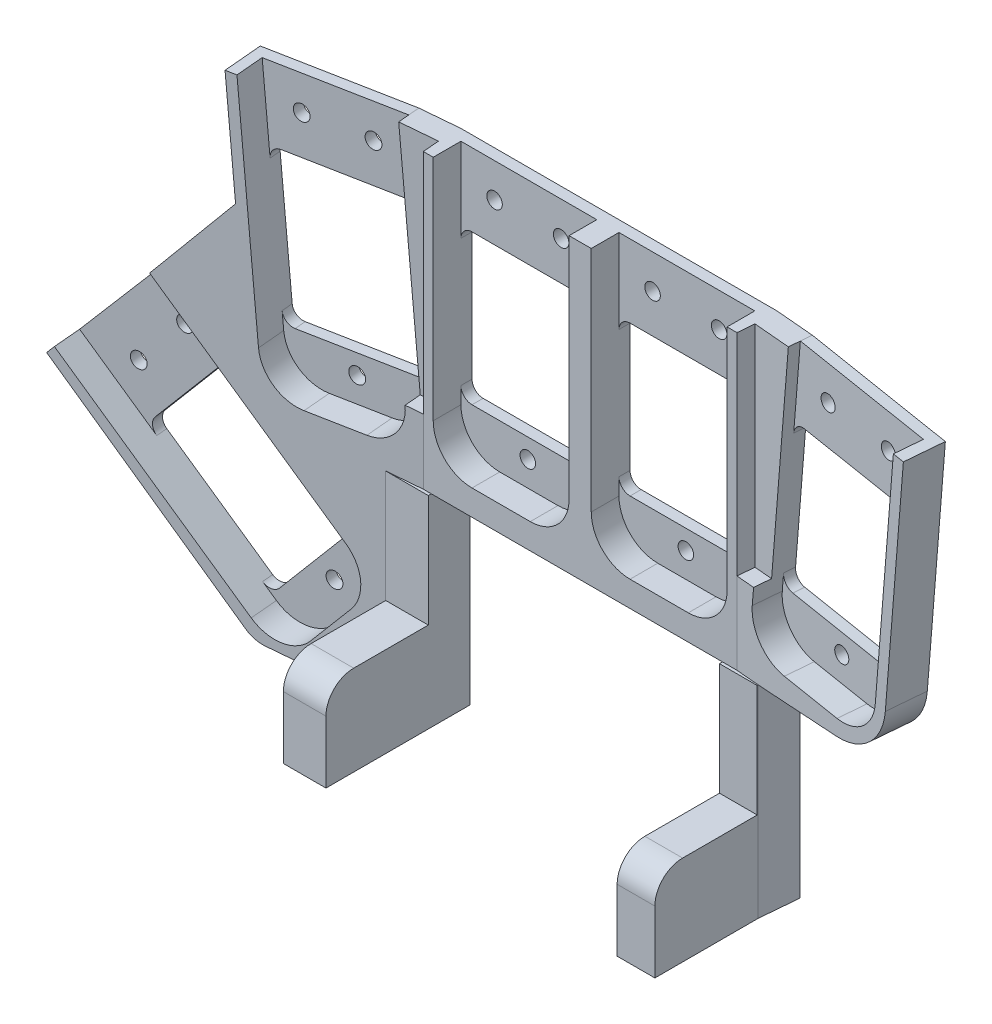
ISO-10303-21;
HEADER;
FILE_DESCRIPTION(('STEP AP214'),'2;1');
FILE_NAME('part.step','',(''),(''),'','','');
FILE_SCHEMA(('AUTOMOTIVE_DESIGN { 1 0 10303 214 1 1 1 1 }'));
ENDSEC;
DATA;
#1=APPLICATION_CONTEXT('core data for automotive mechanical design processes');
#2=APPLICATION_PROTOCOL_DEFINITION('international standard','automotive_design',2000,#1);
#3=PRODUCT_CONTEXT('',#1,'mechanical');
#4=PRODUCT('Part','Part','',(#3));
#5=PRODUCT_RELATED_PRODUCT_CATEGORY('part','',(#4));
#6=PRODUCT_DEFINITION_FORMATION('','',#4);
#7=PRODUCT_DEFINITION_CONTEXT('part definition',#1,'design');
#8=PRODUCT_DEFINITION('design','',#6,#7);
#9=PRODUCT_DEFINITION_SHAPE('','',#8);
#10=(LENGTH_UNIT() NAMED_UNIT(*) SI_UNIT(.MILLI.,.METRE.));
#11=(NAMED_UNIT(*) PLANE_ANGLE_UNIT() SI_UNIT($,.RADIAN.));
#12=(NAMED_UNIT(*) SI_UNIT($,.STERADIAN.) SOLID_ANGLE_UNIT());
#13=UNCERTAINTY_MEASURE_WITH_UNIT(LENGTH_MEASURE(1.E-05),#10,'distance_accuracy_value','');
#14=(GEOMETRIC_REPRESENTATION_CONTEXT(3) GLOBAL_UNCERTAINTY_ASSIGNED_CONTEXT((#13)) GLOBAL_UNIT_ASSIGNED_CONTEXT((#10,
#11,#12)) REPRESENTATION_CONTEXT('',''));
#15=CARTESIAN_POINT('',(0.,0.,0.));
#16=DIRECTION('',(0.,0.,1.));
#17=DIRECTION('',(1.,0.,0.));
#18=AXIS2_PLACEMENT_3D('',#15,#16,#17);
#19=CARTESIAN_POINT('',(21.3541272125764,-62.4789433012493,26.));
#20=DIRECTION('',(0.,1.,0.));
#21=DIRECTION('',(0.,0.,1.));
#22=AXIS2_PLACEMENT_3D('',#19,#20,#21);
#23=PLANE('',#22);
#24=CARTESIAN_POINT('',(-35.9516177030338,-62.4789433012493,3.));
#25=DIRECTION('',(0.,-1.,0.));
#26=DIRECTION('',(0.,0.,-1.));
#27=AXIS2_PLACEMENT_3D('',#24,#25,#26);
#28=CIRCLE('',#27,1.39999999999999);
#29=CARTESIAN_POINT('',(-35.9516177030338,-62.4789433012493,1.60000000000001));
#30=VERTEX_POINT('',#29);
#31=EDGE_CURVE('E1462',#30,#30,#28,.T.);
#32=ORIENTED_EDGE('',*,*,#31,.F.);
#33=EDGE_LOOP('',(#32));
#34=FACE_BOUND('',#33,.T.);
#35=CARTESIAN_POINT('',(-35.9516177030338,-62.4789433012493,21.));
#36=DIRECTION('',(0.,-1.,0.));
#37=DIRECTION('',(0.,0.,-1.));
#38=AXIS2_PLACEMENT_3D('',#35,#36,#37);
#39=CIRCLE('',#38,1.4);
#40=CARTESIAN_POINT('',(-35.9516177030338,-62.4789433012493,19.6));
#41=VERTEX_POINT('',#40);
#42=EDGE_CURVE('E1449',#41,#41,#39,.T.);
#43=ORIENTED_EDGE('',*,*,#42,.F.);
#44=EDGE_LOOP('',(#43));
#45=FACE_BOUND('',#44,.T.);
#46=DIRECTION('',(-0.996194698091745,0.,0.0871557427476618));
#47=VECTOR('',#46,1.);
#48=CARTESIAN_POINT('',(0.360143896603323,-62.4789433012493,4.11646357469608));
#49=LINE('',#48,#47);
#50=CARTESIAN_POINT('',(-38.8371613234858,-62.4789433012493,7.54578342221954));
#51=VERTEX_POINT('',#50);
#52=CARTESIAN_POINT('',(-58.829981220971,-62.4789433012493,9.2949285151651));
#53=VERTEX_POINT('',#52);
#54=EDGE_CURVE('E1568',#51,#53,#49,.T.);
#55=ORIENTED_EDGE('',*,*,#54,.T.);
#56=DIRECTION('',(0.0871557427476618,0.,0.996194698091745));
#57=VECTOR('',#56,1.);
#58=CARTESIAN_POINT('',(-56.770490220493,-62.4789433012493,32.8350183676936));
#59=LINE('',#58,#57);
#60=CARTESIAN_POINT('',(-59.4394081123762,-62.4789433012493,2.32914727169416));
#61=VERTEX_POINT('',#60);
#62=EDGE_CURVE('E1411',#53,#61,#59,.F.);
#63=ORIENTED_EDGE('',*,*,#62,.T.);
#64=DIRECTION('',(0.996194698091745,0.,-0.0871557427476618));
#65=VECTOR('',#64,1.);
#66=CARTESIAN_POINT('',(-32.8171329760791,-62.4789433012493,0.));
#67=LINE('',#66,#65);
#68=CARTESIAN_POINT('',(-32.8171329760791,-62.4789433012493,0.));
#69=VERTEX_POINT('',#68);
#70=EDGE_CURVE('E1567',#61,#69,#67,.T.);
#71=ORIENTED_EDGE('',*,*,#70,.T.);
#72=DIRECTION('',(-1.,0.,0.));
#73=VECTOR('',#72,1.);
#74=CARTESIAN_POINT('',(0.,-62.4789433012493,0.));
#75=LINE('',#74,#73);
#76=CARTESIAN_POINT('',(-31.1575224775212,-62.4789433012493,0.));
#77=VERTEX_POINT('',#76);
#78=EDGE_CURVE('E1563',#77,#69,#75,.T.);
#79=ORIENTED_EDGE('',*,*,#78,.F.);
#80=DIRECTION('',(0.,0.,-1.));
#81=VECTOR('',#80,1.);
#82=CARTESIAN_POINT('',(-31.1575224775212,-62.4789433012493,26.));
#83=LINE('',#82,#81);
#84=CARTESIAN_POINT('',(-31.1575224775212,-62.4789433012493,26.));
#85=VERTEX_POINT('',#84);
#86=EDGE_CURVE('E728',#85,#77,#83,.T.);
#87=ORIENTED_EDGE('',*,*,#86,.F.);
#88=DIRECTION('',(1.,0.,0.));
#89=VECTOR('',#88,1.);
#90=CARTESIAN_POINT('',(-38.8371613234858,-62.4789433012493,26.));
#91=LINE('',#90,#89);
#92=CARTESIAN_POINT('',(-38.8371613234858,-62.4789433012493,26.));
#93=VERTEX_POINT('',#92);
#94=EDGE_CURVE('E739',#93,#85,#91,.T.);
#95=ORIENTED_EDGE('',*,*,#94,.F.);
#96=DIRECTION('',(0.,0.,-1.));
#97=VECTOR('',#96,1.);
#98=CARTESIAN_POINT('',(-38.8371613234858,-62.4789433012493,26.));
#99=LINE('',#98,#97);
#100=EDGE_CURVE('E725',#93,#51,#99,.T.);
#101=ORIENTED_EDGE('',*,*,#100,.T.);
#102=EDGE_LOOP('',(#55,#63,#71,#79,#87,#95,#101));
#103=FACE_BOUND('',#102,.T.);
#104=ADVANCED_FACE('F49',(#34,#45,#103),#23,.F.);
#105=CARTESIAN_POINT('',(0.360143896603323,0.,4.11646357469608));
#106=DIRECTION('',(0.0871557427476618,0.,0.996194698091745));
#107=DIRECTION('',(0.996194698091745,0.,-0.0871557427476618));
#108=AXIS2_PLACEMENT_3D('',#105,#106,#107);
#109=PLANE('',#108);
#110=DIRECTION('',(-0.759629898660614,0.64695101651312,0.066459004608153));
#111=VECTOR('',#110,1.);
#112=CARTESIAN_POINT('',(-95.067021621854,-33.1741908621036,12.4652587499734));
#113=LINE('',#112,#111);
#114=CARTESIAN_POINT('',(-62.0524270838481,-61.2916011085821,9.57685599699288));
#115=VERTEX_POINT('',#114);
#116=CARTESIAN_POINT('',(-95.067021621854,-33.1741908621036,12.4652587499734));
#117=VERTEX_POINT('',#116);
#118=EDGE_CURVE('E747',#115,#117,#113,.T.);
#119=ORIENTED_EDGE('',*,*,#118,.F.);
#120=CARTESIAN_POINT('',(-58.8299812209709,-57.4789433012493,9.2949285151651));
#121=DIRECTION('',(0.0871557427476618,0.,0.996194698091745));
#122=DIRECTION('',(0.996194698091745,0.,-0.0871557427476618));
#123=AXIS2_PLACEMENT_3D('',#120,#121,#122);
#124=CIRCLE('',#123,5.);
#125=EDGE_CURVE('E1409',#115,#53,#124,.T.);
#126=ORIENTED_EDGE('',*,*,#125,.T.);
#127=ORIENTED_EDGE('',*,*,#54,.F.);
#128=DIRECTION('',(0.,1.,0.));
#129=VECTOR('',#128,1.);
#130=CARTESIAN_POINT('',(-38.8371613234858,0.,7.54578342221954));
#131=LINE('',#130,#129);
#132=CARTESIAN_POINT('',(-38.8371613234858,-46.2459803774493,7.54578342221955));
#133=VERTEX_POINT('',#132);
#134=EDGE_CURVE('E1382',#51,#133,#131,.T.);
#135=ORIENTED_EDGE('',*,*,#134,.T.);
#136=DIRECTION('',(0.,-1.,0.));
#137=VECTOR('',#136,1.);
#138=CARTESIAN_POINT('',(-38.8371613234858,-26.0179314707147,7.54578342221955));
#139=LINE('',#138,#137);
#140=CARTESIAN_POINT('',(-38.8371613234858,-26.0179314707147,7.54578342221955));
#141=VERTEX_POINT('',#140);
#142=EDGE_CURVE('E1620',#141,#133,#139,.T.);
#143=ORIENTED_EDGE('',*,*,#142,.F.);
#144=DIRECTION('',(0.996194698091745,0.,-0.0871557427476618));
#145=VECTOR('',#144,1.);
#146=CARTESIAN_POINT('',(0.360143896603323,-26.0179314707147,4.11646357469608));
#147=LINE('',#146,#145);
#148=CARTESIAN_POINT('',(-32.5988282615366,-26.0179314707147,7.));
#149=VERTEX_POINT('',#148);
#150=EDGE_CURVE('E716',#141,#149,#147,.T.);
#151=ORIENTED_EDGE('',*,*,#150,.T.);
#152=DIRECTION('',(0.,1.,0.));
#153=VECTOR('',#152,1.);
#154=CARTESIAN_POINT('',(-32.5988282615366,-14.4359614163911,7.));
#155=LINE('',#154,#153);
#156=CARTESIAN_POINT('',(-32.5988282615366,-14.2793508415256,7.));
#157=VERTEX_POINT('',#156);
#158=EDGE_CURVE('E1352',#149,#157,#155,.T.);
#159=ORIENTED_EDGE('',*,*,#158,.T.);
#160=DIRECTION('',(0.996194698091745,0.,-0.0871557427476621));
#161=VECTOR('',#160,1.);
#162=CARTESIAN_POINT('',(-35.6180275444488,-14.2793508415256,7.26414571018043));
#163=LINE('',#162,#161);
#164=CARTESIAN_POINT('',(-35.6180275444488,-14.2793508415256,7.26414571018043));
#165=VERTEX_POINT('',#164);
#166=EDGE_CURVE('E1503',#165,#157,#163,.T.);
#167=ORIENTED_EDGE('',*,*,#166,.F.);
#168=CARTESIAN_POINT('',(-42.564854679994,-14.8894410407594,7.87191433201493));
#169=DIRECTION('',(0.0871557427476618,0.,0.996194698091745));
#170=DIRECTION('',(0.996194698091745,0.,-0.0871557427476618));
#171=AXIS2_PLACEMENT_3D('',#168,#169,#170);
#172=CIRCLE('',#171,7.00000000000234);
#173=CARTESIAN_POINT('',(-41.9570860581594,-21.8628039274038,7.81874146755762));
#174=VERTEX_POINT('',#173);
#175=EDGE_CURVE('E983',#174,#165,#172,.T.);
#176=ORIENTED_EDGE('',*,*,#175,.F.);
#177=DIRECTION('',(0.992403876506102,0.0871557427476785,-0.0868240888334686));
#178=VECTOR('',#177,1.);
#179=CARTESIAN_POINT('',(1.92969172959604,-18.0085417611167,3.97914593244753));
#180=LINE('',#179,#178);
#181=CARTESIAN_POINT('',(-52.3773267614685,-22.777939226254,8.73039440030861));
#182=VERTEX_POINT('',#181);
#183=EDGE_CURVE('E986',#182,#174,#180,.T.);
#184=ORIENTED_EDGE('',*,*,#183,.F.);
#185=CARTESIAN_POINT('',(-52.9850953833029,-15.8045763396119,8.7835672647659));
#186=DIRECTION('',(0.0871557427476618,0.,0.996194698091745));
#187=DIRECTION('',(0.996194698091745,0.,-0.0871557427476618));
#188=AXIS2_PLACEMENT_3D('',#185,#186,#187);
#189=CIRCLE('',#188,7.);
#190=CARTESIAN_POINT('',(-59.9319225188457,-16.4146665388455,9.39133588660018));
#191=VERTEX_POINT('',#190);
#192=EDGE_CURVE('E990',#191,#182,#189,.T.);
#193=ORIENTED_EDGE('',*,*,#192,.F.);
#194=DIRECTION('',(0.0868240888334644,-0.996194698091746,-0.00759612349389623));
#195=VECTOR('',#194,1.);
#196=CARTESIAN_POINT('',(-60.8937017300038,-5.37948766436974,9.47548066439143));
#197=LINE('',#196,#195);
#198=CARTESIAN_POINT('',(-63.5052448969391,24.5846097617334,9.70396108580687));
#199=VERTEX_POINT('',#198);
#200=EDGE_CURVE('E993',#199,#191,#197,.T.);
#201=ORIENTED_EDGE('',*,*,#200,.F.);
#202=DIRECTION('',(0.992403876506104,0.0871557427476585,-0.0868240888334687));
#203=VECTOR('',#202,1.);
#204=CARTESIAN_POINT('',(-2.25139927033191,29.9640974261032,4.34494399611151));
#205=LINE('',#204,#203);
#206=CARTESIAN_POINT('',(-65.4824998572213,24.4109615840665,9.87694847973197));
#207=VERTEX_POINT('',#206);
#208=EDGE_CURVE('E1547',#207,#199,#205,.T.);
#209=ORIENTED_EDGE('',*,*,#208,.F.);
#210=DIRECTION('',(-0.0868240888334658,0.996194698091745,0.00759612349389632));
#211=VECTOR('',#210,1.);
#212=CARTESIAN_POINT('',(-65.683739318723,26.7199254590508,9.89455465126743));
#213=LINE('',#212,#211);
#214=CARTESIAN_POINT('',(-63.7339352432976,4.34843261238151,9.72396889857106));
#215=VERTEX_POINT('',#214);
#216=EDGE_CURVE('E744',#215,#207,#213,.T.);
#217=ORIENTED_EDGE('',*,*,#216,.F.);
#218=DIRECTION('',(0.634574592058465,0.770864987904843,-0.0555180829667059));
#219=VECTOR('',#218,1.);
#220=CARTESIAN_POINT('',(-77.9878242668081,-12.966827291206,10.9710225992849));
#221=LINE('',#220,#219);
#222=CARTESIAN_POINT('',(-77.9878242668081,-12.966827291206,10.9710225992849));
#223=VERTEX_POINT('',#222);
#224=EDGE_CURVE('E719',#223,#215,#221,.T.);
#225=ORIENTED_EDGE('',*,*,#224,.F.);
#226=DIRECTION('',(0.763129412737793,-0.642787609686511,-0.0667651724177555));
#227=VECTOR('',#226,1.);
#228=CARTESIAN_POINT('',(-38.3719687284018,-46.3354547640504,7.50508434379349));
#229=LINE('',#228,#227);
#230=CARTESIAN_POINT('',(-45.4554921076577,-40.3689686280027,8.12481233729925));
#231=VERTEX_POINT('',#230);
#232=EDGE_CURVE('E837',#223,#231,#229,.T.);
#233=ORIENTED_EDGE('',*,*,#232,.T.);
#234=CARTESIAN_POINT('',(-49.9378833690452,-45.7312797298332,8.51697075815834));
#235=DIRECTION('',(0.0871557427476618,0.,0.996194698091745));
#236=DIRECTION('',(0.996194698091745,0.,-0.0871557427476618));
#237=AXIS2_PLACEMENT_3D('',#234,#235,#236);
#238=CIRCLE('',#237,7.0000000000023);
#239=CARTESIAN_POINT('',(-44.5959774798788,-50.2307929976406,8.0496145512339));
#240=VERTEX_POINT('',#239);
#241=EDGE_CURVE('E870',#240,#231,#238,.T.);
#242=ORIENTED_EDGE('',*,*,#241,.F.);
#243=DIRECTION('',(0.640341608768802,0.766044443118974,-0.0560226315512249));
#244=VECTOR('',#243,1.);
#245=CARTESIAN_POINT('',(-1.38147359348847,1.46697286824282,4.2688353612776));
#246=LINE('',#245,#244);
#247=CARTESIAN_POINT('',(-51.319564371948,-58.274259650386,8.63785218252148));
#248=VERTEX_POINT('',#247);
#249=EDGE_CURVE('E867',#248,#240,#246,.T.);
#250=ORIENTED_EDGE('',*,*,#249,.F.);
#251=CARTESIAN_POINT('',(-56.6614702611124,-53.7747463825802,9.10520838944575));
#252=DIRECTION('',(0.0871557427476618,0.,0.996194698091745));
#253=DIRECTION('',(0.996194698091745,0.,-0.0871557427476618));
#254=AXIS2_PLACEMENT_3D('',#251,#252,#253);
#255=CIRCLE('',#254,7.00000000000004);
#256=CARTESIAN_POINT('',(-61.143861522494,-59.1370574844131,9.49736681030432));
#257=VERTEX_POINT('',#256);
#258=EDGE_CURVE('E864',#257,#248,#255,.T.);
#259=ORIENTED_EDGE('',*,*,#258,.F.);
#260=DIRECTION('',(0.763129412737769,-0.64278760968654,-0.0667651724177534));
#261=VECTOR('',#260,1.);
#262=CARTESIAN_POINT('',(-54.0603381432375,-65.103543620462,8.87763881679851));
#263=LINE('',#262,#261);
#264=CARTESIAN_POINT('',(-93.7780432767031,-31.6491277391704,12.3524877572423));
#265=VERTEX_POINT('',#264);
#266=EDGE_CURVE('E861',#265,#257,#263,.T.);
#267=ORIENTED_EDGE('',*,*,#266,.F.);
#268=DIRECTION('',(0.644489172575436,0.762531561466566,-0.0563854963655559));
#269=VECTOR('',#268,1.);
#270=CARTESIAN_POINT('',(-77.9878242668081,-12.966827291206,10.9710225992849));
#271=LINE('',#270,#269);
#272=EDGE_CURVE('E749',#117,#265,#271,.T.);
#273=ORIENTED_EDGE('',*,*,#272,.F.);
#274=EDGE_LOOP('',(#119,#126,#127,#135,#143,#151,#159,#167,#176,#184,#193,#201,#209,#217,#225,
#233,#242,#250,#259,#267,#273));
#275=FACE_BOUND('',#274,.T.);
#276=ADVANCED_FACE('F1634',(#275),#109,.T.);
#277=CARTESIAN_POINT('',(4.68286702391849,-14.4359614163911,7.));
#278=DIRECTION('',(0.,0.,1.));
#279=DIRECTION('',(1.,0.,0.));
#280=AXIS2_PLACEMENT_3D('',#277,#278,#279);
#281=PLANE('',#280);
#282=DIRECTION('',(-1.,0.,0.));
#283=VECTOR('',#282,1.);
#284=CARTESIAN_POINT('',(-31.1575224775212,-26.0179314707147,7.));
#285=LINE('',#284,#283);
#286=CARTESIAN_POINT('',(21.3541272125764,-26.0179314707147,7.));
#287=VERTEX_POINT('',#286);
#288=CARTESIAN_POINT('',(-31.1575224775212,-26.0179314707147,7.));
#289=VERTEX_POINT('',#288);
#290=EDGE_CURVE('E1470',#287,#289,#285,.T.);
#291=ORIENTED_EDGE('',*,*,#290,.F.);
#292=DIRECTION('',(-1.,0.,0.));
#293=VECTOR('',#292,1.);
#294=CARTESIAN_POINT('',(28.1628386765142,-26.0179314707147,7.));
#295=LINE('',#294,#293);
#296=CARTESIAN_POINT('',(23.9645623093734,-26.0179314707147,7.));
#297=VERTEX_POINT('',#296);
#298=EDGE_CURVE('E736',#297,#287,#295,.T.);
#299=ORIENTED_EDGE('',*,*,#298,.F.);
#300=DIRECTION('',(0.,-1.,0.));
#301=VECTOR('',#300,1.);
#302=CARTESIAN_POINT('',(23.9645623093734,-14.4359614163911,7.));
#303=LINE('',#302,#301);
#304=CARTESIAN_POINT('',(23.9645623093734,-11.290766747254,7.));
#305=VERTEX_POINT('',#304);
#306=EDGE_CURVE('E1359',#305,#297,#303,.T.);
#307=ORIENTED_EDGE('',*,*,#306,.F.);
#308=CARTESIAN_POINT('',(23.9645623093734,26.7199254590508,7.));
#309=VERTEX_POINT('',#308);
#310=EDGE_CURVE('E1360',#309,#305,#303,.T.);
#311=ORIENTED_EDGE('',*,*,#310,.F.);
#312=DIRECTION('',(-1.,0.,0.));
#313=VECTOR('',#312,1.);
#314=CARTESIAN_POINT('',(22.1828670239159,26.7199254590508,7.));
#315=LINE('',#314,#313);
#316=CARTESIAN_POINT('',(22.1828670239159,26.7199254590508,7.));
#317=VERTEX_POINT('',#316);
#318=EDGE_CURVE('E1112',#309,#317,#315,.T.);
#319=ORIENTED_EDGE('',*,*,#318,.T.);
#320=DIRECTION('',(0.,-1.,0.));
#321=VECTOR('',#320,1.);
#322=CARTESIAN_POINT('',(22.1828670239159,11.5640385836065,7.));
#323=LINE('',#322,#321);
#324=CARTESIAN_POINT('',(22.182867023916,-14.4359614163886,7.));
#325=VERTEX_POINT('',#324);
#326=EDGE_CURVE('E1114',#317,#325,#323,.T.);
#327=ORIENTED_EDGE('',*,*,#326,.T.);
#328=CARTESIAN_POINT('',(15.1828670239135,-14.4359614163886,7.));
#329=DIRECTION('',(0.,0.,-1.));
#330=DIRECTION('',(1.,0.,0.));
#331=AXIS2_PLACEMENT_3D('',#328,#329,#330);
#332=CIRCLE('',#331,7.0000000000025);
#333=CARTESIAN_POINT('',(15.1828670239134,-21.4359614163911,7.));
#334=VERTEX_POINT('',#333);
#335=EDGE_CURVE('E1116',#325,#334,#332,.T.);
#336=ORIENTED_EDGE('',*,*,#335,.T.);
#337=DIRECTION('',(-1.,0.,0.));
#338=VECTOR('',#337,1.);
#339=CARTESIAN_POINT('',(4.68286702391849,-21.4359614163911,7.));
#340=LINE('',#339,#338);
#341=CARTESIAN_POINT('',(4.68286702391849,-21.4359614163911,7.));
#342=VERTEX_POINT('',#341);
#343=EDGE_CURVE('E1118',#334,#342,#340,.T.);
#344=ORIENTED_EDGE('',*,*,#343,.T.);
#345=CARTESIAN_POINT('',(4.68286702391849,-14.4359614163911,7.));
#346=DIRECTION('',(0.,0.,-1.));
#347=DIRECTION('',(1.,0.,0.));
#348=AXIS2_PLACEMENT_3D('',#345,#346,#347);
#349=CIRCLE('',#348,7.00000000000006);
#350=CARTESIAN_POINT('',(-2.31713297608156,-14.4359614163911,7.));
#351=VERTEX_POINT('',#350);
#352=EDGE_CURVE('E1091',#342,#351,#349,.T.);
#353=ORIENTED_EDGE('',*,*,#352,.T.);
#354=DIRECTION('',(0.,1.,0.));
#355=VECTOR('',#354,1.);
#356=CARTESIAN_POINT('',(-2.31713297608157,-11.4359614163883,7.));
#357=LINE('',#356,#355);
#358=CARTESIAN_POINT('',(-2.31713297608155,26.7199254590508,7.));
#359=VERTEX_POINT('',#358);
#360=EDGE_CURVE('E1094',#351,#359,#357,.T.);
#361=ORIENTED_EDGE('',*,*,#360,.T.);
#362=DIRECTION('',(-1.,0.,0.));
#363=VECTOR('',#362,1.);
#364=CARTESIAN_POINT('',(-6.31713297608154,26.7199254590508,7.));
#365=LINE('',#364,#363);
#366=CARTESIAN_POINT('',(-6.31713297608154,26.7199254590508,7.));
#367=VERTEX_POINT('',#366);
#368=EDGE_CURVE('E1097',#359,#367,#365,.T.);
#369=ORIENTED_EDGE('',*,*,#368,.T.);
#370=DIRECTION('',(0.,-1.,0.));
#371=VECTOR('',#370,1.);
#372=CARTESIAN_POINT('',(-6.31713297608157,11.5640385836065,7.));
#373=LINE('',#372,#371);
#374=CARTESIAN_POINT('',(-6.31713297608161,-14.4359614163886,7.));
#375=VERTEX_POINT('',#374);
#376=EDGE_CURVE('E1099',#367,#375,#373,.T.);
#377=ORIENTED_EDGE('',*,*,#376,.T.);
#378=CARTESIAN_POINT('',(-13.3171329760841,-14.4359614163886,7.));
#379=DIRECTION('',(0.,0.,-1.));
#380=DIRECTION('',(1.,0.,0.));
#381=AXIS2_PLACEMENT_3D('',#378,#379,#380);
#382=CIRCLE('',#381,7.0000000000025);
#383=CARTESIAN_POINT('',(-13.3171329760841,-21.4359614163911,7.));
#384=VERTEX_POINT('',#383);
#385=EDGE_CURVE('E1101',#375,#384,#382,.T.);
#386=ORIENTED_EDGE('',*,*,#385,.T.);
#387=DIRECTION('',(-1.,0.,0.));
#388=VECTOR('',#387,1.);
#389=CARTESIAN_POINT('',(-23.8171329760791,-21.4359614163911,7.));
#390=LINE('',#389,#388);
#391=CARTESIAN_POINT('',(-23.8171329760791,-21.4359614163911,7.));
#392=VERTEX_POINT('',#391);
#393=EDGE_CURVE('E1103',#384,#392,#390,.T.);
#394=ORIENTED_EDGE('',*,*,#393,.T.);
#395=CARTESIAN_POINT('',(-23.8171329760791,-14.4359614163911,7.));
#396=DIRECTION('',(0.,0.,-1.));
#397=DIRECTION('',(1.,0.,0.));
#398=AXIS2_PLACEMENT_3D('',#395,#396,#397);
#399=CIRCLE('',#398,7.00000000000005);
#400=CARTESIAN_POINT('',(-30.8171329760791,-14.4359614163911,7.));
#401=VERTEX_POINT('',#400);
#402=EDGE_CURVE('E1105',#392,#401,#399,.T.);
#403=ORIENTED_EDGE('',*,*,#402,.T.);
#404=DIRECTION('',(0.,1.,0.));
#405=VECTOR('',#404,1.);
#406=CARTESIAN_POINT('',(-30.8171329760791,-11.4359614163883,7.));
#407=LINE('',#406,#405);
#408=CARTESIAN_POINT('',(-30.8171329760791,26.7199254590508,7.));
#409=VERTEX_POINT('',#408);
#410=EDGE_CURVE('E1107',#401,#409,#407,.T.);
#411=ORIENTED_EDGE('',*,*,#410,.T.);
#412=DIRECTION('',(-1.,0.,0.));
#413=VECTOR('',#412,1.);
#414=CARTESIAN_POINT('',(-30.8171329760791,26.7199254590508,7.));
#415=LINE('',#414,#413);
#416=CARTESIAN_POINT('',(-32.5988282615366,26.7199254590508,7.));
#417=VERTEX_POINT('',#416);
#418=EDGE_CURVE('E1109',#409,#417,#415,.T.);
#419=ORIENTED_EDGE('',*,*,#418,.T.);
#420=DIRECTION('',(0.,1.,0.));
#421=VECTOR('',#420,1.);
#422=CARTESIAN_POINT('',(-32.5988282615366,26.7199254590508,7.));
#423=LINE('',#422,#421);
#424=EDGE_CURVE('E1510',#157,#417,#423,.T.);
#425=ORIENTED_EDGE('',*,*,#424,.F.);
#426=ORIENTED_EDGE('',*,*,#158,.F.);
#427=DIRECTION('',(-1.,0.,0.));
#428=VECTOR('',#427,1.);
#429=CARTESIAN_POINT('',(-31.1575224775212,-26.0179314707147,7.));
#430=LINE('',#429,#428);
#431=EDGE_CURVE('E734',#289,#149,#430,.T.);
#432=ORIENTED_EDGE('',*,*,#431,.F.);
#433=EDGE_LOOP('',(#291,#299,#307,#311,#319,#327,#336,#344,#353,#361,#369,#377,#386,#394,#403,
#411,#419,#425,#426,#432));
#434=FACE_BOUND('',#433,.T.);
#435=ADVANCED_FACE('F1779',(#434),#281,.T.);
#436=CARTESIAN_POINT('',(-0.425730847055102,0.,4.86612584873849));
#437=DIRECTION('',(-0.087155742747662,0.,0.996194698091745));
#438=DIRECTION('',(0.996194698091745,0.,0.087155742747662));
#439=AXIS2_PLACEMENT_3D('',#436,#437,#438);
#440=PLANE('',#439);
#441=DIRECTION('',(-0.99588585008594,-0.0248989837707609,-0.0871287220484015));
#442=VECTOR('',#441,1.);
#443=CARTESIAN_POINT('',(52.5061115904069,-25.4093047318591,9.49706200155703));
#444=LINE('',#443,#442);
#445=CARTESIAN_POINT('',(43.6060474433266,-25.6318227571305,8.71840728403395));
#446=VERTEX_POINT('',#445);
#447=CARTESIAN_POINT('',(28.1628386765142,-26.0179314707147,7.36730158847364));
#448=VERTEX_POINT('',#447);
#449=EDGE_CURVE('E1553',#446,#448,#444,.T.);
#450=ORIENTED_EDGE('',*,*,#449,.F.);
#451=CARTESIAN_POINT('',(43.3580050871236,-15.6349230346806,8.69670638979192));
#452=DIRECTION('',(-0.087155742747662,0.,0.996194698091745));
#453=DIRECTION('',(0.996194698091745,0.,0.087155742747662));
#454=AXIS2_PLACEMENT_3D('',#451,#452,#453);
#455=CIRCLE('',#454,10.);
#456=CARTESIAN_POINT('',(53.2820438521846,-16.5064804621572,9.56494727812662));
#457=VERTEX_POINT('',#456);
#458=EDGE_CURVE('E1404',#446,#457,#455,.T.);
#459=ORIENTED_EDGE('',*,*,#458,.T.);
#460=DIRECTION('',(-0.0868240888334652,-0.996194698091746,-0.0075961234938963));
#461=VECTOR('',#460,1.);
#462=CARTESIAN_POINT('',(54.3017794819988,-4.80632625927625,9.65416258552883));
#463=LINE('',#462,#461);
#464=CARTESIAN_POINT('',(56.8482339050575,24.4109615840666,9.87694847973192));
#465=VERTEX_POINT('',#464);
#466=EDGE_CURVE('E951',#465,#457,#463,.T.);
#467=ORIENTED_EDGE('',*,*,#466,.F.);
#468=DIRECTION('',(0.992403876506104,-0.0871557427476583,0.086824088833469));
#469=VECTOR('',#468,1.);
#470=CARTESIAN_POINT('',(2.12072357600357,29.2172878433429,5.08891174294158));
#471=LINE('',#470,#469);
#472=CARTESIAN_POINT('',(54.8709789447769,24.5846097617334,9.70396108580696));
#473=VERTEX_POINT('',#472);
#474=EDGE_CURVE('E1534',#473,#465,#471,.T.);
#475=ORIENTED_EDGE('',*,*,#474,.F.);
#476=DIRECTION('',(-0.0868240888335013,-0.996194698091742,-0.00759612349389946));
#477=VECTOR('',#476,1.);
#478=CARTESIAN_POINT('',(52.324524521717,-4.63267808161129,9.48117519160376));
#479=LINE('',#478,#477);
#480=CARTESIAN_POINT('',(51.2976565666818,-16.414666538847,9.39133588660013));
#481=VERTEX_POINT('',#480);
#482=EDGE_CURVE('E939',#473,#481,#479,.T.);
#483=ORIENTED_EDGE('',*,*,#482,.T.);
#484=CARTESIAN_POINT('',(44.3508294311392,-15.8045763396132,8.78356726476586));
#485=DIRECTION('',(-0.087155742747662,0.,0.996194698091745));
#486=DIRECTION('',(0.996194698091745,0.,0.087155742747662));
#487=AXIS2_PLACEMENT_3D('',#484,#485,#486);
#488=CIRCLE('',#487,6.99999999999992);
#489=CARTESIAN_POINT('',(43.7430608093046,-22.7779392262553,8.73039440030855));
#490=VERTEX_POINT('',#489);
#491=EDGE_CURVE('E941',#481,#490,#488,.F.);
#492=ORIENTED_EDGE('',*,*,#491,.T.);
#493=DIRECTION('',(-0.9924038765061,0.0871557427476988,-0.0868240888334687));
#494=VECTOR('',#493,1.);
#495=CARTESIAN_POINT('',(-2.06036742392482,-18.7553513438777,4.72311367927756));
#496=LINE('',#495,#494);
#497=CARTESIAN_POINT('',(33.3228201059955,-21.8628039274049,7.81874146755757));
#498=VERTEX_POINT('',#497);
#499=EDGE_CURVE('E944',#490,#498,#496,.T.);
#500=ORIENTED_EDGE('',*,*,#499,.T.);
#501=CARTESIAN_POINT('',(33.9305887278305,-14.8894410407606,7.87191433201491));
#502=DIRECTION('',(-0.087155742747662,0.,0.996194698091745));
#503=DIRECTION('',(0.996194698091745,0.,0.087155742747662));
#504=AXIS2_PLACEMENT_3D('',#501,#502,#503);
#505=CIRCLE('',#504,7.00000000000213);
#506=CARTESIAN_POINT('',(26.9837615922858,-14.2793508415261,7.26414571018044));
#507=VERTEX_POINT('',#506);
#508=EDGE_CURVE('E946',#498,#507,#505,.F.);
#509=ORIENTED_EDGE('',*,*,#508,.T.);
#510=DIRECTION('',(0.0868240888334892,0.996194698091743,0.0075961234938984));
#511=VECTOR('',#510,1.);
#512=CARTESIAN_POINT('',(28.0106295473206,-2.49736238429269,7.35398501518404));
#513=LINE('',#512,#511);
#514=CARTESIAN_POINT('',(27.2442338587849,-11.290766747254,7.28693408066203));
#515=VERTEX_POINT('',#514);
#516=EDGE_CURVE('E948',#507,#515,#513,.T.);
#517=ORIENTED_EDGE('',*,*,#516,.T.);
#518=DIRECTION('',(0.996194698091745,0.,0.0871557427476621));
#519=VECTOR('',#518,1.);
#520=CARTESIAN_POINT('',(27.2442338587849,-11.290766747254,7.28693408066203));
#521=LINE('',#520,#519);
#522=EDGE_CURVE('E1487',#305,#515,#521,.T.);
#523=ORIENTED_EDGE('',*,*,#522,.F.);
#524=ORIENTED_EDGE('',*,*,#306,.T.);
#525=DIRECTION('',(0.996194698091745,0.,0.087155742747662));
#526=VECTOR('',#525,1.);
#527=CARTESIAN_POINT('',(-0.425730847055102,-26.0179314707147,4.86612584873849));
#528=LINE('',#527,#526);
#529=EDGE_CURVE('E1380',#297,#448,#528,.T.);
#530=ORIENTED_EDGE('',*,*,#529,.T.);
#531=EDGE_LOOP('',(#450,#459,#467,#475,#483,#492,#500,#509,#517,#523,#524,#530));
#532=FACE_BOUND('',#531,.T.);
#533=ADVANCED_FACE('F1862',(#532),#440,.T.);
#534=CARTESIAN_POINT('',(-0.0756348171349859,0.,-0.864509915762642));
#535=DIRECTION('',(0.0871557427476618,0.,0.996194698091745));
#536=DIRECTION('',(0.996194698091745,0.,-0.0871557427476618));
#537=AXIS2_PLACEMENT_3D('',#534,#535,#536);
#538=PLANE('',#537);
#539=CARTESIAN_POINT('',(-49.4613422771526,-39.9726946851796,3.45617962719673));
#540=DIRECTION('',(0.0871557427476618,0.,0.996194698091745));
#541=DIRECTION('',(0.996194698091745,0.,-0.0871557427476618));
#542=AXIS2_PLACEMENT_3D('',#539,#540,#541);
#543=CIRCLE('',#542,2.0000000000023);
#544=CARTESIAN_POINT('',(-47.9350834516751,-41.2582699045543,3.32264928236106));
#545=VERTEX_POINT('',#544);
#546=CARTESIAN_POINT('',(-48.1806590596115,-38.4406057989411,3.34413436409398));
#547=VERTEX_POINT('',#546);
#548=EDGE_CURVE('E768',#545,#547,#543,.T.);
#549=ORIENTED_EDGE('',*,*,#548,.F.);
#550=DIRECTION('',(0.640341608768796,0.766044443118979,-0.0560226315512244));
#551=VECTOR('',#550,1.);
#552=CARTESIAN_POINT('',(-47.9350834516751,-41.2582699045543,3.32264928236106));
#553=LINE('',#552,#551);
#554=CARTESIAN_POINT('',(-61.0620864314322,-56.9621809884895,4.47111322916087));
#555=VERTEX_POINT('',#554);
#556=EDGE_CURVE('E782',#555,#545,#553,.T.);
#557=ORIENTED_EDGE('',*,*,#556,.F.);
#558=CARTESIAN_POINT('',(-62.5883452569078,-55.6766057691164,4.60464357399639));
#559=DIRECTION('',(0.0871557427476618,0.,0.996194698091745));
#560=DIRECTION('',(0.996194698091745,0.,-0.0871557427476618));
#561=AXIS2_PLACEMENT_3D('',#558,#559,#560);
#562=CIRCLE('',#561,2.00000000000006);
#563=CARTESIAN_POINT('',(-63.8690284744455,-57.2086946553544,4.71668883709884));
#564=VERTEX_POINT('',#563);
#565=EDGE_CURVE('E779',#564,#555,#562,.T.);
#566=ORIENTED_EDGE('',*,*,#565,.F.);
#567=DIRECTION('',(0.763129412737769,-0.64278760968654,-0.0667651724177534));
#568=VECTOR('',#567,1.);
#569=CARTESIAN_POINT('',(-54.4961168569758,-65.103543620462,3.89666532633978));
#570=LINE('',#569,#568);
#571=CARTESIAN_POINT('',(-61.5796402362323,-59.1370574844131,4.5163933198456));
#572=VERTEX_POINT('',#571);
#573=EDGE_CURVE('E845',#564,#572,#570,.T.);
#574=ORIENTED_EDGE('',*,*,#573,.T.);
#575=CARTESIAN_POINT('',(-57.0972489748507,-53.7747463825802,4.12423489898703));
#576=DIRECTION('',(0.0871557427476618,0.,0.996194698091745));
#577=DIRECTION('',(0.996194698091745,0.,-0.0871557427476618));
#578=AXIS2_PLACEMENT_3D('',#575,#576,#577);
#579=CIRCLE('',#578,7.00000000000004);
#580=CARTESIAN_POINT('',(-51.7553430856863,-58.274259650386,3.65687869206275));
#581=VERTEX_POINT('',#580);
#582=EDGE_CURVE('E849',#572,#581,#579,.T.);
#583=ORIENTED_EDGE('',*,*,#582,.T.);
#584=DIRECTION('',(0.640341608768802,0.766044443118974,-0.0560226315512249));
#585=VECTOR('',#584,1.);
#586=CARTESIAN_POINT('',(-1.81725230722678,1.46697286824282,-0.712138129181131));
#587=LINE('',#586,#585);
#588=CARTESIAN_POINT('',(-45.0317561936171,-50.2307929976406,3.06864106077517));
#589=VERTEX_POINT('',#588);
#590=EDGE_CURVE('E852',#581,#589,#587,.T.);
#591=ORIENTED_EDGE('',*,*,#590,.T.);
#592=CARTESIAN_POINT('',(-50.3736620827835,-45.7312797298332,3.53599726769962));
#593=DIRECTION('',(0.0871557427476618,0.,0.996194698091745));
#594=DIRECTION('',(0.996194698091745,0.,-0.0871557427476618));
#595=AXIS2_PLACEMENT_3D('',#592,#593,#594);
#596=CIRCLE('',#595,7.0000000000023);
#597=CARTESIAN_POINT('',(-45.891270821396,-40.3689686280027,3.14383884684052));
#598=VERTEX_POINT('',#597);
#599=EDGE_CURVE('E855',#589,#598,#596,.T.);
#600=ORIENTED_EDGE('',*,*,#599,.T.);
#601=DIRECTION('',(0.763129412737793,-0.642787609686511,-0.0667651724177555));
#602=VECTOR('',#601,1.);
#603=CARTESIAN_POINT('',(-38.8077474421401,-46.3354547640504,2.52411085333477));
#604=LINE('',#603,#602);
#605=EDGE_CURVE('E842',#547,#598,#604,.T.);
#606=ORIENTED_EDGE('',*,*,#605,.F.);
#607=EDGE_LOOP('',(#549,#557,#566,#574,#583,#591,#600,#606));
#608=FACE_BOUND('',#607,.T.);
#609=CARTESIAN_POINT('',(-51.9466783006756,-51.5023978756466,3.6736183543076));
#610=DIRECTION('',(0.0871557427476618,0.,0.996194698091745));
#611=DIRECTION('',(0.996194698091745,0.,-0.0871557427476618));
#612=AXIS2_PLACEMENT_3D('',#609,#610,#611);
#613=CIRCLE('',#612,1.39999999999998);
#614=CARTESIAN_POINT('',(-50.5520057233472,-51.5023978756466,3.55160031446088));
#615=VERTEX_POINT('',#614);
#616=EDGE_CURVE('E819',#615,#615,#613,.T.);
#617=ORIENTED_EDGE('',*,*,#616,.F.);
#618=EDGE_LOOP('',(#617));
#619=FACE_BOUND('',#618,.T.);
#620=ADVANCED_FACE('F1705',(#608,#619),#538,.T.);
#621=CARTESIAN_POINT('',(24.182867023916,-77.8094296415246,2.));
#622=DIRECTION('',(-0.087155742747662,0.,0.996194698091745));
#623=DIRECTION('',(0.996194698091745,0.,0.087155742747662));
#624=AXIS2_PLACEMENT_3D('',#621,#622,#623);
#625=PLANE('',#624);
#626=DIRECTION('',(0.992403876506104,-0.0871557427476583,0.086824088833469));
#627=VECTOR('',#626,1.);
#628=CARTESIAN_POINT('',(33.2757269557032,26.5194377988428,2.79552216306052));
#629=LINE('',#628,#627);
#630=CARTESIAN_POINT('',(30.9928626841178,26.7199254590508,2.59579741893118));
#631=VERTEX_POINT('',#630);
#632=CARTESIAN_POINT('',(55.3067576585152,24.5846097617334,4.72298759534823));
#633=VERTEX_POINT('',#632);
#634=EDGE_CURVE('E1532',#631,#633,#629,.T.);
#635=ORIENTED_EDGE('',*,*,#634,.F.);
#636=DIRECTION('',(0.0868240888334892,0.996194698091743,0.0075961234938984));
#637=VECTOR('',#636,1.);
#638=CARTESIAN_POINT('',(28.4464082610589,-2.49736238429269,2.37301152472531));
#639=LINE('',#638,#637);
#640=CARTESIAN_POINT('',(29.6769666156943,11.6217113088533,2.48067143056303));
#641=VERTEX_POINT('',#640);
#642=EDGE_CURVE('E964',#641,#631,#639,.T.);
#643=ORIENTED_EDGE('',*,*,#642,.F.);
#644=CARTESIAN_POINT('',(31.661774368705,11.447399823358,2.65431960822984));
#645=DIRECTION('',(-0.087155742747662,0.,0.996194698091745));
#646=DIRECTION('',(0.996194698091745,0.,0.087155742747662));
#647=AXIS2_PLACEMENT_3D('',#644,#645,#646);
#648=CIRCLE('',#647,1.99999999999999);
#649=CARTESIAN_POINT('',(31.8354225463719,13.4397892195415,2.66951185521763));
#650=VERTEX_POINT('',#649);
#651=EDGE_CURVE('E909',#650,#641,#648,.T.);
#652=ORIENTED_EDGE('',*,*,#651,.F.);
#653=DIRECTION('',(-0.992403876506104,0.0871557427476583,-0.086824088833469));
#654=VECTOR('',#653,1.);
#655=CARTESIAN_POINT('',(31.8354225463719,13.4397892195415,2.66951185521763));
#656=LINE('',#655,#654);
#657=CARTESIAN_POINT('',(52.1797020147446,11.6530964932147,4.44940567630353));
#658=VERTEX_POINT('',#657);
#659=EDGE_CURVE('E906',#658,#650,#656,.T.);
#660=ORIENTED_EDGE('',*,*,#659,.F.);
#661=CARTESIAN_POINT('',(52.0060538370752,9.66070709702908,4.43421342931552));
#662=DIRECTION('',(-0.087155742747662,0.,0.996194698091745));
#663=DIRECTION('',(0.996194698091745,0.,0.087155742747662));
#664=AXIS2_PLACEMENT_3D('',#661,#662,#663);
#665=CIRCLE('',#664,2.00000000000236);
#666=CARTESIAN_POINT('',(53.9908615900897,9.48639561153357,4.60786160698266));
#667=VERTEX_POINT('',#666);
#668=EDGE_CURVE('E903',#667,#658,#665,.T.);
#669=ORIENTED_EDGE('',*,*,#668,.F.);
#670=DIRECTION('',(-0.0868240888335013,-0.996194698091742,-0.00759612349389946));
#671=VECTOR('',#670,1.);
#672=CARTESIAN_POINT('',(52.7603032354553,-4.63267808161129,4.50020170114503));
#673=LINE('',#672,#671);
#674=EDGE_CURVE('E955',#633,#667,#673,.T.);
#675=ORIENTED_EDGE('',*,*,#674,.F.);
#676=EDGE_LOOP('',(#635,#643,#652,#660,#669,#675));
#677=FACE_BOUND('',#676,.T.);
#678=CARTESIAN_POINT('',(48.3852557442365,19.0130744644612,4.11743464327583));
#679=DIRECTION('',(-0.087155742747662,0.,0.996194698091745));
#680=DIRECTION('',(0.996194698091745,0.,0.087155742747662));
#681=AXIS2_PLACEMENT_3D('',#678,#679,#680);
#682=CIRCLE('',#681,1.40000000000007);
#683=CARTESIAN_POINT('',(49.779928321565,19.0130744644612,4.23945268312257));
#684=VERTEX_POINT('',#683);
#685=EDGE_CURVE('E875',#684,#684,#682,.T.);
#686=ORIENTED_EDGE('',*,*,#685,.F.);
#687=EDGE_LOOP('',(#686));
#688=FACE_BOUND('',#687,.T.);
#689=CARTESIAN_POINT('',(36.4764092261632,20.0589433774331,3.07554557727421));
#690=DIRECTION('',(-0.087155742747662,0.,0.996194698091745));
#691=DIRECTION('',(0.996194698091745,0.,0.087155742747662));
#692=AXIS2_PLACEMENT_3D('',#689,#690,#691);
#693=CIRCLE('',#692,1.40000000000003);
#694=CARTESIAN_POINT('',(37.8710818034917,20.0589433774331,3.19756361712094));
#695=VERTEX_POINT('',#694);
#696=EDGE_CURVE('E890',#695,#695,#693,.T.);
#697=ORIENTED_EDGE('',*,*,#696,.F.);
#698=EDGE_LOOP('',(#697));
#699=FACE_BOUND('',#698,.T.);
#700=ADVANCED_FACE('F2645',(#677,#688,#699),#625,.T.);
#701=CARTESIAN_POINT('',(39.1749291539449,-17.8212922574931,3.31163547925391));
#702=DIRECTION('',(-0.087155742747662,0.,0.996194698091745));
#703=DIRECTION('',(0.996194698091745,0.,0.087155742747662));
#704=AXIS2_PLACEMENT_3D('',#701,#702,#703);
#705=CIRCLE('',#704,1.39999999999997);
#706=CARTESIAN_POINT('',(40.5696017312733,-17.8212922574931,3.43365351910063));
#707=VERTEX_POINT('',#706);
#708=EDGE_CURVE('E886',#707,#707,#705,.T.);
#709=ORIENTED_EDGE('',*,*,#708,.F.);
#710=EDGE_LOOP('',(#709));
#711=FACE_BOUND('',#710,.T.);
#712=CARTESIAN_POINT('',(29.6648203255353,-11.4650782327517,2.47960876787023));
#713=DIRECTION('',(-0.087155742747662,0.,0.996194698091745));
#714=DIRECTION('',(0.996194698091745,0.,0.087155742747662));
#715=AXIS2_PLACEMENT_3D('',#712,#713,#714);
#716=CIRCLE('',#715,2.00000000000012);
#717=CARTESIAN_POINT('',(27.6800125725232,-11.290766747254,2.3059605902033));
#718=VERTEX_POINT('',#717);
#719=CARTESIAN_POINT('',(29.4911721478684,-13.4574676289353,2.46441652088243));
#720=VERTEX_POINT('',#719);
#721=EDGE_CURVE('E889',#718,#720,#716,.T.);
#722=ORIENTED_EDGE('',*,*,#721,.F.);
#723=CARTESIAN_POINT('',(27.4195403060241,-14.2793508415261,2.28317221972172));
#724=VERTEX_POINT('',#723);
#725=EDGE_CURVE('E942',#724,#718,#639,.T.);
#726=ORIENTED_EDGE('',*,*,#725,.F.);
#727=CARTESIAN_POINT('',(34.3663674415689,-14.8894410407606,2.89094084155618));
#728=DIRECTION('',(-0.087155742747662,0.,0.996194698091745));
#729=DIRECTION('',(0.996194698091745,0.,0.087155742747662));
#730=AXIS2_PLACEMENT_3D('',#727,#728,#729);
#731=CIRCLE('',#730,7.00000000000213);
#732=CARTESIAN_POINT('',(33.7585988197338,-21.8628039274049,2.83776797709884));
#733=VERTEX_POINT('',#732);
#734=EDGE_CURVE('E962',#733,#724,#731,.F.);
#735=ORIENTED_EDGE('',*,*,#734,.F.);
#736=DIRECTION('',(-0.9924038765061,0.0871557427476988,-0.0868240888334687));
#737=VECTOR('',#736,1.);
#738=CARTESIAN_POINT('',(-1.62458871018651,-18.7553513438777,-0.257859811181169));
#739=LINE('',#738,#737);
#740=CARTESIAN_POINT('',(44.1788395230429,-22.7779392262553,3.74942090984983));
#741=VERTEX_POINT('',#740);
#742=EDGE_CURVE('E960',#741,#733,#739,.T.);
#743=ORIENTED_EDGE('',*,*,#742,.F.);
#744=CARTESIAN_POINT('',(44.7866081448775,-15.8045763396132,3.80259377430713));
#745=DIRECTION('',(-0.087155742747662,0.,0.996194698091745));
#746=DIRECTION('',(0.996194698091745,0.,0.087155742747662));
#747=AXIS2_PLACEMENT_3D('',#744,#745,#746);
#748=CIRCLE('',#747,6.99999999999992);
#749=CARTESIAN_POINT('',(51.7334352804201,-16.414666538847,4.4103623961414));
#750=VERTEX_POINT('',#749);
#751=EDGE_CURVE('E957',#750,#741,#748,.F.);
#752=ORIENTED_EDGE('',*,*,#751,.F.);
#753=CARTESIAN_POINT('',(51.9939075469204,-13.4260824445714,4.43315076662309));
#754=VERTEX_POINT('',#753);
#755=EDGE_CURVE('E958',#754,#750,#673,.T.);
#756=ORIENTED_EDGE('',*,*,#755,.F.);
#757=CARTESIAN_POINT('',(50.0090997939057,-13.2517709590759,4.25950258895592));
#758=DIRECTION('',(-0.087155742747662,0.,0.996194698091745));
#759=DIRECTION('',(0.996194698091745,0.,0.087155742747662));
#760=AXIS2_PLACEMENT_3D('',#757,#758,#759);
#761=CIRCLE('',#760,2.00000000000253);
#762=CARTESIAN_POINT('',(49.8354516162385,-15.2441603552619,4.24431034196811));
#763=VERTEX_POINT('',#762);
#764=EDGE_CURVE('E900',#763,#754,#761,.T.);
#765=ORIENTED_EDGE('',*,*,#764,.F.);
#766=DIRECTION('',(0.992403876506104,-0.087155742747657,0.086824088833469));
#767=VECTOR('',#766,1.);
#768=CARTESIAN_POINT('',(49.8354516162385,-15.2441603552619,4.24431034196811));
#769=LINE('',#768,#767);
#770=EDGE_CURVE('E897',#720,#763,#769,.T.);
#771=ORIENTED_EDGE('',*,*,#770,.F.);
#772=EDGE_LOOP('',(#722,#726,#735,#743,#752,#756,#765,#771));
#773=FACE_BOUND('',#772,.T.);
#774=ADVANCED_FACE('F1882',(#711,#773),#625,.T.);
#775=CARTESIAN_POINT('',(-32.8171329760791,-63.1865254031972,2.));
#776=DIRECTION('',(0.0871557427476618,0.,0.996194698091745));
#777=DIRECTION('',(0.996194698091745,0.,-0.0871557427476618));
#778=AXIS2_PLACEMENT_3D('',#775,#776,#777);
#779=PLANE('',#778);
#780=DIRECTION('',(0.992403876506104,0.0871557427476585,-0.0868240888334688));
#781=VECTOR('',#780,1.);
#782=CARTESIAN_POINT('',(-40.6452038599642,26.6305151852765,2.68486745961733));
#783=LINE('',#782,#781);
#784=CARTESIAN_POINT('',(-63.9410236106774,24.5846097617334,4.72298759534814));
#785=VERTEX_POINT('',#784);
#786=CARTESIAN_POINT('',(-39.6271286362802,26.7199254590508,2.59579741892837));
#787=VERTEX_POINT('',#786);
#788=EDGE_CURVE('E1544',#785,#787,#783,.T.);
#789=ORIENTED_EDGE('',*,*,#788,.F.);
#790=DIRECTION('',(0.0868240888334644,-0.996194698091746,-0.00759612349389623));
#791=VECTOR('',#790,1.);
#792=CARTESIAN_POINT('',(-61.3294804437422,-5.37948766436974,4.4945071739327));
#793=LINE('',#792,#791);
#794=CARTESIAN_POINT('',(-62.625127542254,9.4863956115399,4.60786160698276));
#795=VERTEX_POINT('',#794);
#796=EDGE_CURVE('E1005',#785,#795,#793,.T.);
#797=ORIENTED_EDGE('',*,*,#796,.T.);
#798=CARTESIAN_POINT('',(-60.6403197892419,9.66070709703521,4.43421342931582));
#799=DIRECTION('',(0.0871557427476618,0.,0.996194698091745));
#800=DIRECTION('',(0.996194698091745,0.,-0.0871557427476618));
#801=AXIS2_PLACEMENT_3D('',#798,#799,#800);
#802=CIRCLE('',#801,1.99999999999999);
#803=CARTESIAN_POINT('',(-60.8139679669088,11.6530964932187,4.44940567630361));
#804=VERTEX_POINT('',#803);
#805=EDGE_CURVE('E1026',#804,#795,#802,.T.);
#806=ORIENTED_EDGE('',*,*,#805,.F.);
#807=DIRECTION('',(0.992403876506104,0.0871557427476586,-0.0868240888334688));
#808=VECTOR('',#807,1.);
#809=CARTESIAN_POINT('',(-1.54493009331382,16.8582726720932,-0.7359632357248));
#810=LINE('',#809,#808);
#811=CARTESIAN_POINT('',(-40.469688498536,13.4397892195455,2.6695118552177));
#812=VERTEX_POINT('',#811);
#813=EDGE_CURVE('E1023',#804,#812,#810,.T.);
#814=ORIENTED_EDGE('',*,*,#813,.T.);
#815=CARTESIAN_POINT('',(-40.2960403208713,11.4473998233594,2.65431960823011));
#816=DIRECTION('',(0.0871557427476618,0.,0.996194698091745));
#817=DIRECTION('',(0.996194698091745,0.,-0.0871557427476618));
#818=AXIS2_PLACEMENT_3D('',#815,#816,#817);
#819=CIRCLE('',#818,2.0000000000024);
#820=CARTESIAN_POINT('',(-38.3112325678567,11.6217113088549,2.48067143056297));
#821=VERTEX_POINT('',#820);
#822=EDGE_CURVE('E1020',#821,#812,#819,.T.);
#823=ORIENTED_EDGE('',*,*,#822,.F.);
#824=DIRECTION('',(-0.0868240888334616,0.996194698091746,0.00759612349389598));
#825=VECTOR('',#824,1.);
#826=CARTESIAN_POINT('',(-37.0155854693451,-3.24417196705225,2.36731699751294));
#827=LINE('',#826,#825);
#828=EDGE_CURVE('E1007',#821,#787,#827,.T.);
#829=ORIENTED_EDGE('',*,*,#828,.T.);
#830=EDGE_LOOP('',(#789,#797,#806,#814,#823,#829));
#831=FACE_BOUND('',#830,.T.);
#832=CARTESIAN_POINT('',(-57.3885185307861,18.9806681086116,4.1497176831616));
#833=DIRECTION('',(0.0871557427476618,0.,0.996194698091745));
#834=DIRECTION('',(0.996194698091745,0.,-0.0871557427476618));
#835=AXIS2_PLACEMENT_3D('',#832,#833,#834);
#836=CIRCLE('',#835,1.40000000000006);
#837=CARTESIAN_POINT('',(-55.9938459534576,18.9806681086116,4.02769964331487));
#838=VERTEX_POINT('',#837);
#839=EDGE_CURVE('E1062',#838,#838,#836,.T.);
#840=ORIENTED_EDGE('',*,*,#839,.F.);
#841=EDGE_LOOP('',(#840));
#842=FACE_BOUND('',#841,.T.);
#843=CARTESIAN_POINT('',(-45.4796720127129,20.0265370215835,3.10782861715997));
#844=DIRECTION('',(0.0871557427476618,0.,0.996194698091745));
#845=DIRECTION('',(0.996194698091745,0.,-0.0871557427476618));
#846=AXIS2_PLACEMENT_3D('',#843,#844,#845);
#847=CIRCLE('',#846,1.40000000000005);
#848=CARTESIAN_POINT('',(-44.0849994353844,20.0265370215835,2.98581057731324));
#849=VERTEX_POINT('',#848);
#850=EDGE_CURVE('E1059',#849,#849,#847,.T.);
#851=ORIENTED_EDGE('',*,*,#850,.F.);
#852=EDGE_LOOP('',(#851));
#853=FACE_BOUND('',#852,.T.);
#854=ADVANCED_FACE('F1754',(#831,#842,#853),#779,.T.);
#855=CARTESIAN_POINT('',(-60.6281734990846,-13.4260824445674,4.43315076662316));
#856=VERTEX_POINT('',#855);
#857=CARTESIAN_POINT('',(-60.367701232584,-16.4146665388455,4.41036239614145));
#858=VERTEX_POINT('',#857);
#859=EDGE_CURVE('E1004',#856,#858,#793,.T.);
#860=ORIENTED_EDGE('',*,*,#859,.T.);
#861=CARTESIAN_POINT('',(-53.4208740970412,-15.8045763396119,3.80259377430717));
#862=DIRECTION('',(0.0871557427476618,0.,0.996194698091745));
#863=DIRECTION('',(0.996194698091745,0.,-0.0871557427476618));
#864=AXIS2_PLACEMENT_3D('',#861,#862,#863);
#865=CIRCLE('',#864,7.);
#866=CARTESIAN_POINT('',(-52.8131054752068,-22.777939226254,3.74942090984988));
#867=VERTEX_POINT('',#866);
#868=EDGE_CURVE('E1001',#858,#867,#865,.T.);
#869=ORIENTED_EDGE('',*,*,#868,.T.);
#870=DIRECTION('',(0.992403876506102,0.0871557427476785,-0.0868240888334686));
#871=VECTOR('',#870,1.);
#872=CARTESIAN_POINT('',(1.49391301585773,-18.0085417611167,-1.00182755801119));
#873=LINE('',#872,#871);
#874=CARTESIAN_POINT('',(-42.3928647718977,-21.8628039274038,2.8377679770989));
#875=VERTEX_POINT('',#874);
#876=EDGE_CURVE('E998',#867,#875,#873,.T.);
#877=ORIENTED_EDGE('',*,*,#876,.T.);
#878=CARTESIAN_POINT('',(-43.0006333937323,-14.8894410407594,2.8909408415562));
#879=DIRECTION('',(0.0871557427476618,0.,0.996194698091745));
#880=DIRECTION('',(0.996194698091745,0.,-0.0871557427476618));
#881=AXIS2_PLACEMENT_3D('',#878,#879,#880);
#882=CIRCLE('',#881,7.00000000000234);
#883=CARTESIAN_POINT('',(-36.0538062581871,-14.2793508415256,2.2831722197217));
#884=VERTEX_POINT('',#883);
#885=EDGE_CURVE('E982',#875,#884,#882,.T.);
#886=ORIENTED_EDGE('',*,*,#885,.T.);
#887=CARTESIAN_POINT('',(-36.3142785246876,-11.29076674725,2.3059605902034));
#888=VERTEX_POINT('',#887);
#889=EDGE_CURVE('E987',#884,#888,#827,.T.);
#890=ORIENTED_EDGE('',*,*,#889,.T.);
#891=CARTESIAN_POINT('',(-38.2990862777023,-11.4650782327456,2.47960876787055));
#892=DIRECTION('',(0.0871557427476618,0.,0.996194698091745));
#893=DIRECTION('',(0.996194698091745,0.,-0.0871557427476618));
#894=AXIS2_PLACEMENT_3D('',#891,#892,#893);
#895=CIRCLE('',#894,2.00000000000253);
#896=CARTESIAN_POINT('',(-38.1254381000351,-13.4574676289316,2.46441652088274));
#897=VERTEX_POINT('',#896);
#898=EDGE_CURVE('E1035',#897,#888,#895,.T.);
#899=ORIENTED_EDGE('',*,*,#898,.F.);
#900=DIRECTION('',(-0.992403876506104,-0.0871557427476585,0.0868240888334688));
#901=VECTOR('',#900,1.);
#902=CARTESIAN_POINT('',(0.799320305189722,-10.0389841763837,-0.941058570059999));
#903=LINE('',#902,#901);
#904=CARTESIAN_POINT('',(-58.4697175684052,-15.2441603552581,4.24431034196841));
#905=VERTEX_POINT('',#904);
#906=EDGE_CURVE('E1032',#897,#905,#903,.T.);
#907=ORIENTED_EDGE('',*,*,#906,.T.);
#908=CARTESIAN_POINT('',(-58.6433657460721,-13.2517709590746,4.2595025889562));
#909=DIRECTION('',(0.0871557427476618,0.,0.996194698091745));
#910=DIRECTION('',(0.996194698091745,0.,-0.0871557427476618));
#911=AXIS2_PLACEMENT_3D('',#908,#909,#910);
#912=CIRCLE('',#911,2.00000000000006);
#913=EDGE_CURVE('E1029',#856,#905,#912,.T.);
#914=ORIENTED_EDGE('',*,*,#913,.F.);
#915=EDGE_LOOP('',(#860,#869,#877,#886,#890,#899,#907,#914));
#916=FACE_BOUND('',#915,.T.);
#917=CARTESIAN_POINT('',(-48.1781919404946,-17.8536986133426,3.34391851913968));
#918=DIRECTION('',(0.0871557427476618,0.,0.996194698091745));
#919=DIRECTION('',(0.996194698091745,0.,-0.0871557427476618));
#920=AXIS2_PLACEMENT_3D('',#917,#918,#919);
#921=CIRCLE('',#920,1.4);
#922=CARTESIAN_POINT('',(-46.7835193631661,-17.8536986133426,3.22190047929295));
#923=VERTEX_POINT('',#922);
#924=EDGE_CURVE('E1042',#923,#923,#921,.T.);
#925=ORIENTED_EDGE('',*,*,#924,.F.);
#926=EDGE_LOOP('',(#925));
#927=FACE_BOUND('',#926,.T.);
#928=ADVANCED_FACE('F1735',(#916,#927),#779,.T.);
#929=CARTESIAN_POINT('',(-32.8171329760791,-63.1865254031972,0.));
#930=DIRECTION('',(-0.0871557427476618,0.,-0.996194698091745));
#931=DIRECTION('',(-0.996194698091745,0.,0.0871557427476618));
#932=AXIS2_PLACEMENT_3D('',#929,#930,#931);
#933=PLANE('',#932);
#934=ORIENTED_EDGE('',*,*,#70,.F.);
#935=CARTESIAN_POINT('',(-59.4394081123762,-57.4789433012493,2.32914727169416));
#936=DIRECTION('',(-0.0871557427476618,0.,-0.996194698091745));
#937=DIRECTION('',(-0.996194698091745,0.,0.0871557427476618));
#938=AXIS2_PLACEMENT_3D('',#935,#936,#937);
#939=CIRCLE('',#938,5.);
#940=CARTESIAN_POINT('',(-62.6618539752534,-61.2916011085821,2.61107475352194));
#941=VERTEX_POINT('',#940);
#942=EDGE_CURVE('E1413',#61,#941,#939,.T.);
#943=ORIENTED_EDGE('',*,*,#942,.T.);
#944=DIRECTION('',(0.759629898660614,-0.64695101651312,-0.066459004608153));
#945=VECTOR('',#944,1.);
#946=CARTESIAN_POINT('',(-44.3772622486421,-76.8639676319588,1.01138026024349));
#947=LINE('',#946,#945);
#948=CARTESIAN_POINT('',(-95.6764485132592,-33.1741908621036,5.49947750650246));
#949=VERTEX_POINT('',#948);
#950=EDGE_CURVE('E763',#949,#941,#947,.T.);
#951=ORIENTED_EDGE('',*,*,#950,.F.);
#952=DIRECTION('',(-0.644489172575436,-0.762531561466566,0.0563854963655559));
#953=VECTOR('',#952,1.);
#954=CARTESIAN_POINT('',(-84.1163192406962,-19.496748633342,4.48809724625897));
#955=LINE('',#954,#953);
#956=CARTESIAN_POINT('',(-78.5972511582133,-12.966827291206,4.00524135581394));
#957=VERTEX_POINT('',#956);
#958=EDGE_CURVE('E755',#957,#949,#955,.T.);
#959=ORIENTED_EDGE('',*,*,#958,.F.);
#960=DIRECTION('',(-0.634574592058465,-0.770864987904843,0.0555180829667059));
#961=VECTOR('',#960,1.);
#962=CARTESIAN_POINT('',(-84.5872189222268,-20.2432869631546,4.52929563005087));
#963=LINE('',#962,#961);
#964=CARTESIAN_POINT('',(-64.3433621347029,4.34843261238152,2.75818765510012));
#965=VERTEX_POINT('',#964);
#966=EDGE_CURVE('E761',#965,#957,#963,.T.);
#967=ORIENTED_EDGE('',*,*,#966,.F.);
#968=DIRECTION('',(0.0868240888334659,-0.996194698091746,-0.00759612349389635));
#969=VECTOR('',#968,1.);
#970=CARTESIAN_POINT('',(-58.2625368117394,-65.4212134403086,2.22618437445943));
#971=LINE('',#970,#969);
#972=CARTESIAN_POINT('',(-66.0919267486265,24.4109615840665,2.91116723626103));
#973=VERTEX_POINT('',#972);
#974=EDGE_CURVE('E766',#973,#965,#971,.T.);
#975=ORIENTED_EDGE('',*,*,#974,.F.);
#976=DIRECTION('',(-0.992403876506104,-0.0871557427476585,0.0868240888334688));
#977=VECTOR('',#976,1.);
#978=CARTESIAN_POINT('',(-40.6465229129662,26.6456496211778,0.684982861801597));
#979=LINE('',#978,#977);
#980=CARTESIAN_POINT('',(-39.8007768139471,26.7199254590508,0.610989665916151));
#981=VERTEX_POINT('',#980);
#982=EDGE_CURVE('E1549',#981,#973,#979,.T.);
#983=ORIENTED_EDGE('',*,*,#982,.F.);
#984=DIRECTION('',(-0.996194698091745,0.,0.0871557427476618));
#985=VECTOR('',#984,1.);
#986=CARTESIAN_POINT('',(-32.8171329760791,26.7199254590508,0.));
#987=LINE('',#986,#985);
#988=CARTESIAN_POINT('',(-32.8171329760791,26.7199254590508,0.));
#989=VERTEX_POINT('',#988);
#990=EDGE_CURVE('E1068',#989,#981,#987,.T.);
#991=ORIENTED_EDGE('',*,*,#990,.F.);
#992=DIRECTION('',(0.,-1.,0.));
#993=VECTOR('',#992,1.);
#994=CARTESIAN_POINT('',(-32.8171329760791,0.,0.));
#995=LINE('',#994,#993);
#996=EDGE_CURVE('E1195',#989,#69,#995,.T.);
#997=ORIENTED_EDGE('',*,*,#996,.T.);
#998=EDGE_LOOP('',(#934,#943,#951,#959,#967,#975,#983,#991,#997));
#999=FACE_BOUND('',#998,.T.);
#1000=CARTESIAN_POINT('',(-49.6349904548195,-39.9726946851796,1.47137187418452));
#1001=DIRECTION('',(-0.0871557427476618,0.,-0.996194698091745));
#1002=DIRECTION('',(-0.996194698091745,0.,0.0871557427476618));
#1003=AXIS2_PLACEMENT_3D('',#1000,#1001,#1002);
#1004=CIRCLE('',#1003,2.0000000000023);
#1005=CARTESIAN_POINT('',(-48.3543072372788,-38.4406057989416,1.3593266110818));
#1006=VERTEX_POINT('',#1005);
#1007=CARTESIAN_POINT('',(-48.1087316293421,-41.2582699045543,1.33784152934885));
#1008=VERTEX_POINT('',#1007);
#1009=EDGE_CURVE('E817',#1006,#1008,#1004,.T.);
#1010=ORIENTED_EDGE('',*,*,#1009,.F.);
#1011=DIRECTION('',(0.763129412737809,-0.642787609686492,-0.066765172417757));
#1012=VECTOR('',#1011,1.);
#1013=CARTESIAN_POINT('',(-27.098099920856,-56.3448124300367,-0.500350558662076));
#1014=LINE('',#1013,#1012);
#1015=CARTESIAN_POINT('',(-65.9062837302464,-23.656490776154,2.89492557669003));
#1016=VERTEX_POINT('',#1015);
#1017=EDGE_CURVE('E788',#1016,#1006,#1014,.T.);
#1018=ORIENTED_EDGE('',*,*,#1017,.F.);
#1019=CARTESIAN_POINT('',(-67.186966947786,-25.1885796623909,3.00697083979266));
#1020=DIRECTION('',(-0.0871557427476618,0.,-0.996194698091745));
#1021=DIRECTION('',(-0.996194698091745,0.,0.0871557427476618));
#1022=AXIS2_PLACEMENT_3D('',#1019,#1020,#1021);
#1023=CIRCLE('',#1022,2.00000000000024);
#1024=CARTESIAN_POINT('',(-68.7132257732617,-23.9030044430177,3.14050118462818));
#1025=VERTEX_POINT('',#1024);
#1026=EDGE_CURVE('E804',#1025,#1016,#1023,.T.);
#1027=ORIENTED_EDGE('',*,*,#1026,.F.);
#1028=DIRECTION('',(0.640341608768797,0.766044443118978,-0.0560226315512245));
#1029=VECTOR('',#1028,1.);
#1030=CARTESIAN_POINT('',(-73.1515756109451,-29.2126285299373,3.52880648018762));
#1031=LINE('',#1030,#1029);
#1032=CARTESIAN_POINT('',(-81.8402287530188,-39.6069155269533,4.288965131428));
#1033=VERTEX_POINT('',#1032);
#1034=EDGE_CURVE('E807',#1033,#1025,#1031,.T.);
#1035=ORIENTED_EDGE('',*,*,#1034,.F.);
#1036=CARTESIAN_POINT('',(-80.3139699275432,-40.8924907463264,4.15543478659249));
#1037=DIRECTION('',(-0.0871557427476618,0.,-0.996194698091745));
#1038=DIRECTION('',(-0.996194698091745,0.,0.0871557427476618));
#1039=AXIS2_PLACEMENT_3D('',#1036,#1037,#1038);
#1040=CIRCLE('',#1039,1.99999999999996);
#1041=CARTESIAN_POINT('',(-81.5946531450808,-42.4245796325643,4.26748004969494));
#1042=VERTEX_POINT('',#1041);
#1043=EDGE_CURVE('E809',#1042,#1033,#1040,.T.);
#1044=ORIENTED_EDGE('',*,*,#1043,.F.);
#1045=DIRECTION('',(-0.763129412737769,0.64278760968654,0.0667651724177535));
#1046=VECTOR('',#1045,1.);
#1047=CARTESIAN_POINT('',(-42.7864693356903,-75.1129012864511,0.872203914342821));
#1048=LINE('',#1047,#1046);
#1049=CARTESIAN_POINT('',(-64.0426766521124,-57.2086946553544,2.73188108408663));
#1050=VERTEX_POINT('',#1049);
#1051=EDGE_CURVE('E811',#1050,#1042,#1048,.T.);
#1052=ORIENTED_EDGE('',*,*,#1051,.F.);
#1053=CARTESIAN_POINT('',(-62.7619934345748,-55.6766057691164,2.61983582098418));
#1054=DIRECTION('',(-0.0871557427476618,0.,-0.996194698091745));
#1055=DIRECTION('',(-0.996194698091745,0.,0.0871557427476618));
#1056=AXIS2_PLACEMENT_3D('',#1053,#1054,#1055);
#1057=CIRCLE('',#1056,2.00000000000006);
#1058=CARTESIAN_POINT('',(-61.2357346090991,-56.9621809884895,2.48630547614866));
#1059=VERTEX_POINT('',#1058);
#1060=EDGE_CURVE('E813',#1059,#1050,#1057,.T.);
#1061=ORIENTED_EDGE('',*,*,#1060,.F.);
#1062=DIRECTION('',(-0.640341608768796,-0.766044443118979,0.0560226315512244));
#1063=VECTOR('',#1062,1.);
#1064=CARTESIAN_POINT('',(-52.5470814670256,-46.5678939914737,1.7261468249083));
#1065=LINE('',#1064,#1063);
#1066=EDGE_CURVE('E815',#1008,#1059,#1065,.T.);
#1067=ORIENTED_EDGE('',*,*,#1066,.F.);
#1068=EDGE_LOOP('',(#1010,#1018,#1027,#1035,#1044,#1052,#1061,#1067));
#1069=FACE_BOUND('',#1068,.T.);
#1070=CARTESIAN_POINT('',(-76.895629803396,-22.8015958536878,3.85636877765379));
#1071=DIRECTION('',(-0.0871557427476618,0.,-0.996194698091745));
#1072=DIRECTION('',(-0.996194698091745,0.,0.0871557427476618));
#1073=AXIS2_PLACEMENT_3D('',#1070,#1071,#1072);
#1074=CIRCLE('',#1073,1.40000000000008);
#1075=CARTESIAN_POINT('',(-78.2903023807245,-22.8015958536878,3.97838681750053));
#1076=VERTEX_POINT('',#1075);
#1077=EDGE_CURVE('E834',#1076,#1076,#1074,.T.);
#1078=ORIENTED_EDGE('',*,*,#1077,.F.);
#1079=EDGE_LOOP('',(#1078));
#1080=FACE_BOUND('',#1079,.T.);
#1081=CARTESIAN_POINT('',(-84.5797291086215,-31.9941291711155,4.52864035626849));
#1082=DIRECTION('',(-0.0871557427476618,0.,-0.996194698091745));
#1083=DIRECTION('',(-0.996194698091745,0.,0.0871557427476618));
#1084=AXIS2_PLACEMENT_3D('',#1081,#1082,#1083);
#1085=CIRCLE('',#1084,1.40000000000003);
#1086=CARTESIAN_POINT('',(-85.97440168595,-31.9941291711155,4.65065839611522));
#1087=VERTEX_POINT('',#1086);
#1088=EDGE_CURVE('E831',#1087,#1087,#1085,.T.);
#1089=ORIENTED_EDGE('',*,*,#1088,.F.);
#1090=EDGE_LOOP('',(#1089));
#1091=FACE_BOUND('',#1090,.T.);
#1092=CARTESIAN_POINT('',(-52.1203264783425,-51.5023978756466,1.68881060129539));
#1093=DIRECTION('',(-0.0871557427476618,0.,-0.996194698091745));
#1094=DIRECTION('',(-0.996194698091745,0.,0.0871557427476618));
#1095=AXIS2_PLACEMENT_3D('',#1092,#1093,#1094);
#1096=CIRCLE('',#1095,1.39999999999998);
#1097=CARTESIAN_POINT('',(-53.514999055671,-51.5023978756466,1.81082864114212));
#1098=VERTEX_POINT('',#1097);
#1099=EDGE_CURVE('E823',#1098,#1098,#1096,.T.);
#1100=ORIENTED_EDGE('',*,*,#1099,.F.);
#1101=EDGE_LOOP('',(#1100));
#1102=FACE_BOUND('',#1101,.T.);
#1103=CARTESIAN_POINT('',(-45.6533201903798,20.0265370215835,1.12302086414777));
#1104=DIRECTION('',(-0.0871557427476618,0.,-0.996194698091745));
#1105=DIRECTION('',(-0.996194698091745,0.,0.0871557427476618));
#1106=AXIS2_PLACEMENT_3D('',#1103,#1104,#1105);
#1107=CIRCLE('',#1106,1.40000000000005);
#1108=CARTESIAN_POINT('',(-47.0479927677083,20.0265370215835,1.2450389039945));
#1109=VERTEX_POINT('',#1108);
#1110=EDGE_CURVE('E1072',#1109,#1109,#1107,.T.);
#1111=ORIENTED_EDGE('',*,*,#1110,.F.);
#1112=EDGE_LOOP('',(#1111));
#1113=FACE_BOUND('',#1112,.T.);
#1114=CARTESIAN_POINT('',(-48.3518401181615,-17.8536986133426,1.35911076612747));
#1115=DIRECTION('',(-0.0871557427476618,0.,-0.996194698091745));
#1116=DIRECTION('',(-0.996194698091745,0.,0.0871557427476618));
#1117=AXIS2_PLACEMENT_3D('',#1114,#1115,#1116);
#1118=CIRCLE('',#1117,1.4);
#1119=CARTESIAN_POINT('',(-49.7465126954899,-17.8536986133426,1.4811288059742));
#1120=VERTEX_POINT('',#1119);
#1121=EDGE_CURVE('E1332',#1120,#1120,#1118,.T.);
#1122=ORIENTED_EDGE('',*,*,#1121,.F.);
#1123=EDGE_LOOP('',(#1122));
#1124=FACE_BOUND('',#1123,.T.);
#1125=CARTESIAN_POINT('',(-57.5621667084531,18.9806681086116,2.16490993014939));
#1126=DIRECTION('',(-0.0871557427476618,0.,-0.996194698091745));
#1127=DIRECTION('',(-0.996194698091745,0.,0.0871557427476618));
#1128=AXIS2_PLACEMENT_3D('',#1125,#1126,#1127);
#1129=CIRCLE('',#1128,1.40000000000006);
#1130=CARTESIAN_POINT('',(-58.9568392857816,18.9806681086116,2.28692796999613));
#1131=VERTEX_POINT('',#1130);
#1132=EDGE_CURVE('E1067',#1131,#1131,#1129,.T.);
#1133=ORIENTED_EDGE('',*,*,#1132,.F.);
#1134=EDGE_LOOP('',(#1133));
#1135=FACE_BOUND('',#1134,.T.);
#1136=CARTESIAN_POINT('',(-38.4727344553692,-11.4650782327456,0.494801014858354));
#1137=DIRECTION('',(-0.0871557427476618,0.,-0.996194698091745));
#1138=DIRECTION('',(-0.996194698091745,0.,0.0871557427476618));
#1139=AXIS2_PLACEMENT_3D('',#1136,#1137,#1138);
#1140=CIRCLE('',#1139,2.00000000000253);
#1141=CARTESIAN_POINT('',(-36.4879267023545,-11.29076674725,0.321152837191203));
#1142=VERTEX_POINT('',#1141);
#1143=CARTESIAN_POINT('',(-38.299086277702,-13.4574676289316,0.479608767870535));
#1144=VERTEX_POINT('',#1143);
#1145=EDGE_CURVE('E1347',#1142,#1144,#1140,.T.);
#1146=ORIENTED_EDGE('',*,*,#1145,.F.);
#1147=DIRECTION('',(-0.086824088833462,0.996194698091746,0.00759612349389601));
#1148=VECTOR('',#1147,1.);
#1149=CARTESIAN_POINT('',(-31.9713868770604,-63.1122495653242,-0.073993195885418));
#1150=LINE('',#1149,#1148);
#1151=CARTESIAN_POINT('',(-38.4848807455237,11.6217113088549,0.495863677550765));
#1152=VERTEX_POINT('',#1151);
#1153=EDGE_CURVE('E1349',#1142,#1152,#1150,.T.);
#1154=ORIENTED_EDGE('',*,*,#1153,.T.);
#1155=CARTESIAN_POINT('',(-40.4696884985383,11.4473998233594,0.669511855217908));
#1156=DIRECTION('',(-0.0871557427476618,0.,-0.996194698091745));
#1157=DIRECTION('',(-0.996194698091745,0.,0.0871557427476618));
#1158=AXIS2_PLACEMENT_3D('',#1155,#1156,#1157);
#1159=CIRCLE('',#1158,2.0000000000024);
#1160=CARTESIAN_POINT('',(-40.6433366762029,13.4397892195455,0.684704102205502));
#1161=VERTEX_POINT('',#1160);
#1162=EDGE_CURVE('E1333',#1161,#1152,#1159,.T.);
#1163=ORIENTED_EDGE('',*,*,#1162,.F.);
#1164=DIRECTION('',(-0.992403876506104,-0.0871557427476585,0.0868240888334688));
#1165=VECTOR('',#1164,1.);
#1166=CARTESIAN_POINT('',(-39.5042750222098,13.5398248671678,0.58504912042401));
#1167=LINE('',#1166,#1165);
#1168=CARTESIAN_POINT('',(-60.9876161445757,11.6530964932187,2.46459792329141));
#1169=VERTEX_POINT('',#1168);
#1170=EDGE_CURVE('E1335',#1161,#1169,#1167,.T.);
#1171=ORIENTED_EDGE('',*,*,#1170,.T.);
#1172=CARTESIAN_POINT('',(-60.8139679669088,9.66070709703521,2.44940567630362));
#1173=DIRECTION('',(-0.0871557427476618,0.,-0.996194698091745));
#1174=DIRECTION('',(-0.996194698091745,0.,0.0871557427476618));
#1175=AXIS2_PLACEMENT_3D('',#1172,#1173,#1174);
#1176=CIRCLE('',#1175,1.99999999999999);
#1177=CARTESIAN_POINT('',(-62.798775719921,9.48639561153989,2.62305385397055));
#1178=VERTEX_POINT('',#1177);
#1179=EDGE_CURVE('E1338',#1178,#1169,#1176,.T.);
#1180=ORIENTED_EDGE('',*,*,#1179,.F.);
#1181=DIRECTION('',(-0.0868240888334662,0.996194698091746,0.00759612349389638));
#1182=VECTOR('',#1181,1.);
#1183=CARTESIAN_POINT('',(-56.2852818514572,-65.2475652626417,2.05319698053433));
#1184=LINE('',#1183,#1182);
#1185=CARTESIAN_POINT('',(-60.8018216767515,-13.4260824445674,2.44834301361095));
#1186=VERTEX_POINT('',#1185);
#1187=EDGE_CURVE('E1340',#1186,#1178,#1184,.T.);
#1188=ORIENTED_EDGE('',*,*,#1187,.F.);
#1189=CARTESIAN_POINT('',(-58.8170139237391,-13.2517709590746,2.274694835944));
#1190=DIRECTION('',(-0.0871557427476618,0.,-0.996194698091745));
#1191=DIRECTION('',(-0.996194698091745,0.,0.0871557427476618));
#1192=AXIS2_PLACEMENT_3D('',#1189,#1190,#1191);
#1193=CIRCLE('',#1192,2.00000000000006);
#1194=CARTESIAN_POINT('',(-58.6433657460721,-15.2441603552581,2.25950258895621));
#1195=VERTEX_POINT('',#1194);
#1196=EDGE_CURVE('E1342',#1195,#1186,#1193,.T.);
#1197=ORIENTED_EDGE('',*,*,#1196,.F.);
#1198=DIRECTION('',(0.992403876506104,0.0871557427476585,-0.0868240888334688));
#1199=VECTOR('',#1198,1.);
#1200=CARTESIAN_POINT('',(-37.1600246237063,-13.3574319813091,0.379953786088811));
#1201=LINE('',#1200,#1199);
#1202=EDGE_CURVE('E1344',#1195,#1144,#1201,.T.);
#1203=ORIENTED_EDGE('',*,*,#1202,.T.);
#1204=EDGE_LOOP('',(#1146,#1154,#1163,#1171,#1180,#1188,#1197,#1203));
#1205=FACE_BOUND('',#1204,.T.);
#1206=ADVANCED_FACE('F1645',(#999,#1069,#1080,#1091,#1102,#1113,#1124,#1135,#1205),#933,.T.);
#1207=CARTESIAN_POINT('',(0.,0.,2.));
#1208=DIRECTION('',(0.,0.,1.));
#1209=DIRECTION('',(1.,0.,0.));
#1210=AXIS2_PLACEMENT_3D('',#1207,#1208,#1209);
#1211=PLANE('',#1210);
#1212=CARTESIAN_POINT('',(15.7469564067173,20.5640385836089,2.));
#1213=DIRECTION('',(0.,0.,1.));
#1214=DIRECTION('',(1.,0.,0.));
#1215=AXIS2_PLACEMENT_3D('',#1212,#1213,#1214);
#1216=CIRCLE('',#1215,1.40000000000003);
#1217=CARTESIAN_POINT('',(17.1469564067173,20.5640385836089,2.));
#1218=VERTEX_POINT('',#1217);
#1219=EDGE_CURVE('E1071',#1218,#1218,#1216,.T.);
#1220=ORIENTED_EDGE('',*,*,#1219,.F.);
#1221=EDGE_LOOP('',(#1220));
#1222=FACE_BOUND('',#1221,.T.);
#1223=CARTESIAN_POINT('',(3.74695640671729,20.5640385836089,2.));
#1224=DIRECTION('',(0.,0.,1.));
#1225=DIRECTION('',(1.,0.,0.));
#1226=AXIS2_PLACEMENT_3D('',#1223,#1224,#1225);
#1227=CIRCLE('',#1226,1.40000000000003);
#1228=CARTESIAN_POINT('',(5.14695640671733,20.5640385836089,2.));
#1229=VERTEX_POINT('',#1228);
#1230=EDGE_CURVE('E1073',#1229,#1229,#1227,.T.);
#1231=ORIENTED_EDGE('',*,*,#1230,.F.);
#1232=EDGE_LOOP('',(#1231));
#1233=FACE_BOUND('',#1232,.T.);
#1234=DIRECTION('',(0.,-1.,0.));
#1235=VECTOR('',#1234,1.);
#1236=CARTESIAN_POINT('',(22.182867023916,-14.4359614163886,2.));
#1237=LINE('',#1236,#1235);
#1238=CARTESIAN_POINT('',(22.1828670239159,26.7199254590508,2.));
#1239=VERTEX_POINT('',#1238);
#1240=CARTESIAN_POINT('',(22.1828670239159,11.5640385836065,2.));
#1241=VERTEX_POINT('',#1240);
#1242=EDGE_CURVE('E1145',#1239,#1241,#1237,.T.);
#1243=ORIENTED_EDGE('',*,*,#1242,.F.);
#1244=DIRECTION('',(-1.,0.,0.));
#1245=VECTOR('',#1244,1.);
#1246=CARTESIAN_POINT('',(0.,26.7199254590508,2.));
#1247=LINE('',#1246,#1245);
#1248=CARTESIAN_POINT('',(-2.31713297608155,26.7199254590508,2.));
#1249=VERTEX_POINT('',#1248);
#1250=EDGE_CURVE('E1226',#1239,#1249,#1247,.T.);
#1251=ORIENTED_EDGE('',*,*,#1250,.T.);
#1252=DIRECTION('',(0.,1.,0.));
#1253=VECTOR('',#1252,1.);
#1254=CARTESIAN_POINT('',(-2.31713297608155,26.7199254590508,2.));
#1255=LINE('',#1254,#1253);
#1256=CARTESIAN_POINT('',(-2.31713297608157,11.5640385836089,2.));
#1257=VERTEX_POINT('',#1256);
#1258=EDGE_CURVE('E1129',#1257,#1249,#1255,.T.);
#1259=ORIENTED_EDGE('',*,*,#1258,.F.);
#1260=CARTESIAN_POINT('',(-0.317132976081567,11.5640385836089,2.));
#1261=DIRECTION('',(0.,0.,1.));
#1262=DIRECTION('',(1.,0.,0.));
#1263=AXIS2_PLACEMENT_3D('',#1260,#1261,#1262);
#1264=CIRCLE('',#1263,2.);
#1265=CARTESIAN_POINT('',(-0.317132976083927,13.5640385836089,2.));
#1266=VERTEX_POINT('',#1265);
#1267=EDGE_CURVE('E1191',#1266,#1257,#1264,.T.);
#1268=ORIENTED_EDGE('',*,*,#1267,.F.);
#1269=DIRECTION('',(1.,0.,0.));
#1270=VECTOR('',#1269,1.);
#1271=CARTESIAN_POINT('',(0.,13.5640385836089,2.));
#1272=LINE('',#1271,#1270);
#1273=CARTESIAN_POINT('',(20.1828670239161,13.5640385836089,2.));
#1274=VERTEX_POINT('',#1273);
#1275=EDGE_CURVE('E1194',#1266,#1274,#1272,.T.);
#1276=ORIENTED_EDGE('',*,*,#1275,.T.);
#1277=CARTESIAN_POINT('',(20.1828670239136,11.5640385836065,2.));
#1278=DIRECTION('',(0.,0.,1.));
#1279=DIRECTION('',(1.,0.,0.));
#1280=AXIS2_PLACEMENT_3D('',#1277,#1278,#1279);
#1281=CIRCLE('',#1280,2.00000000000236);
#1282=EDGE_CURVE('E1197',#1241,#1274,#1281,.T.);
#1283=ORIENTED_EDGE('',*,*,#1282,.F.);
#1284=EDGE_LOOP('',(#1243,#1251,#1259,#1268,#1276,#1283));
#1285=FACE_BOUND('',#1284,.T.);
#1286=ADVANCED_FACE('F2029',(#1222,#1233,#1285),#1211,.T.);
#1287=CARTESIAN_POINT('',(-24.7530435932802,20.5640385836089,2.));
#1288=DIRECTION('',(0.,0.,1.));
#1289=DIRECTION('',(1.,0.,0.));
#1290=AXIS2_PLACEMENT_3D('',#1287,#1288,#1289);
#1291=CIRCLE('',#1290,1.40000000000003);
#1292=CARTESIAN_POINT('',(-23.3530435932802,20.5640385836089,2.));
#1293=VERTEX_POINT('',#1292);
#1294=EDGE_CURVE('E1080',#1293,#1293,#1291,.T.);
#1295=ORIENTED_EDGE('',*,*,#1294,.F.);
#1296=EDGE_LOOP('',(#1295));
#1297=FACE_BOUND('',#1296,.T.);
#1298=CARTESIAN_POINT('',(-12.7530435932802,20.5640385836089,2.));
#1299=DIRECTION('',(0.,0.,1.));
#1300=DIRECTION('',(1.,0.,0.));
#1301=AXIS2_PLACEMENT_3D('',#1298,#1299,#1300);
#1302=CIRCLE('',#1301,1.40000000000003);
#1303=CARTESIAN_POINT('',(-11.3530435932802,20.5640385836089,2.));
#1304=VERTEX_POINT('',#1303);
#1305=EDGE_CURVE('E1076',#1304,#1304,#1302,.T.);
#1306=ORIENTED_EDGE('',*,*,#1305,.F.);
#1307=EDGE_LOOP('',(#1306));
#1308=FACE_BOUND('',#1307,.T.);
#1309=DIRECTION('',(0.,1.,0.));
#1310=VECTOR('',#1309,1.);
#1311=CARTESIAN_POINT('',(-30.8171329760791,26.7199254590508,2.));
#1312=LINE('',#1311,#1310);
#1313=CARTESIAN_POINT('',(-30.8171329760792,11.5640385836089,2.));
#1314=VERTEX_POINT('',#1313);
#1315=CARTESIAN_POINT('',(-30.8171329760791,26.7199254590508,2.));
#1316=VERTEX_POINT('',#1315);
#1317=EDGE_CURVE('E1146',#1314,#1316,#1312,.T.);
#1318=ORIENTED_EDGE('',*,*,#1317,.F.);
#1319=CARTESIAN_POINT('',(-28.8171329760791,11.5640385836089,2.));
#1320=DIRECTION('',(0.,0.,1.));
#1321=DIRECTION('',(1.,0.,0.));
#1322=AXIS2_PLACEMENT_3D('',#1319,#1320,#1321);
#1323=CIRCLE('',#1322,2.);
#1324=CARTESIAN_POINT('',(-28.8171329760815,13.5640385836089,2.));
#1325=VERTEX_POINT('',#1324);
#1326=EDGE_CURVE('E1216',#1325,#1314,#1323,.T.);
#1327=ORIENTED_EDGE('',*,*,#1326,.F.);
#1328=DIRECTION('',(1.,0.,0.));
#1329=VECTOR('',#1328,1.);
#1330=CARTESIAN_POINT('',(0.,13.5640385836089,2.));
#1331=LINE('',#1330,#1329);
#1332=CARTESIAN_POINT('',(-8.31713297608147,13.5640385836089,2.));
#1333=VERTEX_POINT('',#1332);
#1334=EDGE_CURVE('E1219',#1325,#1333,#1331,.T.);
#1335=ORIENTED_EDGE('',*,*,#1334,.T.);
#1336=CARTESIAN_POINT('',(-8.31713297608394,11.5640385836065,2.));
#1337=DIRECTION('',(0.,0.,1.));
#1338=DIRECTION('',(1.,0.,0.));
#1339=AXIS2_PLACEMENT_3D('',#1336,#1337,#1338);
#1340=CIRCLE('',#1339,2.00000000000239);
#1341=CARTESIAN_POINT('',(-6.31713297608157,11.5640385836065,2.));
#1342=VERTEX_POINT('',#1341);
#1343=EDGE_CURVE('E1221',#1342,#1333,#1340,.T.);
#1344=ORIENTED_EDGE('',*,*,#1343,.F.);
#1345=DIRECTION('',(0.,-1.,0.));
#1346=VECTOR('',#1345,1.);
#1347=CARTESIAN_POINT('',(-6.31713297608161,-14.4359614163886,2.));
#1348=LINE('',#1347,#1346);
#1349=CARTESIAN_POINT('',(-6.31713297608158,26.7199254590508,2.));
#1350=VERTEX_POINT('',#1349);
#1351=EDGE_CURVE('E1128',#1350,#1342,#1348,.T.);
#1352=ORIENTED_EDGE('',*,*,#1351,.F.);
#1353=EDGE_CURVE('E1224',#1350,#1316,#1247,.T.);
#1354=ORIENTED_EDGE('',*,*,#1353,.T.);
#1355=EDGE_LOOP('',(#1318,#1327,#1335,#1344,#1352,#1354));
#1356=FACE_BOUND('',#1355,.T.);
#1357=ADVANCED_FACE('F3020',(#1297,#1308,#1356),#1211,.T.);
#1358=CARTESIAN_POINT('',(-18.7530435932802,-16.9359614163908,2.));
#1359=DIRECTION('',(0.,0.,1.));
#1360=DIRECTION('',(1.,0.,0.));
#1361=AXIS2_PLACEMENT_3D('',#1358,#1359,#1360);
#1362=CIRCLE('',#1361,1.39999999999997);
#1363=CARTESIAN_POINT('',(-17.3530435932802,-16.9359614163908,2.));
#1364=VERTEX_POINT('',#1363);
#1365=EDGE_CURVE('E1077',#1364,#1364,#1362,.T.);
#1366=ORIENTED_EDGE('',*,*,#1365,.F.);
#1367=EDGE_LOOP('',(#1366));
#1368=FACE_BOUND('',#1367,.T.);
#1369=CARTESIAN_POINT('',(-30.8171329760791,-14.4359614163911,2.));
#1370=VERTEX_POINT('',#1369);
#1371=CARTESIAN_POINT('',(-30.8171329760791,-11.4359614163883,2.));
#1372=VERTEX_POINT('',#1371);
#1373=EDGE_CURVE('E1142',#1370,#1372,#1312,.T.);
#1374=ORIENTED_EDGE('',*,*,#1373,.F.);
#1375=CARTESIAN_POINT('',(-23.8171329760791,-14.4359614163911,2.));
#1376=DIRECTION('',(0.,0.,-1.));
#1377=DIRECTION('',(1.,0.,0.));
#1378=AXIS2_PLACEMENT_3D('',#1375,#1376,#1377);
#1379=CIRCLE('',#1378,7.00000000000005);
#1380=CARTESIAN_POINT('',(-23.8171329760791,-21.4359614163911,2.));
#1381=VERTEX_POINT('',#1380);
#1382=EDGE_CURVE('E1139',#1381,#1370,#1379,.T.);
#1383=ORIENTED_EDGE('',*,*,#1382,.F.);
#1384=DIRECTION('',(-1.,0.,0.));
#1385=VECTOR('',#1384,1.);
#1386=CARTESIAN_POINT('',(-23.8171329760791,-21.4359614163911,2.));
#1387=LINE('',#1386,#1385);
#1388=CARTESIAN_POINT('',(-13.3171329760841,-21.4359614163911,2.));
#1389=VERTEX_POINT('',#1388);
#1390=EDGE_CURVE('E1136',#1389,#1381,#1387,.T.);
#1391=ORIENTED_EDGE('',*,*,#1390,.F.);
#1392=CARTESIAN_POINT('',(-13.3171329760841,-14.4359614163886,2.));
#1393=DIRECTION('',(0.,0.,-1.));
#1394=DIRECTION('',(1.,0.,0.));
#1395=AXIS2_PLACEMENT_3D('',#1392,#1393,#1394);
#1396=CIRCLE('',#1395,7.0000000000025);
#1397=CARTESIAN_POINT('',(-6.31713297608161,-14.4359614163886,2.));
#1398=VERTEX_POINT('',#1397);
#1399=EDGE_CURVE('E1132',#1398,#1389,#1396,.T.);
#1400=ORIENTED_EDGE('',*,*,#1399,.F.);
#1401=CARTESIAN_POINT('',(-6.31713297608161,-11.4359614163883,2.));
#1402=VERTEX_POINT('',#1401);
#1403=EDGE_CURVE('E1133',#1402,#1398,#1348,.T.);
#1404=ORIENTED_EDGE('',*,*,#1403,.F.);
#1405=CARTESIAN_POINT('',(-8.31713297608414,-11.4359614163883,2.));
#1406=DIRECTION('',(0.,0.,1.));
#1407=DIRECTION('',(1.,0.,0.));
#1408=AXIS2_PLACEMENT_3D('',#1405,#1406,#1407);
#1409=CIRCLE('',#1408,2.00000000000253);
#1410=CARTESIAN_POINT('',(-8.31713297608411,-13.4359614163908,2.));
#1411=VERTEX_POINT('',#1410);
#1412=EDGE_CURVE('E1208',#1411,#1402,#1409,.T.);
#1413=ORIENTED_EDGE('',*,*,#1412,.F.);
#1414=DIRECTION('',(-1.,0.,0.));
#1415=VECTOR('',#1414,1.);
#1416=CARTESIAN_POINT('',(0.,-13.4359614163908,2.));
#1417=LINE('',#1416,#1415);
#1418=CARTESIAN_POINT('',(-28.8171329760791,-13.4359614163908,2.));
#1419=VERTEX_POINT('',#1418);
#1420=EDGE_CURVE('E1211',#1411,#1419,#1417,.T.);
#1421=ORIENTED_EDGE('',*,*,#1420,.T.);
#1422=CARTESIAN_POINT('',(-28.8171329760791,-11.4359614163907,2.));
#1423=DIRECTION('',(0.,0.,1.));
#1424=DIRECTION('',(1.,0.,0.));
#1425=AXIS2_PLACEMENT_3D('',#1422,#1423,#1424);
#1426=CIRCLE('',#1425,2.00000000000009);
#1427=EDGE_CURVE('E1213',#1372,#1419,#1426,.T.);
#1428=ORIENTED_EDGE('',*,*,#1427,.F.);
#1429=EDGE_LOOP('',(#1374,#1383,#1391,#1400,#1404,#1413,#1421,#1428));
#1430=FACE_BOUND('',#1429,.T.);
#1431=ADVANCED_FACE('F2072',(#1368,#1430),#1211,.T.);
#1432=CARTESIAN_POINT('',(0.,26.7199254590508,2.));
#1433=DIRECTION('',(0.,-1.,0.));
#1434=DIRECTION('',(0.,0.,-1.));
#1435=AXIS2_PLACEMENT_3D('',#1432,#1433,#1434);
#1436=PLANE('',#1435);
#1437=ORIENTED_EDGE('',*,*,#318,.F.);
#1438=DIRECTION('',(-0.087155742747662,0.,0.996194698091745));
#1439=VECTOR('',#1438,1.);
#1440=CARTESIAN_POINT('',(24.2260295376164,26.7199254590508,4.01141590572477));
#1441=LINE('',#1440,#1439);
#1442=CARTESIAN_POINT('',(24.2260295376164,26.7199254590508,4.01141590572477));
#1443=VERTEX_POINT('',#1442);
#1444=EDGE_CURVE('E1498',#1443,#309,#1441,.T.);
#1445=ORIENTED_EDGE('',*,*,#1444,.F.);
#1446=DIRECTION('',(-0.996194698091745,0.,-0.0871557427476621));
#1447=VECTOR('',#1446,1.);
#1448=CARTESIAN_POINT('',(24.2260295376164,26.7199254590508,4.01141590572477));
#1449=LINE('',#1448,#1447);
#1450=CARTESIAN_POINT('',(30.8185511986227,26.7199254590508,4.58818681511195));
#1451=VERTEX_POINT('',#1450);
#1452=EDGE_CURVE('E1488',#1451,#1443,#1449,.T.);
#1453=ORIENTED_EDGE('',*,*,#1452,.F.);
#1454=DIRECTION('',(0.087155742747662,0.,-0.996194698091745));
#1455=VECTOR('',#1454,1.);
#1456=CARTESIAN_POINT('',(30.5570839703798,26.7199254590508,7.57677090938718));
#1457=LINE('',#1456,#1455);
#1458=EDGE_CURVE('E954',#1451,#631,#1457,.T.);
#1459=ORIENTED_EDGE('',*,*,#1458,.T.);
#1460=DIRECTION('',(-0.087155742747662,0.,0.996194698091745));
#1461=VECTOR('',#1460,1.);
#1462=CARTESIAN_POINT('',(31.4207989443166,26.7199254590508,-2.29553641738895));
#1463=LINE('',#1462,#1461);
#1464=CARTESIAN_POINT('',(31.166510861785,26.7199254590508,0.610989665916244));
#1465=VERTEX_POINT('',#1464);
#1466=EDGE_CURVE('E1525',#1465,#631,#1463,.T.);
#1467=ORIENTED_EDGE('',*,*,#1466,.F.);
#1468=DIRECTION('',(-0.996194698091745,0.,-0.087155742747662));
#1469=VECTOR('',#1468,1.);
#1470=CARTESIAN_POINT('',(24.182867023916,26.7199254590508,0.));
#1471=LINE('',#1470,#1469);
#1472=CARTESIAN_POINT('',(24.182867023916,26.7199254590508,0.));
#1473=VERTEX_POINT('',#1472);
#1474=EDGE_CURVE('E980',#1465,#1473,#1471,.T.);
#1475=ORIENTED_EDGE('',*,*,#1474,.T.);
#1476=DIRECTION('',(-1.,0.,0.));
#1477=VECTOR('',#1476,1.);
#1478=CARTESIAN_POINT('',(0.,26.7199254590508,0.));
#1479=LINE('',#1478,#1477);
#1480=EDGE_CURVE('E1277',#1473,#989,#1479,.T.);
#1481=ORIENTED_EDGE('',*,*,#1480,.T.);
#1482=ORIENTED_EDGE('',*,*,#990,.T.);
#1483=DIRECTION('',(0.0871557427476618,0.,0.996194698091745));
#1484=VECTOR('',#1483,1.);
#1485=CARTESIAN_POINT('',(-40.2782639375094,26.7199254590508,-4.84671313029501));
#1486=LINE('',#1485,#1484);
#1487=EDGE_CURVE('E1538',#981,#787,#1486,.T.);
#1488=ORIENTED_EDGE('',*,*,#1487,.T.);
#1489=DIRECTION('',(-0.0871557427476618,0.,-0.996194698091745));
#1490=VECTOR('',#1489,1.);
#1491=CARTESIAN_POINT('',(-39.1913499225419,26.7199254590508,7.57677090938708));
#1492=LINE('',#1491,#1490);
#1493=CARTESIAN_POINT('',(-39.4528171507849,26.7199254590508,4.58818681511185));
#1494=VERTEX_POINT('',#1493);
#1495=EDGE_CURVE('E1012',#1494,#787,#1492,.T.);
#1496=ORIENTED_EDGE('',*,*,#1495,.F.);
#1497=DIRECTION('',(-0.996194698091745,0.,0.0871557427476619));
#1498=VECTOR('',#1497,1.);
#1499=CARTESIAN_POINT('',(-39.4528171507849,26.7199254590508,4.58818681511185));
#1500=LINE('',#1499,#1498);
#1501=CARTESIAN_POINT('',(-32.8602954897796,26.7199254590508,4.01141590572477));
#1502=VERTEX_POINT('',#1501);
#1503=EDGE_CURVE('E1516',#1502,#1494,#1500,.T.);
#1504=ORIENTED_EDGE('',*,*,#1503,.F.);
#1505=DIRECTION('',(0.0871557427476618,0.,0.996194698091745));
#1506=VECTOR('',#1505,1.);
#1507=CARTESIAN_POINT('',(-32.8602954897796,26.7199254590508,4.01141590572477));
#1508=LINE('',#1507,#1506);
#1509=EDGE_CURVE('E1522',#1502,#417,#1508,.T.);
#1510=ORIENTED_EDGE('',*,*,#1509,.T.);
#1511=ORIENTED_EDGE('',*,*,#418,.F.);
#1512=DIRECTION('',(0.,0.,-1.));
#1513=VECTOR('',#1512,1.);
#1514=CARTESIAN_POINT('',(-30.8171329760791,26.7199254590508,7.));
#1515=LINE('',#1514,#1513);
#1516=EDGE_CURVE('E1166',#409,#1316,#1515,.T.);
#1517=ORIENTED_EDGE('',*,*,#1516,.T.);
#1518=ORIENTED_EDGE('',*,*,#1353,.F.);
#1519=DIRECTION('',(0.,0.,-1.));
#1520=VECTOR('',#1519,1.);
#1521=CARTESIAN_POINT('',(-6.31713297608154,26.7199254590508,7.));
#1522=LINE('',#1521,#1520);
#1523=EDGE_CURVE('E1181',#367,#1350,#1522,.T.);
#1524=ORIENTED_EDGE('',*,*,#1523,.F.);
#1525=ORIENTED_EDGE('',*,*,#368,.F.);
#1526=DIRECTION('',(0.,0.,-1.));
#1527=VECTOR('',#1526,1.);
#1528=CARTESIAN_POINT('',(-2.31713297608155,26.7199254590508,7.));
#1529=LINE('',#1528,#1527);
#1530=EDGE_CURVE('E1184',#359,#1249,#1529,.T.);
#1531=ORIENTED_EDGE('',*,*,#1530,.T.);
#1532=ORIENTED_EDGE('',*,*,#1250,.F.);
#1533=DIRECTION('',(0.,0.,-1.));
#1534=VECTOR('',#1533,1.);
#1535=CARTESIAN_POINT('',(22.1828670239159,26.7199254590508,7.));
#1536=LINE('',#1535,#1534);
#1537=EDGE_CURVE('E1163',#317,#1239,#1536,.T.);
#1538=ORIENTED_EDGE('',*,*,#1537,.F.);
#1539=EDGE_LOOP('',(#1437,#1445,#1453,#1459,#1467,#1475,#1481,#1482,#1488,#1496,#1504,#1510,
#1511,#1517,#1518,#1524,#1525,#1531,#1532,#1538));
#1540=FACE_BOUND('',#1539,.T.);
#1541=ADVANCED_FACE('F1761',(#1540),#1436,.F.);
#1542=CARTESIAN_POINT('',(-6.31713297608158,0.,2.));
#1543=DIRECTION('',(-1.,0.,0.));
#1544=DIRECTION('',(0.,-1.,0.));
#1545=AXIS2_PLACEMENT_3D('',#1542,#1543,#1544);
#1546=PLANE('',#1545);
#1547=DIRECTION('',(0.,1.,0.));
#1548=VECTOR('',#1547,1.);
#1549=CARTESIAN_POINT('',(-6.31713297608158,0.,0.));
#1550=LINE('',#1549,#1548);
#1551=CARTESIAN_POINT('',(-6.31713297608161,-11.4359614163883,0.));
#1552=VERTEX_POINT('',#1551);
#1553=CARTESIAN_POINT('',(-6.31713297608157,11.5640385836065,0.));
#1554=VERTEX_POINT('',#1553);
#1555=EDGE_CURVE('E1250',#1552,#1554,#1550,.T.);
#1556=ORIENTED_EDGE('',*,*,#1555,.F.);
#1557=DIRECTION('',(0.,0.,-1.));
#1558=VECTOR('',#1557,1.);
#1559=CARTESIAN_POINT('',(-6.31713297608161,-11.4359614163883,2.));
#1560=LINE('',#1559,#1558);
#1561=EDGE_CURVE('E1297',#1402,#1552,#1560,.T.);
#1562=ORIENTED_EDGE('',*,*,#1561,.F.);
#1563=ORIENTED_EDGE('',*,*,#1403,.T.);
#1564=DIRECTION('',(0.,0.,-1.));
#1565=VECTOR('',#1564,1.);
#1566=CARTESIAN_POINT('',(-6.31713297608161,-14.4359614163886,7.));
#1567=LINE('',#1566,#1565);
#1568=EDGE_CURVE('E1178',#375,#1398,#1567,.T.);
#1569=ORIENTED_EDGE('',*,*,#1568,.F.);
#1570=ORIENTED_EDGE('',*,*,#376,.F.);
#1571=ORIENTED_EDGE('',*,*,#1523,.T.);
#1572=ORIENTED_EDGE('',*,*,#1351,.T.);
#1573=DIRECTION('',(0.,0.,-1.));
#1574=VECTOR('',#1573,1.);
#1575=CARTESIAN_POINT('',(-6.31713297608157,11.5640385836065,2.));
#1576=LINE('',#1575,#1574);
#1577=EDGE_CURVE('E1282',#1342,#1554,#1576,.T.);
#1578=ORIENTED_EDGE('',*,*,#1577,.T.);
#1579=EDGE_LOOP('',(#1556,#1562,#1563,#1569,#1570,#1571,#1572,#1578));
#1580=FACE_BOUND('',#1579,.T.);
#1581=ADVANCED_FACE('F1942',(#1580),#1546,.T.);
#1582=CARTESIAN_POINT('',(-8.31713297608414,-11.4359614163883,2.));
#1583=DIRECTION('',(0.,0.,-1.));
#1584=DIRECTION('',(-1.,0.,0.));
#1585=AXIS2_PLACEMENT_3D('',#1582,#1583,#1584);
#1586=CYLINDRICAL_SURFACE('',#1585,2.00000000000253);
#1587=CARTESIAN_POINT('',(-8.31713297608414,-11.4359614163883,0.));
#1588=DIRECTION('',(0.,0.,1.));
#1589=DIRECTION('',(1.,0.,0.));
#1590=AXIS2_PLACEMENT_3D('',#1587,#1588,#1589);
#1591=CIRCLE('',#1590,2.00000000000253);
#1592=CARTESIAN_POINT('',(-8.31713297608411,-13.4359614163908,0.));
#1593=VERTEX_POINT('',#1592);
#1594=EDGE_CURVE('E1253',#1593,#1552,#1591,.T.);
#1595=ORIENTED_EDGE('',*,*,#1594,.F.);
#1596=DIRECTION('',(0.,0.,-1.));
#1597=VECTOR('',#1596,1.);
#1598=CARTESIAN_POINT('',(-8.31713297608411,-13.4359614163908,2.));
#1599=LINE('',#1598,#1597);
#1600=EDGE_CURVE('E1295',#1411,#1593,#1599,.T.);
#1601=ORIENTED_EDGE('',*,*,#1600,.F.);
#1602=ORIENTED_EDGE('',*,*,#1412,.T.);
#1603=ORIENTED_EDGE('',*,*,#1561,.T.);
#1604=EDGE_LOOP('',(#1595,#1601,#1602,#1603));
#1605=FACE_BOUND('',#1604,.T.);
#1606=ADVANCED_FACE('F2100',(#1605),#1586,.F.);
#1607=CARTESIAN_POINT('',(0.,-13.4359614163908,2.));
#1608=DIRECTION('',(0.,-1.,0.));
#1609=DIRECTION('',(1.,0.,0.));
#1610=AXIS2_PLACEMENT_3D('',#1607,#1608,#1609);
#1611=PLANE('',#1610);
#1612=DIRECTION('',(-1.,0.,0.));
#1613=VECTOR('',#1612,1.);
#1614=CARTESIAN_POINT('',(0.,-13.4359614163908,0.));
#1615=LINE('',#1614,#1613);
#1616=CARTESIAN_POINT('',(-28.8171329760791,-13.4359614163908,0.));
#1617=VERTEX_POINT('',#1616);
#1618=EDGE_CURVE('E1256',#1593,#1617,#1615,.T.);
#1619=ORIENTED_EDGE('',*,*,#1618,.T.);
#1620=DIRECTION('',(0.,0.,-1.));
#1621=VECTOR('',#1620,1.);
#1622=CARTESIAN_POINT('',(-28.8171329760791,-13.4359614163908,2.));
#1623=LINE('',#1622,#1621);
#1624=EDGE_CURVE('E1293',#1419,#1617,#1623,.T.);
#1625=ORIENTED_EDGE('',*,*,#1624,.F.);
#1626=ORIENTED_EDGE('',*,*,#1420,.F.);
#1627=ORIENTED_EDGE('',*,*,#1600,.T.);
#1628=EDGE_LOOP('',(#1619,#1625,#1626,#1627));
#1629=FACE_BOUND('',#1628,.T.);
#1630=ADVANCED_FACE('F2096',(#1629),#1611,.F.);
#1631=CARTESIAN_POINT('',(-28.8171329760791,-11.4359614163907,2.));
#1632=DIRECTION('',(0.,0.,-1.));
#1633=DIRECTION('',(-1.,0.,0.));
#1634=AXIS2_PLACEMENT_3D('',#1631,#1632,#1633);
#1635=CYLINDRICAL_SURFACE('',#1634,2.00000000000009);
#1636=CARTESIAN_POINT('',(-28.8171329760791,-11.4359614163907,0.));
#1637=DIRECTION('',(0.,0.,1.));
#1638=DIRECTION('',(1.,0.,0.));
#1639=AXIS2_PLACEMENT_3D('',#1636,#1637,#1638);
#1640=CIRCLE('',#1639,2.00000000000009);
#1641=CARTESIAN_POINT('',(-30.8171329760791,-11.4359614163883,0.));
#1642=VERTEX_POINT('',#1641);
#1643=EDGE_CURVE('E1259',#1642,#1617,#1640,.T.);
#1644=ORIENTED_EDGE('',*,*,#1643,.F.);
#1645=DIRECTION('',(0.,0.,-1.));
#1646=VECTOR('',#1645,1.);
#1647=CARTESIAN_POINT('',(-30.8171329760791,-11.4359614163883,2.));
#1648=LINE('',#1647,#1646);
#1649=EDGE_CURVE('E1291',#1372,#1642,#1648,.T.);
#1650=ORIENTED_EDGE('',*,*,#1649,.F.);
#1651=ORIENTED_EDGE('',*,*,#1427,.T.);
#1652=ORIENTED_EDGE('',*,*,#1624,.T.);
#1653=EDGE_LOOP('',(#1644,#1650,#1651,#1652));
#1654=FACE_BOUND('',#1653,.T.);
#1655=ADVANCED_FACE('F2093',(#1654),#1635,.F.);
#1656=CARTESIAN_POINT('',(-30.8171329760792,0.,2.));
#1657=DIRECTION('',(1.,0.,0.));
#1658=DIRECTION('',(0.,1.,0.));
#1659=AXIS2_PLACEMENT_3D('',#1656,#1657,#1658);
#1660=PLANE('',#1659);
#1661=DIRECTION('',(0.,-1.,0.));
#1662=VECTOR('',#1661,1.);
#1663=CARTESIAN_POINT('',(-30.8171329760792,0.,0.));
#1664=LINE('',#1663,#1662);
#1665=CARTESIAN_POINT('',(-30.8171329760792,11.5640385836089,0.));
#1666=VERTEX_POINT('',#1665);
#1667=EDGE_CURVE('E1262',#1666,#1642,#1664,.T.);
#1668=ORIENTED_EDGE('',*,*,#1667,.F.);
#1669=DIRECTION('',(0.,0.,-1.));
#1670=VECTOR('',#1669,1.);
#1671=CARTESIAN_POINT('',(-30.8171329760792,11.5640385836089,2.));
#1672=LINE('',#1671,#1670);
#1673=EDGE_CURVE('E1289',#1314,#1666,#1672,.T.);
#1674=ORIENTED_EDGE('',*,*,#1673,.F.);
#1675=ORIENTED_EDGE('',*,*,#1317,.T.);
#1676=ORIENTED_EDGE('',*,*,#1516,.F.);
#1677=ORIENTED_EDGE('',*,*,#410,.F.);
#1678=DIRECTION('',(0.,0.,-1.));
#1679=VECTOR('',#1678,1.);
#1680=CARTESIAN_POINT('',(-30.8171329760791,-14.4359614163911,7.));
#1681=LINE('',#1680,#1679);
#1682=EDGE_CURVE('E1169',#401,#1370,#1681,.T.);
#1683=ORIENTED_EDGE('',*,*,#1682,.T.);
#1684=ORIENTED_EDGE('',*,*,#1373,.T.);
#1685=ORIENTED_EDGE('',*,*,#1649,.T.);
#1686=EDGE_LOOP('',(#1668,#1674,#1675,#1676,#1677,#1683,#1684,#1685));
#1687=FACE_BOUND('',#1686,.T.);
#1688=ADVANCED_FACE('F1963',(#1687),#1660,.T.);
#1689=CARTESIAN_POINT('',(-28.8171329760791,11.5640385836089,2.));
#1690=DIRECTION('',(0.,0.,-1.));
#1691=DIRECTION('',(-1.,0.,0.));
#1692=AXIS2_PLACEMENT_3D('',#1689,#1690,#1691);
#1693=CYLINDRICAL_SURFACE('',#1692,2.);
#1694=CARTESIAN_POINT('',(-28.8171329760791,11.5640385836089,0.));
#1695=DIRECTION('',(0.,0.,1.));
#1696=DIRECTION('',(1.,0.,0.));
#1697=AXIS2_PLACEMENT_3D('',#1694,#1695,#1696);
#1698=CIRCLE('',#1697,2.);
#1699=CARTESIAN_POINT('',(-28.8171329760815,13.5640385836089,0.));
#1700=VERTEX_POINT('',#1699);
#1701=EDGE_CURVE('E1265',#1700,#1666,#1698,.T.);
#1702=ORIENTED_EDGE('',*,*,#1701,.F.);
#1703=DIRECTION('',(0.,0.,-1.));
#1704=VECTOR('',#1703,1.);
#1705=CARTESIAN_POINT('',(-28.8171329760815,13.5640385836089,2.));
#1706=LINE('',#1705,#1704);
#1707=EDGE_CURVE('E1287',#1325,#1700,#1706,.T.);
#1708=ORIENTED_EDGE('',*,*,#1707,.F.);
#1709=ORIENTED_EDGE('',*,*,#1326,.T.);
#1710=ORIENTED_EDGE('',*,*,#1673,.T.);
#1711=EDGE_LOOP('',(#1702,#1708,#1709,#1710));
#1712=FACE_BOUND('',#1711,.T.);
#1713=ADVANCED_FACE('F2086',(#1712),#1693,.F.);
#1714=CARTESIAN_POINT('',(0.,13.5640385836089,2.));
#1715=DIRECTION('',(0.,1.,0.));
#1716=DIRECTION('',(0.,0.,1.));
#1717=AXIS2_PLACEMENT_3D('',#1714,#1715,#1716);
#1718=PLANE('',#1717);
#1719=DIRECTION('',(1.,0.,0.));
#1720=VECTOR('',#1719,1.);
#1721=CARTESIAN_POINT('',(0.,13.5640385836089,0.));
#1722=LINE('',#1721,#1720);
#1723=CARTESIAN_POINT('',(-8.31713297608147,13.5640385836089,0.));
#1724=VERTEX_POINT('',#1723);
#1725=EDGE_CURVE('E1268',#1700,#1724,#1722,.T.);
#1726=ORIENTED_EDGE('',*,*,#1725,.T.);
#1727=DIRECTION('',(0.,0.,-1.));
#1728=VECTOR('',#1727,1.);
#1729=CARTESIAN_POINT('',(-8.31713297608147,13.5640385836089,2.));
#1730=LINE('',#1729,#1728);
#1731=EDGE_CURVE('E1284',#1333,#1724,#1730,.T.);
#1732=ORIENTED_EDGE('',*,*,#1731,.F.);
#1733=ORIENTED_EDGE('',*,*,#1334,.F.);
#1734=ORIENTED_EDGE('',*,*,#1707,.T.);
#1735=EDGE_LOOP('',(#1726,#1732,#1733,#1734));
#1736=FACE_BOUND('',#1735,.T.);
#1737=ADVANCED_FACE('F2083',(#1736),#1718,.F.);
#1738=CARTESIAN_POINT('',(-2.31713297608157,0.,2.));
#1739=DIRECTION('',(1.,0.,0.));
#1740=DIRECTION('',(0.,0.,-1.));
#1741=AXIS2_PLACEMENT_3D('',#1738,#1739,#1740);
#1742=PLANE('',#1741);
#1743=DIRECTION('',(0.,-1.,0.));
#1744=VECTOR('',#1743,1.);
#1745=CARTESIAN_POINT('',(-2.31713297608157,0.,0.));
#1746=LINE('',#1745,#1744);
#1747=CARTESIAN_POINT('',(-2.31713297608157,11.5640385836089,0.));
#1748=VERTEX_POINT('',#1747);
#1749=CARTESIAN_POINT('',(-2.31713297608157,-11.4359614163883,0.));
#1750=VERTEX_POINT('',#1749);
#1751=EDGE_CURVE('E1190',#1748,#1750,#1746,.T.);
#1752=ORIENTED_EDGE('',*,*,#1751,.F.);
#1753=DIRECTION('',(0.,0.,-1.));
#1754=VECTOR('',#1753,1.);
#1755=CARTESIAN_POINT('',(-2.31713297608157,11.5640385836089,2.));
#1756=LINE('',#1755,#1754);
#1757=EDGE_CURVE('E1285',#1257,#1748,#1756,.T.);
#1758=ORIENTED_EDGE('',*,*,#1757,.F.);
#1759=ORIENTED_EDGE('',*,*,#1258,.T.);
#1760=ORIENTED_EDGE('',*,*,#1530,.F.);
#1761=ORIENTED_EDGE('',*,*,#360,.F.);
#1762=DIRECTION('',(0.,0.,-1.));
#1763=VECTOR('',#1762,1.);
#1764=CARTESIAN_POINT('',(-2.31713297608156,-14.4359614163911,7.));
#1765=LINE('',#1764,#1763);
#1766=CARTESIAN_POINT('',(-2.31713297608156,-14.4359614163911,2.));
#1767=VERTEX_POINT('',#1766);
#1768=EDGE_CURVE('E1187',#351,#1767,#1765,.T.);
#1769=ORIENTED_EDGE('',*,*,#1768,.T.);
#1770=CARTESIAN_POINT('',(-2.31713297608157,-11.4359614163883,2.));
#1771=VERTEX_POINT('',#1770);
#1772=EDGE_CURVE('E1124',#1767,#1771,#1255,.T.);
#1773=ORIENTED_EDGE('',*,*,#1772,.T.);
#1774=DIRECTION('',(0.,0.,-1.));
#1775=VECTOR('',#1774,1.);
#1776=CARTESIAN_POINT('',(-2.31713297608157,-11.4359614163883,2.));
#1777=LINE('',#1776,#1775);
#1778=EDGE_CURVE('E1299',#1771,#1750,#1777,.T.);
#1779=ORIENTED_EDGE('',*,*,#1778,.T.);
#1780=EDGE_LOOP('',(#1752,#1758,#1759,#1760,#1761,#1769,#1773,#1779));
#1781=FACE_BOUND('',#1780,.T.);
#1782=ADVANCED_FACE('F1935',(#1781),#1742,.T.);
#1783=CARTESIAN_POINT('',(-0.317132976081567,11.5640385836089,2.));
#1784=DIRECTION('',(0.,0.,-1.));
#1785=DIRECTION('',(-1.,0.,0.));
#1786=AXIS2_PLACEMENT_3D('',#1783,#1784,#1785);
#1787=CYLINDRICAL_SURFACE('',#1786,2.);
#1788=CARTESIAN_POINT('',(-0.317132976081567,11.5640385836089,0.));
#1789=DIRECTION('',(0.,0.,1.));
#1790=DIRECTION('',(1.,0.,0.));
#1791=AXIS2_PLACEMENT_3D('',#1788,#1789,#1790);
#1792=CIRCLE('',#1791,2.);
#1793=CARTESIAN_POINT('',(-0.317132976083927,13.5640385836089,0.));
#1794=VERTEX_POINT('',#1793);
#1795=EDGE_CURVE('E1229',#1794,#1748,#1792,.T.);
#1796=ORIENTED_EDGE('',*,*,#1795,.F.);
#1797=DIRECTION('',(0.,0.,-1.));
#1798=VECTOR('',#1797,1.);
#1799=CARTESIAN_POINT('',(-0.317132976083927,13.5640385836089,2.));
#1800=LINE('',#1799,#1798);
#1801=EDGE_CURVE('E1311',#1266,#1794,#1800,.T.);
#1802=ORIENTED_EDGE('',*,*,#1801,.F.);
#1803=ORIENTED_EDGE('',*,*,#1267,.T.);
#1804=ORIENTED_EDGE('',*,*,#1757,.T.);
#1805=EDGE_LOOP('',(#1796,#1802,#1803,#1804));
#1806=FACE_BOUND('',#1805,.T.);
#1807=ADVANCED_FACE('F2126',(#1806),#1787,.F.);
#1808=CARTESIAN_POINT('',(0.,13.5640385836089,2.));
#1809=DIRECTION('',(0.,1.,0.));
#1810=DIRECTION('',(0.,0.,1.));
#1811=AXIS2_PLACEMENT_3D('',#1808,#1809,#1810);
#1812=PLANE('',#1811);
#1813=DIRECTION('',(1.,0.,0.));
#1814=VECTOR('',#1813,1.);
#1815=CARTESIAN_POINT('',(0.,13.5640385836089,0.));
#1816=LINE('',#1815,#1814);
#1817=CARTESIAN_POINT('',(20.1828670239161,13.5640385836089,0.));
#1818=VERTEX_POINT('',#1817);
#1819=EDGE_CURVE('E1232',#1794,#1818,#1816,.T.);
#1820=ORIENTED_EDGE('',*,*,#1819,.T.);
#1821=DIRECTION('',(0.,0.,-1.));
#1822=VECTOR('',#1821,1.);
#1823=CARTESIAN_POINT('',(20.1828670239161,13.5640385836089,2.));
#1824=LINE('',#1823,#1822);
#1825=EDGE_CURVE('E1309',#1274,#1818,#1824,.T.);
#1826=ORIENTED_EDGE('',*,*,#1825,.F.);
#1827=ORIENTED_EDGE('',*,*,#1275,.F.);
#1828=ORIENTED_EDGE('',*,*,#1801,.T.);
#1829=EDGE_LOOP('',(#1820,#1826,#1827,#1828));
#1830=FACE_BOUND('',#1829,.T.);
#1831=ADVANCED_FACE('F2122',(#1830),#1812,.F.);
#1832=CARTESIAN_POINT('',(20.1828670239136,11.5640385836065,2.));
#1833=DIRECTION('',(0.,0.,-1.));
#1834=DIRECTION('',(-1.,0.,0.));
#1835=AXIS2_PLACEMENT_3D('',#1832,#1833,#1834);
#1836=CYLINDRICAL_SURFACE('',#1835,2.00000000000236);
#1837=CARTESIAN_POINT('',(20.1828670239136,11.5640385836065,0.));
#1838=DIRECTION('',(0.,0.,1.));
#1839=DIRECTION('',(1.,0.,0.));
#1840=AXIS2_PLACEMENT_3D('',#1837,#1838,#1839);
#1841=CIRCLE('',#1840,2.00000000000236);
#1842=CARTESIAN_POINT('',(22.1828670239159,11.5640385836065,0.));
#1843=VERTEX_POINT('',#1842);
#1844=EDGE_CURVE('E1235',#1843,#1818,#1841,.T.);
#1845=ORIENTED_EDGE('',*,*,#1844,.F.);
#1846=DIRECTION('',(0.,0.,-1.));
#1847=VECTOR('',#1846,1.);
#1848=CARTESIAN_POINT('',(22.1828670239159,11.5640385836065,2.));
#1849=LINE('',#1848,#1847);
#1850=EDGE_CURVE('E1307',#1241,#1843,#1849,.T.);
#1851=ORIENTED_EDGE('',*,*,#1850,.F.);
#1852=ORIENTED_EDGE('',*,*,#1282,.T.);
#1853=ORIENTED_EDGE('',*,*,#1825,.T.);
#1854=EDGE_LOOP('',(#1845,#1851,#1852,#1853));
#1855=FACE_BOUND('',#1854,.T.);
#1856=ADVANCED_FACE('F2119',(#1855),#1836,.F.);
#1857=CARTESIAN_POINT('',(22.1828670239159,0.,2.));
#1858=DIRECTION('',(-1.,0.,0.));
#1859=DIRECTION('',(0.,0.,1.));
#1860=AXIS2_PLACEMENT_3D('',#1857,#1858,#1859);
#1861=PLANE('',#1860);
#1862=DIRECTION('',(0.,1.,0.));
#1863=VECTOR('',#1862,1.);
#1864=CARTESIAN_POINT('',(22.1828670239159,0.,0.));
#1865=LINE('',#1864,#1863);
#1866=CARTESIAN_POINT('',(22.1828670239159,-11.4359614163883,0.));
#1867=VERTEX_POINT('',#1866);
#1868=EDGE_CURVE('E1238',#1867,#1843,#1865,.T.);
#1869=ORIENTED_EDGE('',*,*,#1868,.F.);
#1870=DIRECTION('',(0.,0.,-1.));
#1871=VECTOR('',#1870,1.);
#1872=CARTESIAN_POINT('',(22.1828670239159,-11.4359614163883,2.));
#1873=LINE('',#1872,#1871);
#1874=CARTESIAN_POINT('',(22.1828670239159,-11.4359614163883,2.));
#1875=VERTEX_POINT('',#1874);
#1876=EDGE_CURVE('E1305',#1875,#1867,#1873,.T.);
#1877=ORIENTED_EDGE('',*,*,#1876,.F.);
#1878=CARTESIAN_POINT('',(22.182867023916,-14.4359614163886,2.));
#1879=VERTEX_POINT('',#1878);
#1880=EDGE_CURVE('E1150',#1875,#1879,#1237,.T.);
#1881=ORIENTED_EDGE('',*,*,#1880,.T.);
#1882=DIRECTION('',(0.,0.,-1.));
#1883=VECTOR('',#1882,1.);
#1884=CARTESIAN_POINT('',(22.182867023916,-14.4359614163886,7.));
#1885=LINE('',#1884,#1883);
#1886=EDGE_CURVE('E1160',#325,#1879,#1885,.T.);
#1887=ORIENTED_EDGE('',*,*,#1886,.F.);
#1888=ORIENTED_EDGE('',*,*,#326,.F.);
#1889=ORIENTED_EDGE('',*,*,#1537,.T.);
#1890=ORIENTED_EDGE('',*,*,#1242,.T.);
#1891=ORIENTED_EDGE('',*,*,#1850,.T.);
#1892=EDGE_LOOP('',(#1869,#1877,#1881,#1887,#1888,#1889,#1890,#1891));
#1893=FACE_BOUND('',#1892,.T.);
#1894=ADVANCED_FACE('F1915',(#1893),#1861,.T.);
#1895=CARTESIAN_POINT('',(20.1828670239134,-11.4359614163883,2.));
#1896=DIRECTION('',(0.,0.,-1.));
#1897=DIRECTION('',(-1.,0.,0.));
#1898=AXIS2_PLACEMENT_3D('',#1895,#1896,#1897);
#1899=CYLINDRICAL_SURFACE('',#1898,2.00000000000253);
#1900=CARTESIAN_POINT('',(20.1828670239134,-11.4359614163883,0.));
#1901=DIRECTION('',(0.,0.,1.));
#1902=DIRECTION('',(1.,0.,0.));
#1903=AXIS2_PLACEMENT_3D('',#1900,#1901,#1902);
#1904=CIRCLE('',#1903,2.00000000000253);
#1905=CARTESIAN_POINT('',(20.1828670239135,-13.4359614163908,0.));
#1906=VERTEX_POINT('',#1905);
#1907=EDGE_CURVE('E1241',#1906,#1867,#1904,.T.);
#1908=ORIENTED_EDGE('',*,*,#1907,.F.);
#1909=DIRECTION('',(0.,0.,-1.));
#1910=VECTOR('',#1909,1.);
#1911=CARTESIAN_POINT('',(20.1828670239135,-13.4359614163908,2.));
#1912=LINE('',#1911,#1910);
#1913=CARTESIAN_POINT('',(20.1828670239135,-13.4359614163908,2.));
#1914=VERTEX_POINT('',#1913);
#1915=EDGE_CURVE('E1303',#1914,#1906,#1912,.T.);
#1916=ORIENTED_EDGE('',*,*,#1915,.F.);
#1917=CARTESIAN_POINT('',(20.1828670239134,-11.4359614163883,2.));
#1918=DIRECTION('',(0.,0.,1.));
#1919=DIRECTION('',(1.,0.,0.));
#1920=AXIS2_PLACEMENT_3D('',#1917,#1918,#1919);
#1921=CIRCLE('',#1920,2.00000000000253);
#1922=EDGE_CURVE('E1200',#1914,#1875,#1921,.T.);
#1923=ORIENTED_EDGE('',*,*,#1922,.T.);
#1924=ORIENTED_EDGE('',*,*,#1876,.T.);
#1925=EDGE_LOOP('',(#1908,#1916,#1923,#1924));
#1926=FACE_BOUND('',#1925,.T.);
#1927=ADVANCED_FACE('F2112',(#1926),#1899,.F.);
#1928=CARTESIAN_POINT('',(0.,-13.4359614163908,2.));
#1929=DIRECTION('',(0.,-1.,0.));
#1930=DIRECTION('',(1.,0.,0.));
#1931=AXIS2_PLACEMENT_3D('',#1928,#1929,#1930);
#1932=PLANE('',#1931);
#1933=DIRECTION('',(-1.,0.,0.));
#1934=VECTOR('',#1933,1.);
#1935=CARTESIAN_POINT('',(0.,-13.4359614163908,0.));
#1936=LINE('',#1935,#1934);
#1937=CARTESIAN_POINT('',(-0.317132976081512,-13.4359614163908,0.));
#1938=VERTEX_POINT('',#1937);
#1939=EDGE_CURVE('E1244',#1906,#1938,#1936,.T.);
#1940=ORIENTED_EDGE('',*,*,#1939,.T.);
#1941=DIRECTION('',(0.,0.,-1.));
#1942=VECTOR('',#1941,1.);
#1943=CARTESIAN_POINT('',(-0.317132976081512,-13.4359614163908,2.));
#1944=LINE('',#1943,#1942);
#1945=CARTESIAN_POINT('',(-0.317132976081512,-13.4359614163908,2.));
#1946=VERTEX_POINT('',#1945);
#1947=EDGE_CURVE('E1301',#1946,#1938,#1944,.T.);
#1948=ORIENTED_EDGE('',*,*,#1947,.F.);
#1949=DIRECTION('',(-1.,0.,0.));
#1950=VECTOR('',#1949,1.);
#1951=CARTESIAN_POINT('',(0.,-13.4359614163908,2.));
#1952=LINE('',#1951,#1950);
#1953=EDGE_CURVE('E1203',#1914,#1946,#1952,.T.);
#1954=ORIENTED_EDGE('',*,*,#1953,.F.);
#1955=ORIENTED_EDGE('',*,*,#1915,.T.);
#1956=EDGE_LOOP('',(#1940,#1948,#1954,#1955));
#1957=FACE_BOUND('',#1956,.T.);
#1958=ADVANCED_FACE('F2081',(#1957),#1932,.F.);
#1959=CARTESIAN_POINT('',(-8.31713297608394,11.5640385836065,2.));
#1960=DIRECTION('',(0.,0.,-1.));
#1961=DIRECTION('',(-1.,0.,0.));
#1962=AXIS2_PLACEMENT_3D('',#1959,#1960,#1961);
#1963=CYLINDRICAL_SURFACE('',#1962,2.00000000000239);
#1964=CARTESIAN_POINT('',(-8.31713297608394,11.5640385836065,0.));
#1965=DIRECTION('',(0.,0.,1.));
#1966=DIRECTION('',(1.,0.,0.));
#1967=AXIS2_PLACEMENT_3D('',#1964,#1965,#1966);
#1968=CIRCLE('',#1967,2.00000000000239);
#1969=EDGE_CURVE('E1271',#1554,#1724,#1968,.T.);
#1970=ORIENTED_EDGE('',*,*,#1969,.F.);
#1971=ORIENTED_EDGE('',*,*,#1577,.F.);
#1972=ORIENTED_EDGE('',*,*,#1343,.T.);
#1973=ORIENTED_EDGE('',*,*,#1731,.T.);
#1974=EDGE_LOOP('',(#1970,#1971,#1972,#1973));
#1975=FACE_BOUND('',#1974,.T.);
#1976=ADVANCED_FACE('F2078',(#1975),#1963,.F.);
#1977=CARTESIAN_POINT('',(-0.317132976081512,-11.4359614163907,2.));
#1978=DIRECTION('',(0.,0.,-1.));
#1979=DIRECTION('',(-1.,0.,0.));
#1980=AXIS2_PLACEMENT_3D('',#1977,#1978,#1979);
#1981=CYLINDRICAL_SURFACE('',#1980,2.00000000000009);
#1982=CARTESIAN_POINT('',(-0.317132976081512,-11.4359614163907,0.));
#1983=DIRECTION('',(0.,0.,1.));
#1984=DIRECTION('',(1.,0.,0.));
#1985=AXIS2_PLACEMENT_3D('',#1982,#1983,#1984);
#1986=CIRCLE('',#1985,2.00000000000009);
#1987=EDGE_CURVE('E1247',#1750,#1938,#1986,.T.);
#1988=ORIENTED_EDGE('',*,*,#1987,.F.);
#1989=ORIENTED_EDGE('',*,*,#1778,.F.);
#1990=CARTESIAN_POINT('',(-0.317132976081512,-11.4359614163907,2.));
#1991=DIRECTION('',(0.,0.,1.));
#1992=DIRECTION('',(1.,0.,0.));
#1993=AXIS2_PLACEMENT_3D('',#1990,#1991,#1992);
#1994=CIRCLE('',#1993,2.00000000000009);
#1995=EDGE_CURVE('E1205',#1771,#1946,#1994,.T.);
#1996=ORIENTED_EDGE('',*,*,#1995,.T.);
#1997=ORIENTED_EDGE('',*,*,#1947,.T.);
#1998=EDGE_LOOP('',(#1988,#1989,#1996,#1997));
#1999=FACE_BOUND('',#1998,.T.);
#2000=ADVANCED_FACE('F2070',(#1999),#1981,.F.);
#2001=CARTESIAN_POINT('',(9.74695640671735,-16.9359614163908,2.));
#2002=DIRECTION('',(0.,0.,1.));
#2003=DIRECTION('',(1.,0.,0.));
#2004=AXIS2_PLACEMENT_3D('',#2001,#2002,#2003);
#2005=CIRCLE('',#2004,1.39999999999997);
#2006=CARTESIAN_POINT('',(11.1469564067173,-16.9359614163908,2.));
#2007=VERTEX_POINT('',#2006);
#2008=EDGE_CURVE('E1083',#2007,#2007,#2005,.T.);
#2009=ORIENTED_EDGE('',*,*,#2008,.F.);
#2010=EDGE_LOOP('',(#2009));
#2011=FACE_BOUND('',#2010,.T.);
#2012=ORIENTED_EDGE('',*,*,#1880,.F.);
#2013=ORIENTED_EDGE('',*,*,#1922,.F.);
#2014=ORIENTED_EDGE('',*,*,#1953,.T.);
#2015=ORIENTED_EDGE('',*,*,#1995,.F.);
#2016=ORIENTED_EDGE('',*,*,#1772,.F.);
#2017=CARTESIAN_POINT('',(4.68286702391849,-14.4359614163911,2.));
#2018=DIRECTION('',(0.,0.,-1.));
#2019=DIRECTION('',(1.,0.,0.));
#2020=AXIS2_PLACEMENT_3D('',#2017,#2018,#2019);
#2021=CIRCLE('',#2020,7.00000000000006);
#2022=CARTESIAN_POINT('',(4.68286702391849,-21.4359614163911,2.));
#2023=VERTEX_POINT('',#2022);
#2024=EDGE_CURVE('E1121',#2023,#1767,#2021,.T.);
#2025=ORIENTED_EDGE('',*,*,#2024,.F.);
#2026=DIRECTION('',(-1.,0.,0.));
#2027=VECTOR('',#2026,1.);
#2028=CARTESIAN_POINT('',(4.68286702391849,-21.4359614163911,2.));
#2029=LINE('',#2028,#2027);
#2030=CARTESIAN_POINT('',(15.1828670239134,-21.4359614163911,2.));
#2031=VERTEX_POINT('',#2030);
#2032=EDGE_CURVE('E1095',#2031,#2023,#2029,.T.);
#2033=ORIENTED_EDGE('',*,*,#2032,.F.);
#2034=CARTESIAN_POINT('',(15.1828670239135,-14.4359614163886,2.));
#2035=DIRECTION('',(0.,0.,-1.));
#2036=DIRECTION('',(1.,0.,0.));
#2037=AXIS2_PLACEMENT_3D('',#2034,#2035,#2036);
#2038=CIRCLE('',#2037,7.0000000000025);
#2039=EDGE_CURVE('E1149',#1879,#2031,#2038,.T.);
#2040=ORIENTED_EDGE('',*,*,#2039,.F.);
#2041=EDGE_LOOP('',(#2012,#2013,#2014,#2015,#2016,#2025,#2033,#2040));
#2042=FACE_BOUND('',#2041,.T.);
#2043=ADVANCED_FACE('F2067',(#2011,#2042),#1211,.T.);
#2044=CARTESIAN_POINT('',(0.,0.,0.));
#2045=DIRECTION('',(0.,0.,1.));
#2046=DIRECTION('',(1.,0.,0.));
#2047=AXIS2_PLACEMENT_3D('',#2044,#2045,#2046);
#2048=PLANE('',#2047);
#2049=CARTESIAN_POINT('',(15.7469564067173,20.5640385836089,0.));
#2050=DIRECTION('',(0.,0.,1.));
#2051=DIRECTION('',(1.,0.,0.));
#2052=AXIS2_PLACEMENT_3D('',#2049,#2050,#2051);
#2053=CIRCLE('',#2052,1.40000000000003);
#2054=CARTESIAN_POINT('',(17.1469564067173,20.5640385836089,0.));
#2055=VERTEX_POINT('',#2054);
#2056=EDGE_CURVE('E1125',#2055,#2055,#2053,.T.);
#2057=ORIENTED_EDGE('',*,*,#2056,.T.);
#2058=EDGE_LOOP('',(#2057));
#2059=FACE_BOUND('',#2058,.T.);
#2060=CARTESIAN_POINT('',(-24.7530435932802,20.5640385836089,0.));
#2061=DIRECTION('',(0.,0.,1.));
#2062=DIRECTION('',(1.,0.,0.));
#2063=AXIS2_PLACEMENT_3D('',#2060,#2061,#2062);
#2064=CIRCLE('',#2063,1.40000000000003);
#2065=CARTESIAN_POINT('',(-23.3530435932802,20.5640385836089,0.));
#2066=VERTEX_POINT('',#2065);
#2067=EDGE_CURVE('E1325',#2066,#2066,#2064,.T.);
#2068=ORIENTED_EDGE('',*,*,#2067,.T.);
#2069=EDGE_LOOP('',(#2068));
#2070=FACE_BOUND('',#2069,.T.);
#2071=CARTESIAN_POINT('',(-12.7530435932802,20.5640385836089,0.));
#2072=DIRECTION('',(0.,0.,1.));
#2073=DIRECTION('',(1.,0.,0.));
#2074=AXIS2_PLACEMENT_3D('',#2071,#2072,#2073);
#2075=CIRCLE('',#2074,1.40000000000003);
#2076=CARTESIAN_POINT('',(-11.3530435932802,20.5640385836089,0.));
#2077=VERTEX_POINT('',#2076);
#2078=EDGE_CURVE('E1322',#2077,#2077,#2075,.T.);
#2079=ORIENTED_EDGE('',*,*,#2078,.T.);
#2080=EDGE_LOOP('',(#2079));
#2081=FACE_BOUND('',#2080,.T.);
#2082=CARTESIAN_POINT('',(3.74695640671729,20.5640385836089,0.));
#2083=DIRECTION('',(0.,0.,1.));
#2084=DIRECTION('',(1.,0.,0.));
#2085=AXIS2_PLACEMENT_3D('',#2082,#2083,#2084);
#2086=CIRCLE('',#2085,1.40000000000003);
#2087=CARTESIAN_POINT('',(5.14695640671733,20.5640385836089,0.));
#2088=VERTEX_POINT('',#2087);
#2089=EDGE_CURVE('E1319',#2088,#2088,#2086,.T.);
#2090=ORIENTED_EDGE('',*,*,#2089,.T.);
#2091=EDGE_LOOP('',(#2090));
#2092=FACE_BOUND('',#2091,.T.);
#2093=CARTESIAN_POINT('',(-18.7530435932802,-16.9359614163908,0.));
#2094=DIRECTION('',(0.,0.,1.));
#2095=DIRECTION('',(1.,0.,0.));
#2096=AXIS2_PLACEMENT_3D('',#2093,#2094,#2095);
#2097=CIRCLE('',#2096,1.39999999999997);
#2098=CARTESIAN_POINT('',(-17.3530435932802,-16.9359614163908,0.));
#2099=VERTEX_POINT('',#2098);
#2100=EDGE_CURVE('E1316',#2099,#2099,#2097,.T.);
#2101=ORIENTED_EDGE('',*,*,#2100,.T.);
#2102=EDGE_LOOP('',(#2101));
#2103=FACE_BOUND('',#2102,.T.);
#2104=CARTESIAN_POINT('',(9.74695640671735,-16.9359614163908,0.));
#2105=DIRECTION('',(0.,0.,1.));
#2106=DIRECTION('',(1.,0.,0.));
#2107=AXIS2_PLACEMENT_3D('',#2104,#2105,#2106);
#2108=CIRCLE('',#2107,1.39999999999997);
#2109=CARTESIAN_POINT('',(11.1469564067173,-16.9359614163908,0.));
#2110=VERTEX_POINT('',#2109);
#2111=EDGE_CURVE('E1090',#2110,#2110,#2108,.T.);
#2112=ORIENTED_EDGE('',*,*,#2111,.T.);
#2113=EDGE_LOOP('',(#2112));
#2114=FACE_BOUND('',#2113,.T.);
#2115=ORIENTED_EDGE('',*,*,#1751,.T.);
#2116=ORIENTED_EDGE('',*,*,#1987,.T.);
#2117=ORIENTED_EDGE('',*,*,#1939,.F.);
#2118=ORIENTED_EDGE('',*,*,#1907,.T.);
#2119=ORIENTED_EDGE('',*,*,#1868,.T.);
#2120=ORIENTED_EDGE('',*,*,#1844,.T.);
#2121=ORIENTED_EDGE('',*,*,#1819,.F.);
#2122=ORIENTED_EDGE('',*,*,#1795,.T.);
#2123=EDGE_LOOP('',(#2115,#2116,#2117,#2118,#2119,#2120,#2121,#2122));
#2124=FACE_BOUND('',#2123,.T.);
#2125=ORIENTED_EDGE('',*,*,#1555,.T.);
#2126=ORIENTED_EDGE('',*,*,#1969,.T.);
#2127=ORIENTED_EDGE('',*,*,#1725,.F.);
#2128=ORIENTED_EDGE('',*,*,#1701,.T.);
#2129=ORIENTED_EDGE('',*,*,#1667,.T.);
#2130=ORIENTED_EDGE('',*,*,#1643,.T.);
#2131=ORIENTED_EDGE('',*,*,#1618,.F.);
#2132=ORIENTED_EDGE('',*,*,#1594,.T.);
#2133=EDGE_LOOP('',(#2125,#2126,#2127,#2128,#2129,#2130,#2131,#2132));
#2134=FACE_BOUND('',#2133,.T.);
#2135=DIRECTION('',(-1.,0.,0.));
#2136=VECTOR('',#2135,1.);
#2137=CARTESIAN_POINT('',(0.,-26.0179314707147,0.));
#2138=LINE('',#2137,#2136);
#2139=CARTESIAN_POINT('',(21.3541272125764,-26.0179314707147,0.));
#2140=VERTEX_POINT('',#2139);
#2141=CARTESIAN_POINT('',(-31.1575224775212,-26.0179314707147,0.));
#2142=VERTEX_POINT('',#2141);
#2143=EDGE_CURVE('E1394',#2140,#2142,#2138,.T.);
#2144=ORIENTED_EDGE('',*,*,#2143,.T.);
#2145=DIRECTION('',(0.,-1.,0.));
#2146=VECTOR('',#2145,1.);
#2147=CARTESIAN_POINT('',(-31.1575224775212,0.,0.));
#2148=LINE('',#2147,#2146);
#2149=EDGE_CURVE('E1484',#2142,#77,#2148,.T.);
#2150=ORIENTED_EDGE('',*,*,#2149,.T.);
#2151=ORIENTED_EDGE('',*,*,#78,.T.);
#2152=ORIENTED_EDGE('',*,*,#996,.F.);
#2153=ORIENTED_EDGE('',*,*,#1480,.F.);
#2154=DIRECTION('',(0.,-1.,0.));
#2155=VECTOR('',#2154,1.);
#2156=CARTESIAN_POINT('',(24.182867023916,0.,0.));
#2157=LINE('',#2156,#2155);
#2158=CARTESIAN_POINT('',(24.182867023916,-62.4789433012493,0.));
#2159=VERTEX_POINT('',#2158);
#2160=EDGE_CURVE('E1274',#1473,#2159,#2157,.T.);
#2161=ORIENTED_EDGE('',*,*,#2160,.T.);
#2162=CARTESIAN_POINT('',(21.3541272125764,-62.4789433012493,0.));
#2163=VERTEX_POINT('',#2162);
#2164=EDGE_CURVE('E1564',#2159,#2163,#75,.T.);
#2165=ORIENTED_EDGE('',*,*,#2164,.T.);
#2166=DIRECTION('',(0.,1.,0.));
#2167=VECTOR('',#2166,1.);
#2168=CARTESIAN_POINT('',(21.3541272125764,0.,0.));
#2169=LINE('',#2168,#2167);
#2170=EDGE_CURVE('E1479',#2163,#2140,#2169,.T.);
#2171=ORIENTED_EDGE('',*,*,#2170,.T.);
#2172=EDGE_LOOP('',(#2144,#2150,#2151,#2152,#2153,#2161,#2165,#2171));
#2173=FACE_BOUND('',#2172,.T.);
#2174=ADVANCED_FACE('F1595',(#2059,#2070,#2081,#2092,#2103,#2114,#2124,#2134,#2173),#2048,.F.);
#2175=CARTESIAN_POINT('',(4.68286702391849,-14.4359614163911,7.));
#2176=DIRECTION('',(0.,0.,-1.));
#2177=DIRECTION('',(-1.,0.,0.));
#2178=AXIS2_PLACEMENT_3D('',#2175,#2176,#2177);
#2179=CYLINDRICAL_SURFACE('',#2178,7.00000000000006);
#2180=ORIENTED_EDGE('',*,*,#2024,.T.);
#2181=ORIENTED_EDGE('',*,*,#1768,.F.);
#2182=ORIENTED_EDGE('',*,*,#352,.F.);
#2183=DIRECTION('',(0.,0.,-1.));
#2184=VECTOR('',#2183,1.);
#2185=CARTESIAN_POINT('',(4.68286702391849,-21.4359614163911,7.));
#2186=LINE('',#2185,#2184);
#2187=EDGE_CURVE('E1120',#342,#2023,#2186,.T.);
#2188=ORIENTED_EDGE('',*,*,#2187,.T.);
#2189=EDGE_LOOP('',(#2180,#2181,#2182,#2188));
#2190=FACE_BOUND('',#2189,.T.);
#2191=ADVANCED_FACE('F1928',(#2190),#2179,.F.);
#2192=CARTESIAN_POINT('',(-13.3171329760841,-14.4359614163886,7.));
#2193=DIRECTION('',(0.,0.,-1.));
#2194=DIRECTION('',(-1.,0.,0.));
#2195=AXIS2_PLACEMENT_3D('',#2192,#2193,#2194);
#2196=CYLINDRICAL_SURFACE('',#2195,7.0000000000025);
#2197=ORIENTED_EDGE('',*,*,#1399,.T.);
#2198=DIRECTION('',(0.,0.,-1.));
#2199=VECTOR('',#2198,1.);
#2200=CARTESIAN_POINT('',(-13.3171329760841,-21.4359614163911,7.));
#2201=LINE('',#2200,#2199);
#2202=EDGE_CURVE('E1175',#384,#1389,#2201,.T.);
#2203=ORIENTED_EDGE('',*,*,#2202,.F.);
#2204=ORIENTED_EDGE('',*,*,#385,.F.);
#2205=ORIENTED_EDGE('',*,*,#1568,.T.);
#2206=EDGE_LOOP('',(#2197,#2203,#2204,#2205));
#2207=FACE_BOUND('',#2206,.T.);
#2208=ADVANCED_FACE('F1949',(#2207),#2196,.F.);
#2209=CARTESIAN_POINT('',(-23.8171329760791,-21.4359614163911,7.));
#2210=DIRECTION('',(0.,-1.,0.));
#2211=DIRECTION('',(1.,0.,0.));
#2212=AXIS2_PLACEMENT_3D('',#2209,#2210,#2211);
#2213=PLANE('',#2212);
#2214=ORIENTED_EDGE('',*,*,#1390,.T.);
#2215=DIRECTION('',(0.,0.,-1.));
#2216=VECTOR('',#2215,1.);
#2217=CARTESIAN_POINT('',(-23.8171329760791,-21.4359614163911,7.));
#2218=LINE('',#2217,#2216);
#2219=EDGE_CURVE('E1172',#392,#1381,#2218,.T.);
#2220=ORIENTED_EDGE('',*,*,#2219,.F.);
#2221=ORIENTED_EDGE('',*,*,#393,.F.);
#2222=ORIENTED_EDGE('',*,*,#2202,.T.);
#2223=EDGE_LOOP('',(#2214,#2220,#2221,#2222));
#2224=FACE_BOUND('',#2223,.T.);
#2225=ADVANCED_FACE('F1951',(#2224),#2213,.F.);
#2226=CARTESIAN_POINT('',(-23.8171329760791,-14.4359614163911,7.));
#2227=DIRECTION('',(0.,0.,-1.));
#2228=DIRECTION('',(-1.,0.,0.));
#2229=AXIS2_PLACEMENT_3D('',#2226,#2227,#2228);
#2230=CYLINDRICAL_SURFACE('',#2229,7.00000000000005);
#2231=ORIENTED_EDGE('',*,*,#1382,.T.);
#2232=ORIENTED_EDGE('',*,*,#1682,.F.);
#2233=ORIENTED_EDGE('',*,*,#402,.F.);
#2234=ORIENTED_EDGE('',*,*,#2219,.T.);
#2235=EDGE_LOOP('',(#2231,#2232,#2233,#2234));
#2236=FACE_BOUND('',#2235,.T.);
#2237=ADVANCED_FACE('F1955',(#2236),#2230,.F.);
#2238=CARTESIAN_POINT('',(15.1828670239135,-14.4359614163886,7.));
#2239=DIRECTION('',(0.,0.,-1.));
#2240=DIRECTION('',(-1.,0.,0.));
#2241=AXIS2_PLACEMENT_3D('',#2238,#2239,#2240);
#2242=CYLINDRICAL_SURFACE('',#2241,7.0000000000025);
#2243=ORIENTED_EDGE('',*,*,#2039,.T.);
#2244=DIRECTION('',(0.,0.,-1.));
#2245=VECTOR('',#2244,1.);
#2246=CARTESIAN_POINT('',(15.1828670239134,-21.4359614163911,7.));
#2247=LINE('',#2246,#2245);
#2248=EDGE_CURVE('E1157',#334,#2031,#2247,.T.);
#2249=ORIENTED_EDGE('',*,*,#2248,.F.);
#2250=ORIENTED_EDGE('',*,*,#335,.F.);
#2251=ORIENTED_EDGE('',*,*,#1886,.T.);
#2252=EDGE_LOOP('',(#2243,#2249,#2250,#2251));
#2253=FACE_BOUND('',#2252,.T.);
#2254=ADVANCED_FACE('F1922',(#2253),#2242,.F.);
#2255=CARTESIAN_POINT('',(4.68286702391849,-21.4359614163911,7.));
#2256=DIRECTION('',(0.,-1.,0.));
#2257=DIRECTION('',(1.,0.,0.));
#2258=AXIS2_PLACEMENT_3D('',#2255,#2256,#2257);
#2259=PLANE('',#2258);
#2260=ORIENTED_EDGE('',*,*,#2032,.T.);
#2261=ORIENTED_EDGE('',*,*,#2187,.F.);
#2262=ORIENTED_EDGE('',*,*,#343,.F.);
#2263=ORIENTED_EDGE('',*,*,#2248,.T.);
#2264=EDGE_LOOP('',(#2260,#2261,#2262,#2263));
#2265=FACE_BOUND('',#2264,.T.);
#2266=ADVANCED_FACE('F1924',(#2265),#2259,.F.);
#2267=CARTESIAN_POINT('',(9.74695640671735,-16.9359614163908,-3.));
#2268=DIRECTION('',(0.,0.,1.));
#2269=DIRECTION('',(1.,0.,0.));
#2270=AXIS2_PLACEMENT_3D('',#2267,#2268,#2269);
#2271=CYLINDRICAL_SURFACE('',#2270,1.39999999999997);
#2272=ORIENTED_EDGE('',*,*,#2008,.T.);
#2273=EDGE_LOOP('',(#2272));
#2274=FACE_BOUND('',#2273,.T.);
#2275=ORIENTED_EDGE('',*,*,#2111,.F.);
#2276=EDGE_LOOP('',(#2275));
#2277=FACE_BOUND('',#2276,.T.);
#2278=ADVANCED_FACE('F2038',(#2274,#2277),#2271,.F.);
#2279=CARTESIAN_POINT('',(-18.7530435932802,-16.9359614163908,-3.));
#2280=DIRECTION('',(0.,0.,1.));
#2281=DIRECTION('',(1.,0.,0.));
#2282=AXIS2_PLACEMENT_3D('',#2279,#2280,#2281);
#2283=CYLINDRICAL_SURFACE('',#2282,1.39999999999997);
#2284=ORIENTED_EDGE('',*,*,#1365,.T.);
#2285=EDGE_LOOP('',(#2284));
#2286=FACE_BOUND('',#2285,.T.);
#2287=ORIENTED_EDGE('',*,*,#2100,.F.);
#2288=EDGE_LOOP('',(#2287));
#2289=FACE_BOUND('',#2288,.T.);
#2290=ADVANCED_FACE('F2034',(#2286,#2289),#2283,.F.);
#2291=CARTESIAN_POINT('',(3.74695640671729,20.5640385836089,-3.));
#2292=DIRECTION('',(0.,0.,1.));
#2293=DIRECTION('',(1.,0.,0.));
#2294=AXIS2_PLACEMENT_3D('',#2291,#2292,#2293);
#2295=CYLINDRICAL_SURFACE('',#2294,1.40000000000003);
#2296=ORIENTED_EDGE('',*,*,#1230,.T.);
#2297=EDGE_LOOP('',(#2296));
#2298=FACE_BOUND('',#2297,.T.);
#2299=ORIENTED_EDGE('',*,*,#2089,.F.);
#2300=EDGE_LOOP('',(#2299));
#2301=FACE_BOUND('',#2300,.T.);
#2302=ADVANCED_FACE('F2030',(#2298,#2301),#2295,.F.);
#2303=CARTESIAN_POINT('',(-12.7530435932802,20.5640385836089,-3.));
#2304=DIRECTION('',(0.,0.,1.));
#2305=DIRECTION('',(1.,0.,0.));
#2306=AXIS2_PLACEMENT_3D('',#2303,#2304,#2305);
#2307=CYLINDRICAL_SURFACE('',#2306,1.40000000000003);
#2308=ORIENTED_EDGE('',*,*,#1305,.T.);
#2309=EDGE_LOOP('',(#2308));
#2310=FACE_BOUND('',#2309,.T.);
#2311=ORIENTED_EDGE('',*,*,#2078,.F.);
#2312=EDGE_LOOP('',(#2311));
#2313=FACE_BOUND('',#2312,.T.);
#2314=ADVANCED_FACE('F2033',(#2310,#2313),#2307,.F.);
#2315=CARTESIAN_POINT('',(-24.7530435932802,20.5640385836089,-3.));
#2316=DIRECTION('',(0.,0.,1.));
#2317=DIRECTION('',(1.,0.,0.));
#2318=AXIS2_PLACEMENT_3D('',#2315,#2316,#2317);
#2319=CYLINDRICAL_SURFACE('',#2318,1.40000000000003);
#2320=ORIENTED_EDGE('',*,*,#1294,.T.);
#2321=EDGE_LOOP('',(#2320));
#2322=FACE_BOUND('',#2321,.T.);
#2323=ORIENTED_EDGE('',*,*,#2067,.F.);
#2324=EDGE_LOOP('',(#2323));
#2325=FACE_BOUND('',#2324,.T.);
#2326=ADVANCED_FACE('F2040',(#2322,#2325),#2319,.F.);
#2327=CARTESIAN_POINT('',(15.7469564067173,20.5640385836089,-3.));
#2328=DIRECTION('',(0.,0.,1.));
#2329=DIRECTION('',(1.,0.,0.));
#2330=AXIS2_PLACEMENT_3D('',#2327,#2328,#2329);
#2331=CYLINDRICAL_SURFACE('',#2330,1.40000000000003);
#2332=ORIENTED_EDGE('',*,*,#1219,.T.);
#2333=EDGE_LOOP('',(#2332));
#2334=FACE_BOUND('',#2333,.T.);
#2335=ORIENTED_EDGE('',*,*,#2056,.F.);
#2336=EDGE_LOOP('',(#2335));
#2337=FACE_BOUND('',#2336,.T.);
#2338=ADVANCED_FACE('F2023',(#2334,#2337),#2331,.F.);
#2339=CARTESIAN_POINT('',(-62.0949286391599,18.9806681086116,-49.6447960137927));
#2340=DIRECTION('',(0.0871557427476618,0.,0.996194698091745));
#2341=DIRECTION('',(0.996194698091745,0.,-0.0871557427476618));
#2342=AXIS2_PLACEMENT_3D('',#2339,#2340,#2341);
#2343=CYLINDRICAL_SURFACE('',#2342,1.40000000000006);
#2344=ORIENTED_EDGE('',*,*,#1132,.T.);
#2345=EDGE_LOOP('',(#2344));
#2346=FACE_BOUND('',#2345,.T.);
#2347=ORIENTED_EDGE('',*,*,#839,.T.);
#2348=EDGE_LOOP('',(#2347));
#2349=FACE_BOUND('',#2348,.T.);
#2350=ADVANCED_FACE('F2014',(#2346,#2349),#2343,.F.);
#2351=CARTESIAN_POINT('',(-41.7219955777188,-3.24417196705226,-51.4271966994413));
#2352=DIRECTION('',(-0.992403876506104,-0.087155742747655,0.0868240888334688));
#2353=DIRECTION('',(0.0874861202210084,-0.996165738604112,0.));
#2354=AXIS2_PLACEMENT_3D('',#2351,#2352,#2353);
#2355=PLANE('',#2354);
#2356=DIRECTION('',(0.0868240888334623,-0.996194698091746,-0.00759612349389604));
#2357=VECTOR('',#2356,1.);
#2358=CARTESIAN_POINT('',(-35.8794947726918,-14.2793508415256,4.2755616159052));
#2359=LINE('',#2358,#2357);
#2360=CARTESIAN_POINT('',(-35.8794947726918,-14.2793508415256,4.2755616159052));
#2361=VERTEX_POINT('',#2360);
#2362=EDGE_CURVE('E1507',#1494,#2361,#2359,.T.);
#2363=ORIENTED_EDGE('',*,*,#2362,.F.);
#2364=ORIENTED_EDGE('',*,*,#1495,.T.);
#2365=ORIENTED_EDGE('',*,*,#828,.F.);
#2366=DIRECTION('',(0.0871557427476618,0.,0.996194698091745));
#2367=VECTOR('',#2366,1.);
#2368=CARTESIAN_POINT('',(-43.0176426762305,11.6217113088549,-51.3138422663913));
#2369=LINE('',#2368,#2367);
#2370=EDGE_CURVE('E1038',#1152,#821,#2369,.T.);
#2371=ORIENTED_EDGE('',*,*,#2370,.F.);
#2372=ORIENTED_EDGE('',*,*,#1153,.F.);
#2373=DIRECTION('',(0.0871557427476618,0.,0.996194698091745));
#2374=VECTOR('',#2373,1.);
#2375=CARTESIAN_POINT('',(-41.0206886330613,-11.29076674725,-51.4885531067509));
#2376=LINE('',#2375,#2374);
#2377=EDGE_CURVE('E1039',#1142,#888,#2376,.T.);
#2378=ORIENTED_EDGE('',*,*,#2377,.T.);
#2379=ORIENTED_EDGE('',*,*,#889,.F.);
#2380=DIRECTION('',(-0.0871557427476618,0.,-0.996194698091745));
#2381=VECTOR('',#2380,1.);
#2382=CARTESIAN_POINT('',(-35.6180275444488,-14.2793508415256,7.26414571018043));
#2383=LINE('',#2382,#2381);
#2384=EDGE_CURVE('E995',#2361,#884,#2383,.T.);
#2385=ORIENTED_EDGE('',*,*,#2384,.F.);
#2386=EDGE_LOOP('',(#2363,#2364,#2365,#2371,#2372,#2378,#2379,#2385));
#2387=FACE_BOUND('',#2386,.T.);
#2388=ADVANCED_FACE('F1972',(#2387),#2355,.T.);
#2389=CARTESIAN_POINT('',(-43.005496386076,-11.4650782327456,-51.3149049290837));
#2390=DIRECTION('',(0.0871557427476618,0.,0.996194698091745));
#2391=DIRECTION('',(0.996194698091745,0.,-0.0871557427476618));
#2392=AXIS2_PLACEMENT_3D('',#2389,#2390,#2391);
#2393=CYLINDRICAL_SURFACE('',#2392,2.00000000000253);
#2394=ORIENTED_EDGE('',*,*,#1145,.T.);
#2395=DIRECTION('',(0.0871557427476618,0.,0.996194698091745));
#2396=VECTOR('',#2395,1.);
#2397=CARTESIAN_POINT('',(-42.8318482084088,-13.4574676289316,-51.3300971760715));
#2398=LINE('',#2397,#2396);
#2399=EDGE_CURVE('E1043',#1144,#897,#2398,.T.);
#2400=ORIENTED_EDGE('',*,*,#2399,.T.);
#2401=ORIENTED_EDGE('',*,*,#898,.T.);
#2402=ORIENTED_EDGE('',*,*,#2377,.F.);
#2403=EDGE_LOOP('',(#2394,#2400,#2401,#2402));
#2404=FACE_BOUND('',#2403,.T.);
#2405=ADVANCED_FACE('F1983',(#2404),#2393,.F.);
#2406=CARTESIAN_POINT('',(-3.90708980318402,-10.0389841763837,-54.7355722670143));
#2407=DIRECTION('',(-0.0868240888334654,0.996194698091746,0.00759612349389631));
#2408=DIRECTION('',(-0.996223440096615,-0.0868265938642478,0.));
#2409=AXIS2_PLACEMENT_3D('',#2406,#2407,#2408);
#2410=PLANE('',#2409);
#2411=DIRECTION('',(0.0871557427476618,0.,0.996194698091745));
#2412=VECTOR('',#2411,1.);
#2413=CARTESIAN_POINT('',(-63.176127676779,-15.2441603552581,-49.5502033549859));
#2414=LINE('',#2413,#2412);
#2415=EDGE_CURVE('E1045',#1195,#905,#2414,.T.);
#2416=ORIENTED_EDGE('',*,*,#2415,.T.);
#2417=ORIENTED_EDGE('',*,*,#906,.F.);
#2418=ORIENTED_EDGE('',*,*,#2399,.F.);
#2419=ORIENTED_EDGE('',*,*,#1202,.F.);
#2420=EDGE_LOOP('',(#2416,#2417,#2418,#2419));
#2421=FACE_BOUND('',#2420,.T.);
#2422=ADVANCED_FACE('F1987',(#2421),#2410,.T.);
#2423=CARTESIAN_POINT('',(-63.3497758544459,-13.2517709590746,-49.5350111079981));
#2424=DIRECTION('',(0.0871557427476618,0.,0.996194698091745));
#2425=DIRECTION('',(0.996194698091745,0.,-0.0871557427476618));
#2426=AXIS2_PLACEMENT_3D('',#2423,#2424,#2425);
#2427=CYLINDRICAL_SURFACE('',#2426,2.00000000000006);
#2428=ORIENTED_EDGE('',*,*,#1196,.T.);
#2429=DIRECTION('',(0.0871557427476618,0.,0.996194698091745));
#2430=VECTOR('',#2429,1.);
#2431=CARTESIAN_POINT('',(-65.3345836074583,-13.4260824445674,-49.3613629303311));
#2432=LINE('',#2431,#2430);
#2433=EDGE_CURVE('E1047',#1186,#856,#2432,.T.);
#2434=ORIENTED_EDGE('',*,*,#2433,.T.);
#2435=ORIENTED_EDGE('',*,*,#913,.T.);
#2436=ORIENTED_EDGE('',*,*,#2415,.F.);
#2437=EDGE_LOOP('',(#2428,#2434,#2435,#2436));
#2438=FACE_BOUND('',#2437,.T.);
#2439=ADVANCED_FACE('F1740',(#2438),#2427,.F.);
#2440=CARTESIAN_POINT('',(-66.0358905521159,-5.37948766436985,-49.3000065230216));
#2441=DIRECTION('',(-0.992403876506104,-0.0871557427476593,0.0868240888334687));
#2442=DIRECTION('',(0.0874861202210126,-0.996165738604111,0.));
#2443=AXIS2_PLACEMENT_3D('',#2440,#2441,#2442);
#2444=PLANE('',#2443);
#2445=ORIENTED_EDGE('',*,*,#796,.F.);
#2446=DIRECTION('',(0.0871557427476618,0.,0.996194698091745));
#2447=VECTOR('',#2446,1.);
#2448=CARTESIAN_POINT('',(-68.6474337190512,24.5846097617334,-49.0715261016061));
#2449=LINE('',#2448,#2447);
#2450=EDGE_CURVE('E1541',#785,#199,#2449,.T.);
#2451=ORIENTED_EDGE('',*,*,#2450,.T.);
#2452=ORIENTED_EDGE('',*,*,#200,.T.);
#2453=DIRECTION('',(-0.0871557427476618,0.,-0.996194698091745));
#2454=VECTOR('',#2453,1.);
#2455=CARTESIAN_POINT('',(-59.9319225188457,-16.4146665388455,9.39133588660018));
#2456=LINE('',#2455,#2454);
#2457=EDGE_CURVE('E1014',#191,#858,#2456,.T.);
#2458=ORIENTED_EDGE('',*,*,#2457,.T.);
#2459=ORIENTED_EDGE('',*,*,#859,.F.);
#2460=ORIENTED_EDGE('',*,*,#2433,.F.);
#2461=ORIENTED_EDGE('',*,*,#1187,.T.);
#2462=DIRECTION('',(0.0871557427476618,0.,0.996194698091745));
#2463=VECTOR('',#2462,1.);
#2464=CARTESIAN_POINT('',(-67.3315376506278,9.48639561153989,-49.1866520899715));
#2465=LINE('',#2464,#2463);
#2466=EDGE_CURVE('E1050',#1178,#795,#2465,.T.);
#2467=ORIENTED_EDGE('',*,*,#2466,.T.);
#2468=EDGE_LOOP('',(#2445,#2451,#2452,#2458,#2459,#2460,#2461,#2467));
#2469=FACE_BOUND('',#2468,.T.);
#2470=ADVANCED_FACE('F1727',(#2469),#2444,.F.);
#2471=CARTESIAN_POINT('',(-65.3467298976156,9.66070709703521,-49.3603002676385));
#2472=DIRECTION('',(0.0871557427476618,0.,0.996194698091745));
#2473=DIRECTION('',(0.996194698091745,0.,-0.0871557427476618));
#2474=AXIS2_PLACEMENT_3D('',#2471,#2472,#2473);
#2475=CYLINDRICAL_SURFACE('',#2474,1.99999999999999);
#2476=ORIENTED_EDGE('',*,*,#1179,.T.);
#2477=DIRECTION('',(0.0871557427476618,0.,0.996194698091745));
#2478=VECTOR('',#2477,1.);
#2479=CARTESIAN_POINT('',(-65.5203780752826,11.6530964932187,-49.3451080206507));
#2480=LINE('',#2479,#2478);
#2481=EDGE_CURVE('E1053',#1169,#804,#2480,.T.);
#2482=ORIENTED_EDGE('',*,*,#2481,.T.);
#2483=ORIENTED_EDGE('',*,*,#805,.T.);
#2484=ORIENTED_EDGE('',*,*,#2466,.F.);
#2485=EDGE_LOOP('',(#2476,#2482,#2483,#2484));
#2486=FACE_BOUND('',#2485,.T.);
#2487=ADVANCED_FACE('F1748',(#2486),#2475,.F.);
#2488=CARTESIAN_POINT('',(-6.25134020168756,16.8582726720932,-54.5304769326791));
#2489=DIRECTION('',(0.0868240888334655,-0.996194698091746,-0.00759612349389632));
#2490=DIRECTION('',(0.996223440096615,0.0868265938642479,0.));
#2491=AXIS2_PLACEMENT_3D('',#2488,#2489,#2490);
#2492=PLANE('',#2491);
#2493=DIRECTION('',(0.0871557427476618,0.,0.996194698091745));
#2494=VECTOR('',#2493,1.);
#2495=CARTESIAN_POINT('',(-45.1760986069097,13.4397892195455,-51.1250018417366));
#2496=LINE('',#2495,#2494);
#2497=EDGE_CURVE('E1055',#1161,#812,#2496,.T.);
#2498=ORIENTED_EDGE('',*,*,#2497,.T.);
#2499=ORIENTED_EDGE('',*,*,#813,.F.);
#2500=ORIENTED_EDGE('',*,*,#2481,.F.);
#2501=ORIENTED_EDGE('',*,*,#1170,.F.);
#2502=EDGE_LOOP('',(#2498,#2499,#2500,#2501));
#2503=FACE_BOUND('',#2502,.T.);
#2504=ADVANCED_FACE('F2004',(#2503),#2492,.T.);
#2505=CARTESIAN_POINT('',(-45.0024504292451,11.4473998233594,-51.1401940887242));
#2506=DIRECTION('',(0.0871557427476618,0.,0.996194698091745));
#2507=DIRECTION('',(0.996194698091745,0.,-0.0871557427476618));
#2508=AXIS2_PLACEMENT_3D('',#2505,#2506,#2507);
#2509=CYLINDRICAL_SURFACE('',#2508,2.0000000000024);
#2510=ORIENTED_EDGE('',*,*,#1162,.T.);
#2511=ORIENTED_EDGE('',*,*,#2370,.T.);
#2512=ORIENTED_EDGE('',*,*,#822,.T.);
#2513=ORIENTED_EDGE('',*,*,#2497,.F.);
#2514=EDGE_LOOP('',(#2510,#2511,#2512,#2513));
#2515=FACE_BOUND('',#2514,.T.);
#2516=ADVANCED_FACE('F2006',(#2515),#2509,.F.);
#2517=CARTESIAN_POINT('',(-52.8846020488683,-17.8536986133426,-50.4505951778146));
#2518=DIRECTION('',(0.0871557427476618,0.,0.996194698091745));
#2519=DIRECTION('',(0.996194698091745,0.,-0.0871557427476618));
#2520=AXIS2_PLACEMENT_3D('',#2517,#2518,#2519);
#2521=CYLINDRICAL_SURFACE('',#2520,1.4);
#2522=ORIENTED_EDGE('',*,*,#1121,.T.);
#2523=EDGE_LOOP('',(#2522));
#2524=FACE_BOUND('',#2523,.T.);
#2525=ORIENTED_EDGE('',*,*,#924,.T.);
#2526=EDGE_LOOP('',(#2525));
#2527=FACE_BOUND('',#2526,.T.);
#2528=ADVANCED_FACE('F2010',(#2524,#2527),#2521,.F.);
#2529=CARTESIAN_POINT('',(-50.1860821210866,20.0265370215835,-50.6866850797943));
#2530=DIRECTION('',(0.0871557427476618,0.,0.996194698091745));
#2531=DIRECTION('',(0.996194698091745,0.,-0.0871557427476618));
#2532=AXIS2_PLACEMENT_3D('',#2529,#2530,#2531);
#2533=CYLINDRICAL_SURFACE('',#2532,1.40000000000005);
#2534=ORIENTED_EDGE('',*,*,#1110,.T.);
#2535=EDGE_LOOP('',(#2534));
#2536=FACE_BOUND('',#2535,.T.);
#2537=ORIENTED_EDGE('',*,*,#850,.T.);
#2538=EDGE_LOOP('',(#2537));
#2539=FACE_BOUND('',#2538,.T.);
#2540=ADVANCED_FACE('F2015',(#2536,#2539),#2533,.F.);
#2541=CARTESIAN_POINT('',(-42.564854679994,-14.8894410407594,7.87191433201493));
#2542=DIRECTION('',(-0.0871557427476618,0.,-0.996194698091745));
#2543=DIRECTION('',(-0.996194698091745,0.,0.0871557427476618));
#2544=AXIS2_PLACEMENT_3D('',#2541,#2542,#2543);
#2545=CYLINDRICAL_SURFACE('',#2544,7.00000000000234);
#2546=ORIENTED_EDGE('',*,*,#885,.F.);
#2547=DIRECTION('',(-0.0871557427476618,0.,-0.996194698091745));
#2548=VECTOR('',#2547,1.);
#2549=CARTESIAN_POINT('',(-41.9570860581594,-21.8628039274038,7.81874146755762));
#2550=LINE('',#2549,#2548);
#2551=EDGE_CURVE('E1018',#174,#875,#2550,.T.);
#2552=ORIENTED_EDGE('',*,*,#2551,.F.);
#2553=ORIENTED_EDGE('',*,*,#175,.T.);
#2554=EDGE_CURVE('E1009',#165,#2361,#2383,.T.);
#2555=ORIENTED_EDGE('',*,*,#2554,.T.);
#2556=ORIENTED_EDGE('',*,*,#2384,.T.);
#2557=EDGE_LOOP('',(#2546,#2552,#2553,#2555,#2556));
#2558=FACE_BOUND('',#2557,.T.);
#2559=ADVANCED_FACE('F1975',(#2558),#2545,.F.);
#2560=CARTESIAN_POINT('',(1.92969172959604,-18.0085417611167,3.97914593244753));
#2561=DIRECTION('',(-0.0868240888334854,0.996194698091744,0.00759612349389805));
#2562=DIRECTION('',(-0.996223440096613,-0.0868265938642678,0.));
#2563=AXIS2_PLACEMENT_3D('',#2560,#2561,#2562);
#2564=PLANE('',#2563);
#2565=ORIENTED_EDGE('',*,*,#876,.F.);
#2566=DIRECTION('',(-0.0871557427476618,0.,-0.996194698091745));
#2567=VECTOR('',#2566,1.);
#2568=CARTESIAN_POINT('',(-52.3773267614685,-22.777939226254,8.73039440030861));
#2569=LINE('',#2568,#2567);
#2570=EDGE_CURVE('E1016',#182,#867,#2569,.T.);
#2571=ORIENTED_EDGE('',*,*,#2570,.F.);
#2572=ORIENTED_EDGE('',*,*,#183,.T.);
#2573=ORIENTED_EDGE('',*,*,#2551,.T.);
#2574=EDGE_LOOP('',(#2565,#2571,#2572,#2573));
#2575=FACE_BOUND('',#2574,.T.);
#2576=ADVANCED_FACE('F1978',(#2575),#2564,.T.);
#2577=CARTESIAN_POINT('',(-52.9850953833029,-15.8045763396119,8.7835672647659));
#2578=DIRECTION('',(-0.0871557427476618,0.,-0.996194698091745));
#2579=DIRECTION('',(-0.996194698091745,0.,0.0871557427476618));
#2580=AXIS2_PLACEMENT_3D('',#2577,#2578,#2579);
#2581=CYLINDRICAL_SURFACE('',#2580,7.);
#2582=ORIENTED_EDGE('',*,*,#868,.F.);
#2583=ORIENTED_EDGE('',*,*,#2457,.F.);
#2584=ORIENTED_EDGE('',*,*,#192,.T.);
#2585=ORIENTED_EDGE('',*,*,#2570,.T.);
#2586=EDGE_LOOP('',(#2582,#2583,#2584,#2585));
#2587=FACE_BOUND('',#2586,.T.);
#2588=ADVANCED_FACE('F1730',(#2587),#2581,.F.);
#2589=CARTESIAN_POINT('',(24.182867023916,-77.8094296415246,0.));
#2590=DIRECTION('',(0.087155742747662,0.,-0.996194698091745));
#2591=DIRECTION('',(-0.996194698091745,0.,-0.087155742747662));
#2592=AXIS2_PLACEMENT_3D('',#2589,#2590,#2591);
#2593=PLANE('',#2592);
#2594=DIRECTION('',(0.0868240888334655,0.996194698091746,0.00759612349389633));
#2595=VECTOR('',#2594,1.);
#2596=CARTESIAN_POINT('',(48.3634818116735,-79.9330402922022,2.11552967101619));
#2597=LINE('',#2596,#2595);
#2598=CARTESIAN_POINT('',(53.8914707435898,-16.5064804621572,2.59916603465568));
#2599=VERTEX_POINT('',#2598);
#2600=CARTESIAN_POINT('',(57.4576607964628,24.4109615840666,2.91116723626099));
#2601=VERTEX_POINT('',#2600);
#2602=EDGE_CURVE('E1551',#2599,#2601,#2597,.T.);
#2603=ORIENTED_EDGE('',*,*,#2602,.F.);
#2604=CARTESIAN_POINT('',(43.9674319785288,-15.6349230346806,1.73092514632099));
#2605=DIRECTION('',(0.087155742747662,0.,-0.996194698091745));
#2606=DIRECTION('',(-0.996194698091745,0.,-0.087155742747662));
#2607=AXIS2_PLACEMENT_3D('',#2604,#2605,#2606);
#2608=CIRCLE('',#2607,10.);
#2609=CARTESIAN_POINT('',(44.2154743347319,-25.6318227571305,1.75262604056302));
#2610=VERTEX_POINT('',#2609);
#2611=EDGE_CURVE('E1400',#2599,#2610,#2608,.T.);
#2612=ORIENTED_EDGE('',*,*,#2611,.T.);
#2613=DIRECTION('',(0.99588585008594,0.0248989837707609,0.0871287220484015));
#2614=VECTOR('',#2613,1.);
#2615=CARTESIAN_POINT('',(22.9014620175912,-26.1647123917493,-0.11210841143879));
#2616=LINE('',#2615,#2614);
#2617=CARTESIAN_POINT('',(28.7722655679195,-26.0179314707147,0.401520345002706));
#2618=VERTEX_POINT('',#2617);
#2619=EDGE_CURVE('E1560',#2618,#2610,#2616,.T.);
#2620=ORIENTED_EDGE('',*,*,#2619,.F.);
#2621=DIRECTION('',(0.,1.,0.));
#2622=VECTOR('',#2621,1.);
#2623=CARTESIAN_POINT('',(28.7722655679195,-77.8094296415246,0.401520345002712));
#2624=LINE('',#2623,#2622);
#2625=CARTESIAN_POINT('',(28.7722655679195,-62.4789433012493,0.401520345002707));
#2626=VERTEX_POINT('',#2625);
#2627=EDGE_CURVE('E1558',#2626,#2618,#2624,.T.);
#2628=ORIENTED_EDGE('',*,*,#2627,.F.);
#2629=DIRECTION('',(0.996194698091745,0.,0.087155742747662));
#2630=VECTOR('',#2629,1.);
#2631=CARTESIAN_POINT('',(24.182867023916,-62.4789433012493,0.));
#2632=LINE('',#2631,#2630);
#2633=EDGE_CURVE('E729',#2159,#2626,#2632,.T.);
#2634=ORIENTED_EDGE('',*,*,#2633,.F.);
#2635=ORIENTED_EDGE('',*,*,#2160,.F.);
#2636=ORIENTED_EDGE('',*,*,#1474,.F.);
#2637=DIRECTION('',(-0.992403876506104,0.0871557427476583,-0.086824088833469));
#2638=VECTOR('',#2637,1.);
#2639=CARTESIAN_POINT('',(33.2770460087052,26.5345722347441,0.795637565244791));
#2640=LINE('',#2639,#2638);
#2641=EDGE_CURVE('E1536',#2601,#1465,#2640,.T.);
#2642=ORIENTED_EDGE('',*,*,#2641,.F.);
#2643=EDGE_LOOP('',(#2603,#2612,#2620,#2628,#2634,#2635,#2636,#2642));
#2644=FACE_BOUND('',#2643,.T.);
#2645=CARTESIAN_POINT('',(48.5589039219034,19.0130744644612,2.13262689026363));
#2646=DIRECTION('',(0.087155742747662,0.,-0.996194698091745));
#2647=DIRECTION('',(-0.996194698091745,0.,-0.087155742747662));
#2648=AXIS2_PLACEMENT_3D('',#2645,#2646,#2647);
#2649=CIRCLE('',#2648,1.40000000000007);
#2650=CARTESIAN_POINT('',(47.1642313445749,19.0130744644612,2.01060885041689));
#2651=VERTEX_POINT('',#2650);
#2652=EDGE_CURVE('E1376',#2651,#2651,#2649,.T.);
#2653=ORIENTED_EDGE('',*,*,#2652,.F.);
#2654=EDGE_LOOP('',(#2653));
#2655=FACE_BOUND('',#2654,.T.);
#2656=CARTESIAN_POINT('',(36.6500574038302,20.0589433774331,1.090737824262));
#2657=DIRECTION('',(0.087155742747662,0.,-0.996194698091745));
#2658=DIRECTION('',(-0.996194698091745,0.,-0.087155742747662));
#2659=AXIS2_PLACEMENT_3D('',#2656,#2657,#2658);
#2660=CIRCLE('',#2659,1.40000000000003);
#2661=CARTESIAN_POINT('',(35.2553848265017,20.0589433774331,0.96871978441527));
#2662=VERTEX_POINT('',#2661);
#2663=EDGE_CURVE('E1373',#2662,#2662,#2660,.T.);
#2664=ORIENTED_EDGE('',*,*,#2663,.F.);
#2665=EDGE_LOOP('',(#2664));
#2666=FACE_BOUND('',#2665,.T.);
#2667=CARTESIAN_POINT('',(39.3485773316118,-17.8212922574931,1.3268277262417));
#2668=DIRECTION('',(0.087155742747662,0.,-0.996194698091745));
#2669=DIRECTION('',(-0.996194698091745,0.,-0.087155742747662));
#2670=AXIS2_PLACEMENT_3D('',#2667,#2668,#2669);
#2671=CIRCLE('',#2670,1.39999999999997);
#2672=CARTESIAN_POINT('',(37.9539047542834,-17.8212922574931,1.20480968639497));
#2673=VERTEX_POINT('',#2672);
#2674=EDGE_CURVE('E938',#2673,#2673,#2671,.T.);
#2675=ORIENTED_EDGE('',*,*,#2674,.F.);
#2676=EDGE_LOOP('',(#2675));
#2677=FACE_BOUND('',#2676,.T.);
#2678=CARTESIAN_POINT('',(29.8384685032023,-11.4650782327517,0.494801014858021));
#2679=DIRECTION('',(0.087155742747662,0.,-0.996194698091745));
#2680=DIRECTION('',(-0.996194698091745,0.,-0.087155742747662));
#2681=AXIS2_PLACEMENT_3D('',#2678,#2679,#2680);
#2682=CIRCLE('',#2681,2.00000000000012);
#2683=CARTESIAN_POINT('',(29.6648203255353,-13.4574676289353,0.479608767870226));
#2684=VERTEX_POINT('',#2683);
#2685=CARTESIAN_POINT('',(27.8536607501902,-11.290766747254,0.321152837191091));
#2686=VERTEX_POINT('',#2685);
#2687=EDGE_CURVE('E931',#2684,#2686,#2682,.T.);
#2688=ORIENTED_EDGE('',*,*,#2687,.F.);
#2689=DIRECTION('',(-0.992403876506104,0.0871557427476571,-0.086824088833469));
#2690=VECTOR('',#2689,1.);
#2691=CARTESIAN_POINT('',(29.7905477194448,-13.4685093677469,0.490608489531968));
#2692=LINE('',#2691,#2690);
#2693=CARTESIAN_POINT('',(50.0090997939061,-15.2441603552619,2.25950258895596));
#2694=VERTEX_POINT('',#2693);
#2695=EDGE_CURVE('E1363',#2694,#2684,#2692,.T.);
#2696=ORIENTED_EDGE('',*,*,#2695,.F.);
#2697=CARTESIAN_POINT('',(50.1827479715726,-13.2517709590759,2.27469483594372));
#2698=DIRECTION('',(0.087155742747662,0.,-0.996194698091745));
#2699=DIRECTION('',(-0.996194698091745,0.,-0.087155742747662));
#2700=AXIS2_PLACEMENT_3D('',#2697,#2698,#2699);
#2701=CIRCLE('',#2700,2.00000000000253);
#2702=CARTESIAN_POINT('',(52.1675557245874,-13.4260824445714,2.44834301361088));
#2703=VERTEX_POINT('',#2702);
#2704=EDGE_CURVE('E933',#2703,#2694,#2701,.T.);
#2705=ORIENTED_EDGE('',*,*,#2704,.F.);
#2706=DIRECTION('',(-0.086824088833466,-0.996194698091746,-0.00759612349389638));
#2707=VECTOR('',#2706,1.);
#2708=CARTESIAN_POINT('',(46.3862268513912,-79.7593921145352,1.94254227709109));
#2709=LINE('',#2708,#2707);
#2710=CARTESIAN_POINT('',(54.1645097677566,9.48639561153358,2.62305385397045));
#2711=VERTEX_POINT('',#2710);
#2712=EDGE_CURVE('E1365',#2711,#2703,#2709,.T.);
#2713=ORIENTED_EDGE('',*,*,#2712,.F.);
#2714=CARTESIAN_POINT('',(52.1797020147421,9.66070709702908,2.44940567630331));
#2715=DIRECTION('',(0.087155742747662,0.,-0.996194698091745));
#2716=DIRECTION('',(-0.996194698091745,0.,-0.087155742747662));
#2717=AXIS2_PLACEMENT_3D('',#2714,#2715,#2716);
#2718=CIRCLE('',#2717,2.00000000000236);
#2719=CARTESIAN_POINT('',(52.3533501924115,11.6530964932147,2.46459792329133));
#2720=VERTEX_POINT('',#2719);
#2721=EDGE_CURVE('E936',#2720,#2711,#2718,.T.);
#2722=ORIENTED_EDGE('',*,*,#2721,.F.);
#2723=DIRECTION('',(0.992403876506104,-0.0871557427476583,0.086824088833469));
#2724=VECTOR('',#2723,1.);
#2725=CARTESIAN_POINT('',(32.1347981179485,13.42874748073,0.695703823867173));
#2726=LINE('',#2725,#2724);
#2727=CARTESIAN_POINT('',(32.0090707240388,13.4397892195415,0.684704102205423));
#2728=VERTEX_POINT('',#2727);
#2729=EDGE_CURVE('E1367',#2728,#2720,#2726,.T.);
#2730=ORIENTED_EDGE('',*,*,#2729,.F.);
#2731=CARTESIAN_POINT('',(31.8354225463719,11.447399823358,0.669511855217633));
#2732=DIRECTION('',(0.087155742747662,0.,-0.996194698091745));
#2733=DIRECTION('',(-0.996194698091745,0.,-0.087155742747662));
#2734=AXIS2_PLACEMENT_3D('',#2731,#2732,#2733);
#2735=CIRCLE('',#2734,1.99999999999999);
#2736=CARTESIAN_POINT('',(29.8506147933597,11.6217113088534,0.495863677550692));
#2737=VERTEX_POINT('',#2736);
#2738=EDGE_CURVE('E914',#2737,#2728,#2735,.T.);
#2739=ORIENTED_EDGE('',*,*,#2738,.F.);
#2740=DIRECTION('',(0.0868240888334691,0.996194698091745,0.00759612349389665));
#2741=VECTOR('',#2740,1.);
#2742=CARTESIAN_POINT('',(22.0723318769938,-77.6240764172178,-0.184647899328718));
#2743=LINE('',#2742,#2741);
#2744=EDGE_CURVE('E1369',#2686,#2737,#2743,.T.);
#2745=ORIENTED_EDGE('',*,*,#2744,.F.);
#2746=EDGE_LOOP('',(#2688,#2696,#2705,#2713,#2722,#2730,#2739,#2745));
#2747=FACE_BOUND('',#2746,.T.);
#2748=ADVANCED_FACE('F1601',(#2644,#2655,#2666,#2677,#2747),#2593,.T.);
#2749=CARTESIAN_POINT('',(52.324524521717,-4.63267808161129,9.48117519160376));
#2750=DIRECTION('',(0.992403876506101,-0.0871557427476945,0.0868240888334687));
#2751=DIRECTION('',(0.0874861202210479,0.996165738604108,0.));
#2752=AXIS2_PLACEMENT_3D('',#2749,#2750,#2751);
#2753=PLANE('',#2752);
#2754=ORIENTED_EDGE('',*,*,#482,.F.);
#2755=DIRECTION('',(0.087155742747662,0.,-0.996194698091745));
#2756=VECTOR('',#2755,1.);
#2757=CARTESIAN_POINT('',(54.8709789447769,24.5846097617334,9.70396108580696));
#2758=LINE('',#2757,#2756);
#2759=EDGE_CURVE('E1529',#473,#633,#2758,.T.);
#2760=ORIENTED_EDGE('',*,*,#2759,.T.);
#2761=ORIENTED_EDGE('',*,*,#674,.T.);
#2762=DIRECTION('',(-0.087155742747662,0.,0.996194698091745));
#2763=VECTOR('',#2762,1.);
#2764=CARTESIAN_POINT('',(54.426640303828,9.48639561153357,-0.373111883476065));
#2765=LINE('',#2764,#2763);
#2766=EDGE_CURVE('E922',#2711,#667,#2765,.T.);
#2767=ORIENTED_EDGE('',*,*,#2766,.F.);
#2768=ORIENTED_EDGE('',*,*,#2712,.T.);
#2769=DIRECTION('',(-0.087155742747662,0.,0.996194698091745));
#2770=VECTOR('',#2769,1.);
#2771=CARTESIAN_POINT('',(52.4296862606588,-13.4260824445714,-0.547822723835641));
#2772=LINE('',#2771,#2770);
#2773=EDGE_CURVE('E925',#2703,#754,#2772,.T.);
#2774=ORIENTED_EDGE('',*,*,#2773,.T.);
#2775=ORIENTED_EDGE('',*,*,#755,.T.);
#2776=DIRECTION('',(0.087155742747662,0.,-0.996194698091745));
#2777=VECTOR('',#2776,1.);
#2778=CARTESIAN_POINT('',(51.2976565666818,-16.414666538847,9.39133588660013));
#2779=LINE('',#2778,#2777);
#2780=EDGE_CURVE('E977',#481,#750,#2779,.T.);
#2781=ORIENTED_EDGE('',*,*,#2780,.F.);
#2782=EDGE_LOOP('',(#2754,#2760,#2761,#2767,#2768,#2774,#2775,#2781));
#2783=FACE_BOUND('',#2782,.T.);
#2784=ADVANCED_FACE('F1872',(#2783),#2753,.F.);
#2785=CARTESIAN_POINT('',(44.3508294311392,-15.8045763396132,8.78356726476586));
#2786=DIRECTION('',(0.087155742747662,0.,-0.996194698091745));
#2787=DIRECTION('',(-0.996194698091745,0.,-0.087155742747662));
#2788=AXIS2_PLACEMENT_3D('',#2785,#2786,#2787);
#2789=CYLINDRICAL_SURFACE('',#2788,6.99999999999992);
#2790=ORIENTED_EDGE('',*,*,#751,.T.);
#2791=DIRECTION('',(0.087155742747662,0.,-0.996194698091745));
#2792=VECTOR('',#2791,1.);
#2793=CARTESIAN_POINT('',(43.7430608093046,-22.7779392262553,8.73039440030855));
#2794=LINE('',#2793,#2792);
#2795=EDGE_CURVE('E974',#490,#741,#2794,.T.);
#2796=ORIENTED_EDGE('',*,*,#2795,.F.);
#2797=ORIENTED_EDGE('',*,*,#491,.F.);
#2798=ORIENTED_EDGE('',*,*,#2780,.T.);
#2799=EDGE_LOOP('',(#2790,#2796,#2797,#2798));
#2800=FACE_BOUND('',#2799,.T.);
#2801=ADVANCED_FACE('F1877',(#2800),#2789,.F.);
#2802=CARTESIAN_POINT('',(-2.06036742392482,-18.7553513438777,4.72311367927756));
#2803=DIRECTION('',(-0.0868240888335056,-0.996194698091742,-0.00759612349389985));
#2804=DIRECTION('',(0.996223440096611,-0.0868265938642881,0.));
#2805=AXIS2_PLACEMENT_3D('',#2802,#2803,#2804);
#2806=PLANE('',#2805);
#2807=ORIENTED_EDGE('',*,*,#742,.T.);
#2808=DIRECTION('',(0.087155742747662,0.,-0.996194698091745));
#2809=VECTOR('',#2808,1.);
#2810=CARTESIAN_POINT('',(33.3228201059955,-21.8628039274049,7.81874146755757));
#2811=LINE('',#2810,#2809);
#2812=EDGE_CURVE('E971',#498,#733,#2811,.T.);
#2813=ORIENTED_EDGE('',*,*,#2812,.F.);
#2814=ORIENTED_EDGE('',*,*,#499,.F.);
#2815=ORIENTED_EDGE('',*,*,#2795,.T.);
#2816=EDGE_LOOP('',(#2807,#2813,#2814,#2815));
#2817=FACE_BOUND('',#2816,.T.);
#2818=ADVANCED_FACE('F1888',(#2817),#2806,.F.);
#2819=CARTESIAN_POINT('',(33.9305887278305,-14.8894410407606,7.87191433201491));
#2820=DIRECTION('',(0.087155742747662,0.,-0.996194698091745));
#2821=DIRECTION('',(-0.996194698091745,0.,-0.087155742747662));
#2822=AXIS2_PLACEMENT_3D('',#2819,#2820,#2821);
#2823=CYLINDRICAL_SURFACE('',#2822,7.00000000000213);
#2824=ORIENTED_EDGE('',*,*,#734,.T.);
#2825=DIRECTION('',(0.087155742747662,0.,-0.996194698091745));
#2826=VECTOR('',#2825,1.);
#2827=CARTESIAN_POINT('',(26.9837615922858,-14.2793508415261,7.26414571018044));
#2828=LINE('',#2827,#2826);
#2829=EDGE_CURVE('E968',#507,#724,#2828,.T.);
#2830=ORIENTED_EDGE('',*,*,#2829,.F.);
#2831=ORIENTED_EDGE('',*,*,#508,.F.);
#2832=ORIENTED_EDGE('',*,*,#2812,.T.);
#2833=EDGE_LOOP('',(#2824,#2830,#2831,#2832));
#2834=FACE_BOUND('',#2833,.T.);
#2835=ADVANCED_FACE('F1892',(#2834),#2823,.F.);
#2836=CARTESIAN_POINT('',(28.0106295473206,-2.49736238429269,7.35398501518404));
#2837=DIRECTION('',(-0.992403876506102,0.0871557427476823,-0.0868240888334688));
#2838=DIRECTION('',(-0.0874861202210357,-0.996165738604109,0.));
#2839=AXIS2_PLACEMENT_3D('',#2836,#2837,#2838);
#2840=PLANE('',#2839);
#2841=DIRECTION('',(0.0868240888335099,0.996194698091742,0.00759612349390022));
#2842=VECTOR('',#2841,1.);
#2843=CARTESIAN_POINT('',(30.8185511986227,26.7199254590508,4.58818681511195));
#2844=LINE('',#2843,#2842);
#2845=CARTESIAN_POINT('',(27.5057010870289,-11.290766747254,4.29834998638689));
#2846=VERTEX_POINT('',#2845);
#2847=EDGE_CURVE('E1496',#2846,#1451,#2844,.T.);
#2848=ORIENTED_EDGE('',*,*,#2847,.F.);
#2849=DIRECTION('',(-0.087155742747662,0.,0.996194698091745));
#2850=VECTOR('',#2849,1.);
#2851=CARTESIAN_POINT('',(27.5057010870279,-11.290766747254,4.29834998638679));
#2852=LINE('',#2851,#2850);
#2853=EDGE_CURVE('E1500',#2846,#515,#2852,.T.);
#2854=ORIENTED_EDGE('',*,*,#2853,.T.);
#2855=ORIENTED_EDGE('',*,*,#516,.F.);
#2856=ORIENTED_EDGE('',*,*,#2829,.T.);
#2857=ORIENTED_EDGE('',*,*,#725,.T.);
#2858=DIRECTION('',(-0.087155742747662,0.,0.996194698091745));
#2859=VECTOR('',#2858,1.);
#2860=CARTESIAN_POINT('',(28.1157912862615,-11.290766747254,-2.67501290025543));
#2861=LINE('',#2860,#2859);
#2862=EDGE_CURVE('E912',#2686,#718,#2861,.T.);
#2863=ORIENTED_EDGE('',*,*,#2862,.F.);
#2864=ORIENTED_EDGE('',*,*,#2744,.T.);
#2865=DIRECTION('',(-0.087155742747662,0.,0.996194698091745));
#2866=VECTOR('',#2865,1.);
#2867=CARTESIAN_POINT('',(30.1127453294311,11.6217113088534,-2.50030205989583));
#2868=LINE('',#2867,#2866);
#2869=EDGE_CURVE('E915',#2737,#641,#2868,.T.);
#2870=ORIENTED_EDGE('',*,*,#2869,.T.);
#2871=ORIENTED_EDGE('',*,*,#642,.T.);
#2872=ORIENTED_EDGE('',*,*,#1458,.F.);
#2873=EDGE_LOOP('',(#2848,#2854,#2855,#2856,#2857,#2863,#2864,#2870,#2871,#2872));
#2874=FACE_BOUND('',#2873,.T.);
#2875=ADVANCED_FACE('F1899',(#2874),#2840,.F.);
#2876=CARTESIAN_POINT('',(54.3017794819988,-4.80632625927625,9.65416258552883));
#2877=DIRECTION('',(0.992403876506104,-0.0871557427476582,0.086824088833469));
#2878=DIRECTION('',(0.0874861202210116,0.996165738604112,0.));
#2879=AXIS2_PLACEMENT_3D('',#2876,#2877,#2878);
#2880=PLANE('',#2879);
#2881=ORIENTED_EDGE('',*,*,#466,.T.);
#2882=DIRECTION('',(0.087155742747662,0.,-0.996194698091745));
#2883=VECTOR('',#2882,1.);
#2884=CARTESIAN_POINT('',(53.8914707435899,-16.5064804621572,2.59916603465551));
#2885=LINE('',#2884,#2883);
#2886=EDGE_CURVE('E1397',#457,#2599,#2885,.T.);
#2887=ORIENTED_EDGE('',*,*,#2886,.T.);
#2888=ORIENTED_EDGE('',*,*,#2602,.T.);
#2889=DIRECTION('',(0.087155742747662,0.,-0.996194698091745));
#2890=VECTOR('',#2889,1.);
#2891=CARTESIAN_POINT('',(56.8482339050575,24.4109615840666,9.87694847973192));
#2892=LINE('',#2891,#2890);
#2893=EDGE_CURVE('E1391',#465,#2601,#2892,.T.);
#2894=ORIENTED_EDGE('',*,*,#2893,.F.);
#2895=EDGE_LOOP('',(#2881,#2887,#2888,#2894));
#2896=FACE_BOUND('',#2895,.T.);
#2897=ADVANCED_FACE('F1866',(#2896),#2880,.T.);
#2898=CARTESIAN_POINT('',(30.1005990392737,-11.4650782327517,-2.5013647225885));
#2899=DIRECTION('',(-0.087155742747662,0.,0.996194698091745));
#2900=DIRECTION('',(0.996194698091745,0.,0.087155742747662));
#2901=AXIS2_PLACEMENT_3D('',#2898,#2899,#2900);
#2902=CYLINDRICAL_SURFACE('',#2901,2.00000000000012);
#2903=ORIENTED_EDGE('',*,*,#2687,.T.);
#2904=ORIENTED_EDGE('',*,*,#2862,.T.);
#2905=ORIENTED_EDGE('',*,*,#721,.T.);
#2906=DIRECTION('',(-0.087155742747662,0.,0.996194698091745));
#2907=VECTOR('',#2906,1.);
#2908=CARTESIAN_POINT('',(29.9269508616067,-13.4574676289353,-2.51655696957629));
#2909=LINE('',#2908,#2907);
#2910=EDGE_CURVE('E911',#2684,#720,#2909,.T.);
#2911=ORIENTED_EDGE('',*,*,#2910,.F.);
#2912=EDGE_LOOP('',(#2903,#2904,#2905,#2911));
#2913=FACE_BOUND('',#2912,.T.);
#2914=ADVANCED_FACE('F2201',(#2913),#2902,.F.);
#2915=CARTESIAN_POINT('',(32.0975530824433,11.447399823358,-2.32665388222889));
#2916=DIRECTION('',(-0.087155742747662,0.,0.996194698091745));
#2917=DIRECTION('',(0.996194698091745,0.,0.087155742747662));
#2918=AXIS2_PLACEMENT_3D('',#2915,#2916,#2917);
#2919=CYLINDRICAL_SURFACE('',#2918,1.99999999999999);
#2920=ORIENTED_EDGE('',*,*,#2738,.T.);
#2921=DIRECTION('',(-0.087155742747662,0.,0.996194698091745));
#2922=VECTOR('',#2921,1.);
#2923=CARTESIAN_POINT('',(32.2712012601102,13.4397892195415,-2.3114616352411));
#2924=LINE('',#2923,#2922);
#2925=EDGE_CURVE('E918',#2728,#650,#2924,.T.);
#2926=ORIENTED_EDGE('',*,*,#2925,.T.);
#2927=ORIENTED_EDGE('',*,*,#651,.T.);
#2928=ORIENTED_EDGE('',*,*,#2869,.F.);
#2929=EDGE_LOOP('',(#2920,#2926,#2927,#2928));
#2930=FACE_BOUND('',#2929,.T.);
#2931=ADVANCED_FACE('F2727',(#2930),#2919,.F.);
#2932=CARTESIAN_POINT('',(32.2712012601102,13.4397892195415,-2.3114616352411));
#2933=DIRECTION('',(0.0868240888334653,0.996194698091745,0.00759612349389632));
#2934=DIRECTION('',(-0.996223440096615,0.0868265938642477,0.));
#2935=AXIS2_PLACEMENT_3D('',#2932,#2933,#2934);
#2936=PLANE('',#2935);
#2937=ORIENTED_EDGE('',*,*,#2729,.T.);
#2938=DIRECTION('',(-0.087155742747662,0.,0.996194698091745));
#2939=VECTOR('',#2938,1.);
#2940=CARTESIAN_POINT('',(52.6154807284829,11.6530964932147,-0.531567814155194));
#2941=LINE('',#2940,#2939);
#2942=EDGE_CURVE('E920',#2720,#658,#2941,.T.);
#2943=ORIENTED_EDGE('',*,*,#2942,.T.);
#2944=ORIENTED_EDGE('',*,*,#659,.T.);
#2945=ORIENTED_EDGE('',*,*,#2925,.F.);
#2946=EDGE_LOOP('',(#2937,#2943,#2944,#2945));
#2947=FACE_BOUND('',#2946,.T.);
#2948=ADVANCED_FACE('F2730',(#2947),#2936,.F.);
#2949=CARTESIAN_POINT('',(52.4418325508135,9.66070709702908,-0.546760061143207));
#2950=DIRECTION('',(-0.087155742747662,0.,0.996194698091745));
#2951=DIRECTION('',(0.996194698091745,0.,0.087155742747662));
#2952=AXIS2_PLACEMENT_3D('',#2949,#2950,#2951);
#2953=CYLINDRICAL_SURFACE('',#2952,2.00000000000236);
#2954=ORIENTED_EDGE('',*,*,#2721,.T.);
#2955=ORIENTED_EDGE('',*,*,#2766,.T.);
#2956=ORIENTED_EDGE('',*,*,#668,.T.);
#2957=ORIENTED_EDGE('',*,*,#2942,.F.);
#2958=EDGE_LOOP('',(#2954,#2955,#2956,#2957));
#2959=FACE_BOUND('',#2958,.T.);
#2960=ADVANCED_FACE('F2734',(#2959),#2953,.F.);
#2961=CARTESIAN_POINT('',(50.444878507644,-13.2517709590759,-0.721470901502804));
#2962=DIRECTION('',(-0.087155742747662,0.,0.996194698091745));
#2963=DIRECTION('',(0.996194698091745,0.,0.087155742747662));
#2964=AXIS2_PLACEMENT_3D('',#2961,#2962,#2963);
#2965=CYLINDRICAL_SURFACE('',#2964,2.00000000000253);
#2966=ORIENTED_EDGE('',*,*,#2704,.T.);
#2967=DIRECTION('',(-0.087155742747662,0.,0.996194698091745));
#2968=VECTOR('',#2967,1.);
#2969=CARTESIAN_POINT('',(50.2712303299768,-15.2441603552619,-0.736663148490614));
#2970=LINE('',#2969,#2968);
#2971=EDGE_CURVE('E927',#2694,#763,#2970,.T.);
#2972=ORIENTED_EDGE('',*,*,#2971,.T.);
#2973=ORIENTED_EDGE('',*,*,#764,.T.);
#2974=ORIENTED_EDGE('',*,*,#2773,.F.);
#2975=EDGE_LOOP('',(#2966,#2972,#2973,#2974));
#2976=FACE_BOUND('',#2975,.T.);
#2977=ADVANCED_FACE('F2738',(#2976),#2965,.F.);
#2978=CARTESIAN_POINT('',(50.2712303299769,-15.2441603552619,-0.736663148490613));
#2979=DIRECTION('',(-0.086824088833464,-0.996194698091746,-0.00759612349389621));
#2980=DIRECTION('',(0.996223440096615,-0.0868265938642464,0.));
#2981=AXIS2_PLACEMENT_3D('',#2978,#2979,#2980);
#2982=PLANE('',#2981);
#2983=ORIENTED_EDGE('',*,*,#2695,.T.);
#2984=ORIENTED_EDGE('',*,*,#2910,.T.);
#2985=ORIENTED_EDGE('',*,*,#770,.T.);
#2986=ORIENTED_EDGE('',*,*,#2971,.F.);
#2987=EDGE_LOOP('',(#2983,#2984,#2985,#2986));
#2988=FACE_BOUND('',#2987,.T.);
#2989=ADVANCED_FACE('F2720',(#2988),#2982,.F.);
#2990=CARTESIAN_POINT('',(39.6107078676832,-17.8212922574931,-1.66933801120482));
#2991=DIRECTION('',(-0.087155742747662,0.,0.996194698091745));
#2992=DIRECTION('',(0.996194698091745,0.,0.087155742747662));
#2993=AXIS2_PLACEMENT_3D('',#2990,#2991,#2992);
#2994=CYLINDRICAL_SURFACE('',#2993,1.39999999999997);
#2995=ORIENTED_EDGE('',*,*,#2674,.T.);
#2996=EDGE_LOOP('',(#2995));
#2997=FACE_BOUND('',#2996,.T.);
#2998=ORIENTED_EDGE('',*,*,#708,.T.);
#2999=EDGE_LOOP('',(#2998));
#3000=FACE_BOUND('',#2999,.T.);
#3001=ADVANCED_FACE('F2716',(#2997,#3000),#2994,.F.);
#3002=CARTESIAN_POINT('',(36.9121879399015,20.0589433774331,-1.90542791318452));
#3003=DIRECTION('',(-0.087155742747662,0.,0.996194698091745));
#3004=DIRECTION('',(0.996194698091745,0.,0.087155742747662));
#3005=AXIS2_PLACEMENT_3D('',#3002,#3003,#3004);
#3006=CYLINDRICAL_SURFACE('',#3005,1.40000000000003);
#3007=ORIENTED_EDGE('',*,*,#2663,.T.);
#3008=EDGE_LOOP('',(#3007));
#3009=FACE_BOUND('',#3008,.T.);
#3010=ORIENTED_EDGE('',*,*,#696,.T.);
#3011=EDGE_LOOP('',(#3010));
#3012=FACE_BOUND('',#3011,.T.);
#3013=ADVANCED_FACE('F2719',(#3009,#3012),#3006,.F.);
#3014=CARTESIAN_POINT('',(48.8210344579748,19.0130744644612,-0.863538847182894));
#3015=DIRECTION('',(-0.087155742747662,0.,0.996194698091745));
#3016=DIRECTION('',(0.996194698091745,0.,0.087155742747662));
#3017=AXIS2_PLACEMENT_3D('',#3014,#3015,#3016);
#3018=CYLINDRICAL_SURFACE('',#3017,1.40000000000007);
#3019=ORIENTED_EDGE('',*,*,#2652,.T.);
#3020=EDGE_LOOP('',(#3019));
#3021=FACE_BOUND('',#3020,.T.);
#3022=ORIENTED_EDGE('',*,*,#685,.T.);
#3023=EDGE_LOOP('',(#3022));
#3024=FACE_BOUND('',#3023,.T.);
#3025=ADVANCED_FACE('F2529',(#3021,#3024),#3018,.F.);
#3026=CARTESIAN_POINT('',(-38.8077474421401,-46.3354547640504,2.52411085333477));
#3027=DIRECTION('',(-0.640341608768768,-0.766044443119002,0.056022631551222));
#3028=DIRECTION('',(0.7672494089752,-0.641348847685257,0.));
#3029=AXIS2_PLACEMENT_3D('',#3026,#3027,#3028);
#3030=PLANE('',#3029);
#3031=ORIENTED_EDGE('',*,*,#232,.F.);
#3032=DIRECTION('',(0.0871557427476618,0.,0.996194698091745));
#3033=VECTOR('',#3032,1.);
#3034=CARTESIAN_POINT('',(-78.4236029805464,-12.966827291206,5.99004910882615));
#3035=LINE('',#3034,#3033);
#3036=CARTESIAN_POINT('',(-78.4236029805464,-12.966827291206,5.99004910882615));
#3037=VERTEX_POINT('',#3036);
#3038=EDGE_CURVE('E858',#3037,#223,#3035,.T.);
#3039=ORIENTED_EDGE('',*,*,#3038,.F.);
#3040=CARTESIAN_POINT('',(-65.7326355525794,-23.656490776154,4.87973332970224));
#3041=VERTEX_POINT('',#3040);
#3042=EDGE_CURVE('E838',#3037,#3041,#604,.T.);
#3043=ORIENTED_EDGE('',*,*,#3042,.T.);
#3044=DIRECTION('',(0.0871557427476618,0.,0.996194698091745));
#3045=VECTOR('',#3044,1.);
#3046=CARTESIAN_POINT('',(-66.4250350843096,-23.656490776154,-3.03442953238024));
#3047=LINE('',#3046,#3045);
#3048=EDGE_CURVE('E799',#1016,#3041,#3047,.T.);
#3049=ORIENTED_EDGE('',*,*,#3048,.F.);
#3050=ORIENTED_EDGE('',*,*,#1017,.T.);
#3051=DIRECTION('',(0.0871557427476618,0.,0.996194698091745));
#3052=VECTOR('',#3051,1.);
#3053=CARTESIAN_POINT('',(-48.873058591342,-38.4406057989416,-4.57002849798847));
#3054=LINE('',#3053,#3052);
#3055=EDGE_CURVE('E785',#1006,#547,#3054,.T.);
#3056=ORIENTED_EDGE('',*,*,#3055,.T.);
#3057=ORIENTED_EDGE('',*,*,#605,.T.);
#3058=DIRECTION('',(0.0871557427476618,0.,0.996194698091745));
#3059=VECTOR('',#3058,1.);
#3060=CARTESIAN_POINT('',(-45.891270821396,-40.3689686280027,3.14383884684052));
#3061=LINE('',#3060,#3059);
#3062=EDGE_CURVE('E873',#598,#231,#3061,.T.);
#3063=ORIENTED_EDGE('',*,*,#3062,.T.);
#3064=EDGE_LOOP('',(#3031,#3039,#3043,#3049,#3050,#3056,#3057,#3063));
#3065=FACE_BOUND('',#3064,.T.);
#3066=ADVANCED_FACE('F1674',(#3065),#3030,.T.);
#3067=CARTESIAN_POINT('',(-50.3736620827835,-45.7312797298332,3.53599726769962));
#3068=DIRECTION('',(0.0871557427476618,0.,0.996194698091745));
#3069=DIRECTION('',(0.996194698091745,0.,-0.0871557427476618));
#3070=AXIS2_PLACEMENT_3D('',#3067,#3068,#3069);
#3071=CYLINDRICAL_SURFACE('',#3070,7.0000000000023);
#3072=ORIENTED_EDGE('',*,*,#241,.T.);
#3073=ORIENTED_EDGE('',*,*,#3062,.F.);
#3074=ORIENTED_EDGE('',*,*,#599,.F.);
#3075=DIRECTION('',(0.0871557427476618,0.,0.996194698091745));
#3076=VECTOR('',#3075,1.);
#3077=CARTESIAN_POINT('',(-45.0317561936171,-50.2307929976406,3.06864106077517));
#3078=LINE('',#3077,#3076);
#3079=EDGE_CURVE('E876',#589,#240,#3078,.T.);
#3080=ORIENTED_EDGE('',*,*,#3079,.T.);
#3081=EDGE_LOOP('',(#3072,#3073,#3074,#3080));
#3082=FACE_BOUND('',#3081,.T.);
#3083=ADVANCED_FACE('F1710',(#3082),#3071,.F.);
#3084=CARTESIAN_POINT('',(-1.81725230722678,1.46697286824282,-0.712138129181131));
#3085=DIRECTION('',(0.763129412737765,-0.642787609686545,-0.0667651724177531));
#3086=DIRECTION('',(0.644225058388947,0.764835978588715,0.));
#3087=AXIS2_PLACEMENT_3D('',#3084,#3085,#3086);
#3088=PLANE('',#3087);
#3089=ORIENTED_EDGE('',*,*,#249,.T.);
#3090=ORIENTED_EDGE('',*,*,#3079,.F.);
#3091=ORIENTED_EDGE('',*,*,#590,.F.);
#3092=DIRECTION('',(0.0871557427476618,0.,0.996194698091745));
#3093=VECTOR('',#3092,1.);
#3094=CARTESIAN_POINT('',(-51.7553430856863,-58.274259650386,3.65687869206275));
#3095=LINE('',#3094,#3093);
#3096=EDGE_CURVE('E878',#581,#248,#3095,.T.);
#3097=ORIENTED_EDGE('',*,*,#3096,.T.);
#3098=EDGE_LOOP('',(#3089,#3090,#3091,#3097));
#3099=FACE_BOUND('',#3098,.T.);
#3100=ADVANCED_FACE('F2549',(#3099),#3088,.F.);
#3101=CARTESIAN_POINT('',(-57.0972489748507,-53.7747463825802,4.12423489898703));
#3102=DIRECTION('',(0.0871557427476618,0.,0.996194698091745));
#3103=DIRECTION('',(0.996194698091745,0.,-0.0871557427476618));
#3104=AXIS2_PLACEMENT_3D('',#3101,#3102,#3103);
#3105=CYLINDRICAL_SURFACE('',#3104,7.00000000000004);
#3106=ORIENTED_EDGE('',*,*,#258,.T.);
#3107=ORIENTED_EDGE('',*,*,#3096,.F.);
#3108=ORIENTED_EDGE('',*,*,#582,.F.);
#3109=DIRECTION('',(0.0871557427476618,0.,0.996194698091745));
#3110=VECTOR('',#3109,1.);
#3111=CARTESIAN_POINT('',(-61.5796402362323,-59.1370574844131,4.5163933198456));
#3112=LINE('',#3111,#3110);
#3113=EDGE_CURVE('E880',#572,#257,#3112,.T.);
#3114=ORIENTED_EDGE('',*,*,#3113,.T.);
#3115=EDGE_LOOP('',(#3106,#3107,#3108,#3114));
#3116=FACE_BOUND('',#3115,.T.);
#3117=ADVANCED_FACE('F2559',(#3116),#3105,.F.);
#3118=CARTESIAN_POINT('',(-54.4961168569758,-65.103543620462,3.89666532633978));
#3119=DIRECTION('',(-0.640341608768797,-0.766044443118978,0.0560226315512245));
#3120=DIRECTION('',(0.767249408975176,-0.641348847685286,0.));
#3121=AXIS2_PLACEMENT_3D('',#3118,#3119,#3120);
#3122=PLANE('',#3121);
#3123=ORIENTED_EDGE('',*,*,#266,.T.);
#3124=ORIENTED_EDGE('',*,*,#3113,.F.);
#3125=ORIENTED_EDGE('',*,*,#573,.F.);
#3126=DIRECTION('',(0.0871557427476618,0.,0.996194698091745));
#3127=VECTOR('',#3126,1.);
#3128=CARTESIAN_POINT('',(-64.5614280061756,-57.2086946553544,-3.19747402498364));
#3129=LINE('',#3128,#3127);
#3130=EDGE_CURVE('E791',#1050,#564,#3129,.T.);
#3131=ORIENTED_EDGE('',*,*,#3130,.F.);
#3132=ORIENTED_EDGE('',*,*,#1051,.T.);
#3133=DIRECTION('',(0.0871557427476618,0.,0.996194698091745));
#3134=VECTOR('',#3133,1.);
#3135=CARTESIAN_POINT('',(-82.113404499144,-42.4245796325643,-1.66187505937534));
#3136=LINE('',#3135,#3134);
#3137=CARTESIAN_POINT('',(-81.4210049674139,-42.4245796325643,6.25228780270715));
#3138=VERTEX_POINT('',#3137);
#3139=EDGE_CURVE('E793',#1042,#3138,#3136,.T.);
#3140=ORIENTED_EDGE('',*,*,#3139,.T.);
#3141=CARTESIAN_POINT('',(-94.2138219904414,-31.6491277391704,7.37151426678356));
#3142=VERTEX_POINT('',#3141);
#3143=EDGE_CURVE('E846',#3142,#3138,#570,.T.);
#3144=ORIENTED_EDGE('',*,*,#3143,.F.);
#3145=DIRECTION('',(0.0871557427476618,0.,0.996194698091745));
#3146=VECTOR('',#3145,1.);
#3147=CARTESIAN_POINT('',(-94.2138219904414,-31.6491277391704,7.37151426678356));
#3148=LINE('',#3147,#3146);
#3149=EDGE_CURVE('E882',#3142,#265,#3148,.T.);
#3150=ORIENTED_EDGE('',*,*,#3149,.T.);
#3151=EDGE_LOOP('',(#3123,#3124,#3125,#3131,#3132,#3140,#3144,#3150));
#3152=FACE_BOUND('',#3151,.T.);
#3153=ADVANCED_FACE('F1660',(#3152),#3122,.F.);
#3154=CARTESIAN_POINT('',(-80.1403217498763,-40.8924907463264,6.1402425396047));
#3155=DIRECTION('',(0.0871557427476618,0.,0.996194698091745));
#3156=DIRECTION('',(0.996194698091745,0.,-0.0871557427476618));
#3157=AXIS2_PLACEMENT_3D('',#3154,#3155,#3156);
#3158=CIRCLE('',#3157,1.99999999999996);
#3159=CARTESIAN_POINT('',(-81.6665805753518,-39.6069155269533,6.27377288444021));
#3160=VERTEX_POINT('',#3159);
#3161=EDGE_CURVE('E776',#3160,#3138,#3158,.T.);
#3162=ORIENTED_EDGE('',*,*,#3161,.F.);
#3163=DIRECTION('',(-0.640341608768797,-0.766044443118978,0.0560226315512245));
#3164=VECTOR('',#3163,1.);
#3165=CARTESIAN_POINT('',(-81.6665805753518,-39.6069155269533,6.27377288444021));
#3166=LINE('',#3165,#3164);
#3167=CARTESIAN_POINT('',(-68.5395775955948,-23.9030044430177,5.12530893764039));
#3168=VERTEX_POINT('',#3167);
#3169=EDGE_CURVE('E773',#3168,#3160,#3166,.T.);
#3170=ORIENTED_EDGE('',*,*,#3169,.F.);
#3171=CARTESIAN_POINT('',(-67.0133187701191,-25.1885796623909,4.99177859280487));
#3172=DIRECTION('',(0.0871557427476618,0.,0.996194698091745));
#3173=DIRECTION('',(0.996194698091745,0.,-0.0871557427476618));
#3174=AXIS2_PLACEMENT_3D('',#3171,#3172,#3173);
#3175=CIRCLE('',#3174,2.00000000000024);
#3176=EDGE_CURVE('E770',#3041,#3168,#3175,.T.);
#3177=ORIENTED_EDGE('',*,*,#3176,.F.);
#3178=ORIENTED_EDGE('',*,*,#3042,.F.);
#3179=DIRECTION('',(-0.644489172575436,-0.762531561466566,0.0563854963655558));
#3180=VECTOR('',#3179,1.);
#3181=CARTESIAN_POINT('',(-39.2589433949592,33.3710947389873,2.56358538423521));
#3182=LINE('',#3181,#3180);
#3183=EDGE_CURVE('E841',#3037,#3142,#3182,.T.);
#3184=ORIENTED_EDGE('',*,*,#3183,.T.);
#3185=ORIENTED_EDGE('',*,*,#3143,.T.);
#3186=EDGE_LOOP('',(#3162,#3170,#3177,#3178,#3184,#3185));
#3187=FACE_BOUND('',#3186,.T.);
#3188=CARTESIAN_POINT('',(-76.7219816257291,-22.8015958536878,5.841176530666));
#3189=DIRECTION('',(0.0871557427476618,0.,0.996194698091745));
#3190=DIRECTION('',(0.996194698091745,0.,-0.0871557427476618));
#3191=AXIS2_PLACEMENT_3D('',#3188,#3189,#3190);
#3192=CIRCLE('',#3191,1.40000000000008);
#3193=CARTESIAN_POINT('',(-75.3273090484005,-22.8015958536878,5.71915849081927));
#3194=VERTEX_POINT('',#3193);
#3195=EDGE_CURVE('E820',#3194,#3194,#3192,.T.);
#3196=ORIENTED_EDGE('',*,*,#3195,.F.);
#3197=EDGE_LOOP('',(#3196));
#3198=FACE_BOUND('',#3197,.T.);
#3199=CARTESIAN_POINT('',(-84.4060809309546,-31.9941291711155,6.5134481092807));
#3200=DIRECTION('',(0.0871557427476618,0.,0.996194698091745));
#3201=DIRECTION('',(0.996194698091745,0.,-0.0871557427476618));
#3202=AXIS2_PLACEMENT_3D('',#3199,#3200,#3201);
#3203=CIRCLE('',#3202,1.40000000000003);
#3204=CARTESIAN_POINT('',(-83.0114083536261,-31.9941291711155,6.39143006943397));
#3205=VERTEX_POINT('',#3204);
#3206=EDGE_CURVE('E824',#3205,#3205,#3203,.T.);
#3207=ORIENTED_EDGE('',*,*,#3206,.F.);
#3208=EDGE_LOOP('',(#3207));
#3209=FACE_BOUND('',#3208,.T.);
#3210=ADVANCED_FACE('F1677',(#3187,#3198,#3209),#538,.T.);
#3211=CARTESIAN_POINT('',(-52.6390778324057,-51.5023978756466,-4.24054450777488));
#3212=DIRECTION('',(0.0871557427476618,0.,0.996194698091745));
#3213=DIRECTION('',(0.996194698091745,0.,-0.0871557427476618));
#3214=AXIS2_PLACEMENT_3D('',#3211,#3212,#3213);
#3215=CYLINDRICAL_SURFACE('',#3214,1.39999999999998);
#3216=ORIENTED_EDGE('',*,*,#1099,.T.);
#3217=EDGE_LOOP('',(#3216));
#3218=FACE_BOUND('',#3217,.T.);
#3219=ORIENTED_EDGE('',*,*,#616,.T.);
#3220=EDGE_LOOP('',(#3219));
#3221=FACE_BOUND('',#3220,.T.);
#3222=ADVANCED_FACE('F2598',(#3218,#3221),#3215,.F.);
#3223=CARTESIAN_POINT('',(-85.0984804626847,-31.9941291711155,-1.40071475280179));
#3224=DIRECTION('',(0.0871557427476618,0.,0.996194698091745));
#3225=DIRECTION('',(0.996194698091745,0.,-0.0871557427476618));
#3226=AXIS2_PLACEMENT_3D('',#3223,#3224,#3225);
#3227=CYLINDRICAL_SURFACE('',#3226,1.40000000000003);
#3228=ORIENTED_EDGE('',*,*,#1088,.T.);
#3229=EDGE_LOOP('',(#3228));
#3230=FACE_BOUND('',#3229,.T.);
#3231=ORIENTED_EDGE('',*,*,#3206,.T.);
#3232=EDGE_LOOP('',(#3231));
#3233=FACE_BOUND('',#3232,.T.);
#3234=ADVANCED_FACE('F2615',(#3230,#3233),#3227,.F.);
#3235=CARTESIAN_POINT('',(-77.4143811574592,-22.8015958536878,-2.07298633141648));
#3236=DIRECTION('',(0.0871557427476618,0.,0.996194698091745));
#3237=DIRECTION('',(0.996194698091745,0.,-0.0871557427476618));
#3238=AXIS2_PLACEMENT_3D('',#3235,#3236,#3237);
#3239=CYLINDRICAL_SURFACE('',#3238,1.40000000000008);
#3240=ORIENTED_EDGE('',*,*,#1077,.T.);
#3241=EDGE_LOOP('',(#3240));
#3242=FACE_BOUND('',#3241,.T.);
#3243=ORIENTED_EDGE('',*,*,#3195,.T.);
#3244=EDGE_LOOP('',(#3243));
#3245=FACE_BOUND('',#3244,.T.);
#3246=ADVANCED_FACE('F2625',(#3242,#3245),#3239,.F.);
#3247=CARTESIAN_POINT('',(-50.1537418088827,-39.9726946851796,-4.45798323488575));
#3248=DIRECTION('',(0.0871557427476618,0.,0.996194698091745));
#3249=DIRECTION('',(0.996194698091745,0.,-0.0871557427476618));
#3250=AXIS2_PLACEMENT_3D('',#3247,#3248,#3249);
#3251=CYLINDRICAL_SURFACE('',#3250,2.0000000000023);
#3252=ORIENTED_EDGE('',*,*,#1009,.T.);
#3253=DIRECTION('',(0.0871557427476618,0.,0.996194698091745));
#3254=VECTOR('',#3253,1.);
#3255=CARTESIAN_POINT('',(-48.6274829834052,-41.2582699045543,-4.59151357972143));
#3256=LINE('',#3255,#3254);
#3257=EDGE_CURVE('E786',#1008,#545,#3256,.T.);
#3258=ORIENTED_EDGE('',*,*,#3257,.T.);
#3259=ORIENTED_EDGE('',*,*,#548,.T.);
#3260=ORIENTED_EDGE('',*,*,#3055,.F.);
#3261=EDGE_LOOP('',(#3252,#3258,#3259,#3260));
#3262=FACE_BOUND('',#3261,.T.);
#3263=ADVANCED_FACE('F1689',(#3262),#3251,.F.);
#3264=CARTESIAN_POINT('',(-48.6274829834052,-41.2582699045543,-4.59151357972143));
#3265=DIRECTION('',(0.76312941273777,-0.642787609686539,-0.0667651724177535));
#3266=DIRECTION('',(0.644225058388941,0.76483597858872,0.));
#3267=AXIS2_PLACEMENT_3D('',#3264,#3265,#3266);
#3268=PLANE('',#3267);
#3269=ORIENTED_EDGE('',*,*,#1066,.T.);
#3270=DIRECTION('',(0.0871557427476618,0.,0.996194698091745));
#3271=VECTOR('',#3270,1.);
#3272=CARTESIAN_POINT('',(-61.7544859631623,-56.9621809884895,-3.44304963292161));
#3273=LINE('',#3272,#3271);
#3274=EDGE_CURVE('E789',#1059,#555,#3273,.T.);
#3275=ORIENTED_EDGE('',*,*,#3274,.T.);
#3276=ORIENTED_EDGE('',*,*,#556,.T.);
#3277=ORIENTED_EDGE('',*,*,#3257,.F.);
#3278=EDGE_LOOP('',(#3269,#3275,#3276,#3277));
#3279=FACE_BOUND('',#3278,.T.);
#3280=ADVANCED_FACE('F1698',(#3279),#3268,.F.);
#3281=CARTESIAN_POINT('',(-63.2807447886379,-55.6766057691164,-3.3095192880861));
#3282=DIRECTION('',(0.0871557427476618,0.,0.996194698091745));
#3283=DIRECTION('',(0.996194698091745,0.,-0.0871557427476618));
#3284=AXIS2_PLACEMENT_3D('',#3281,#3282,#3283);
#3285=CYLINDRICAL_SURFACE('',#3284,2.00000000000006);
#3286=ORIENTED_EDGE('',*,*,#1060,.T.);
#3287=ORIENTED_EDGE('',*,*,#3130,.T.);
#3288=ORIENTED_EDGE('',*,*,#565,.T.);
#3289=ORIENTED_EDGE('',*,*,#3274,.F.);
#3290=EDGE_LOOP('',(#3286,#3287,#3288,#3289));
#3291=FACE_BOUND('',#3290,.T.);
#3292=ADVANCED_FACE('F1700',(#3291),#3285,.F.);
#3293=CARTESIAN_POINT('',(-80.8327212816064,-40.8924907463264,-1.77392032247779));
#3294=DIRECTION('',(0.0871557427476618,0.,0.996194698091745));
#3295=DIRECTION('',(0.996194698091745,0.,-0.0871557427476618));
#3296=AXIS2_PLACEMENT_3D('',#3293,#3294,#3295);
#3297=CYLINDRICAL_SURFACE('',#3296,1.99999999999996);
#3298=ORIENTED_EDGE('',*,*,#1043,.T.);
#3299=DIRECTION('',(0.0871557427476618,0.,0.996194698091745));
#3300=VECTOR('',#3299,1.);
#3301=CARTESIAN_POINT('',(-82.358980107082,-39.6069155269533,-1.64038997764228));
#3302=LINE('',#3301,#3300);
#3303=EDGE_CURVE('E795',#1033,#3160,#3302,.T.);
#3304=ORIENTED_EDGE('',*,*,#3303,.T.);
#3305=ORIENTED_EDGE('',*,*,#3161,.T.);
#3306=ORIENTED_EDGE('',*,*,#3139,.F.);
#3307=EDGE_LOOP('',(#3298,#3304,#3305,#3306));
#3308=FACE_BOUND('',#3307,.T.);
#3309=ADVANCED_FACE('F2671',(#3308),#3297,.F.);
#3310=CARTESIAN_POINT('',(-82.358980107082,-39.6069155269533,-1.64038997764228));
#3311=DIRECTION('',(-0.763129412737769,0.642787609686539,0.0667651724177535));
#3312=DIRECTION('',(-0.644225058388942,-0.76483597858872,0.));
#3313=AXIS2_PLACEMENT_3D('',#3310,#3311,#3312);
#3314=PLANE('',#3313);
#3315=ORIENTED_EDGE('',*,*,#1034,.T.);
#3316=DIRECTION('',(0.0871557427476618,0.,0.996194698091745));
#3317=VECTOR('',#3316,1.);
#3318=CARTESIAN_POINT('',(-69.2319771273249,-23.9030044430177,-2.78885392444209));
#3319=LINE('',#3318,#3317);
#3320=EDGE_CURVE('E797',#1025,#3168,#3319,.T.);
#3321=ORIENTED_EDGE('',*,*,#3320,.T.);
#3322=ORIENTED_EDGE('',*,*,#3169,.T.);
#3323=ORIENTED_EDGE('',*,*,#3303,.F.);
#3324=EDGE_LOOP('',(#3315,#3321,#3322,#3323));
#3325=FACE_BOUND('',#3324,.T.);
#3326=ADVANCED_FACE('F2680',(#3325),#3314,.F.);
#3327=CARTESIAN_POINT('',(-67.7057183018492,-25.1885796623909,-2.92238426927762));
#3328=DIRECTION('',(0.0871557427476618,0.,0.996194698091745));
#3329=DIRECTION('',(0.996194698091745,0.,-0.0871557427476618));
#3330=AXIS2_PLACEMENT_3D('',#3327,#3328,#3329);
#3331=CYLINDRICAL_SURFACE('',#3330,2.00000000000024);
#3332=ORIENTED_EDGE('',*,*,#1026,.T.);
#3333=ORIENTED_EDGE('',*,*,#3048,.T.);
#3334=ORIENTED_EDGE('',*,*,#3176,.T.);
#3335=ORIENTED_EDGE('',*,*,#3320,.F.);
#3336=EDGE_LOOP('',(#3332,#3333,#3334,#3335));
#3337=FACE_BOUND('',#3336,.T.);
#3338=ADVANCED_FACE('F1682',(#3337),#3331,.F.);
#3339=CARTESIAN_POINT('',(-79.1160025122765,-12.966827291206,-1.92411375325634));
#3340=DIRECTION('',(0.759629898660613,-0.646951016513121,-0.0664590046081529));
#3341=DIRECTION('',(0.6483844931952,0.761313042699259,0.));
#3342=AXIS2_PLACEMENT_3D('',#3339,#3340,#3341);
#3343=PLANE('',#3342);
#3344=ORIENTED_EDGE('',*,*,#958,.T.);
#3345=DIRECTION('',(0.0871557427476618,0.,0.996194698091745));
#3346=VECTOR('',#3345,1.);
#3347=CARTESIAN_POINT('',(-96.1951998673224,-33.1741908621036,-0.429877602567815));
#3348=LINE('',#3347,#3346);
#3349=EDGE_CURVE('E756',#949,#117,#3348,.T.);
#3350=ORIENTED_EDGE('',*,*,#3349,.T.);
#3351=ORIENTED_EDGE('',*,*,#272,.T.);
#3352=ORIENTED_EDGE('',*,*,#3149,.F.);
#3353=ORIENTED_EDGE('',*,*,#3183,.F.);
#3354=DIRECTION('',(0.0871557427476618,0.,0.996194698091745));
#3355=VECTOR('',#3354,1.);
#3356=CARTESIAN_POINT('',(-79.1160025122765,-12.966827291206,-1.92411375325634));
#3357=LINE('',#3356,#3355);
#3358=EDGE_CURVE('E752',#957,#3037,#3357,.T.);
#3359=ORIENTED_EDGE('',*,*,#3358,.F.);
#3360=EDGE_LOOP('',(#3344,#3350,#3351,#3352,#3353,#3359));
#3361=FACE_BOUND('',#3360,.T.);
#3362=ADVANCED_FACE('F1653',(#3361),#3343,.F.);
#3363=CARTESIAN_POINT('',(-79.1160025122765,-12.966827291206,-1.92411375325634));
#3364=DIRECTION('',(0.767931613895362,-0.636998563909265,-0.0671853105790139));
#3365=DIRECTION('',(0.638441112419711,0.769670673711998,0.));
#3366=AXIS2_PLACEMENT_3D('',#3363,#3364,#3365);
#3367=PLANE('',#3366);
#3368=ORIENTED_EDGE('',*,*,#966,.T.);
#3369=ORIENTED_EDGE('',*,*,#3358,.T.);
#3370=ORIENTED_EDGE('',*,*,#3038,.T.);
#3371=ORIENTED_EDGE('',*,*,#224,.T.);
#3372=DIRECTION('',(0.0871557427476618,0.,0.996194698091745));
#3373=VECTOR('',#3372,1.);
#3374=CARTESIAN_POINT('',(-64.8621134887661,4.34843261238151,-3.17116745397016));
#3375=LINE('',#3374,#3373);
#3376=EDGE_CURVE('E751',#965,#215,#3375,.T.);
#3377=ORIENTED_EDGE('',*,*,#3376,.F.);
#3378=EDGE_LOOP('',(#3368,#3369,#3370,#3371,#3377));
#3379=FACE_BOUND('',#3378,.T.);
#3380=ADVANCED_FACE('F1668',(#3379),#3367,.F.);
#3381=CARTESIAN_POINT('',(-96.1951998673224,-33.1741908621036,-0.429877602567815));
#3382=DIRECTION('',(0.644489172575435,0.762531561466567,-0.0563854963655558));
#3383=DIRECTION('',(-0.7637466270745,0.645516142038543,0.));
#3384=AXIS2_PLACEMENT_3D('',#3381,#3382,#3383);
#3385=PLANE('',#3384);
#3386=ORIENTED_EDGE('',*,*,#950,.T.);
#3387=DIRECTION('',(0.0871557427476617,0.,0.996194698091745));
#3388=VECTOR('',#3387,1.);
#3389=CARTESIAN_POINT('',(-63.1806053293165,-61.2916011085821,-3.31828035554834));
#3390=LINE('',#3389,#3388);
#3391=EDGE_CURVE('E1406',#941,#115,#3390,.T.);
#3392=ORIENTED_EDGE('',*,*,#3391,.T.);
#3393=ORIENTED_EDGE('',*,*,#118,.T.);
#3394=ORIENTED_EDGE('',*,*,#3349,.F.);
#3395=EDGE_LOOP('',(#3386,#3392,#3393,#3394));
#3396=FACE_BOUND('',#3395,.T.);
#3397=ADVANCED_FACE('F1650',(#3396),#3385,.F.);
#3398=CARTESIAN_POINT('',(-66.8119175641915,26.7199254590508,-3.00058170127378));
#3399=DIRECTION('',(0.992403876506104,0.0871557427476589,-0.0868240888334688));
#3400=DIRECTION('',(-0.0874861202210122,0.996165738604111,0.));
#3401=AXIS2_PLACEMENT_3D('',#3398,#3399,#3400);
#3402=PLANE('',#3401);
#3403=ORIENTED_EDGE('',*,*,#216,.T.);
#3404=DIRECTION('',(-0.0871557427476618,0.,-0.996194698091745));
#3405=VECTOR('',#3404,1.);
#3406=CARTESIAN_POINT('',(-66.6106781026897,24.4109615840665,-3.01818787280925));
#3407=LINE('',#3406,#3405);
#3408=EDGE_CURVE('E1388',#207,#973,#3407,.T.);
#3409=ORIENTED_EDGE('',*,*,#3408,.T.);
#3410=ORIENTED_EDGE('',*,*,#974,.T.);
#3411=ORIENTED_EDGE('',*,*,#3376,.T.);
#3412=EDGE_LOOP('',(#3403,#3409,#3410,#3411));
#3413=FACE_BOUND('',#3412,.T.);
#3414=ADVANCED_FACE('F1718',(#3413),#3402,.F.);
#3415=CARTESIAN_POINT('',(28.1628386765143,-62.4789433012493,26.));
#3416=DIRECTION('',(-1.,0.,0.));
#3417=DIRECTION('',(0.,-1.,0.));
#3418=AXIS2_PLACEMENT_3D('',#3415,#3416,#3417);
#3419=PLANE('',#3418);
#3420=DIRECTION('',(0.,0.,1.));
#3421=VECTOR('',#3420,1.);
#3422=CARTESIAN_POINT('',(28.1628386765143,-46.2459803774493,26.));
#3423=LINE('',#3422,#3421);
#3424=CARTESIAN_POINT('',(28.1628386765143,-46.2459803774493,7.54578342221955));
#3425=VERTEX_POINT('',#3424);
#3426=CARTESIAN_POINT('',(28.1628386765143,-46.2459803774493,21.));
#3427=VERTEX_POINT('',#3426);
#3428=EDGE_CURVE('E697',#3425,#3427,#3423,.T.);
#3429=ORIENTED_EDGE('',*,*,#3428,.T.);
#3430=CARTESIAN_POINT('',(28.1628386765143,-51.2459803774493,21.));
#3431=DIRECTION('',(-1.,0.,0.));
#3432=DIRECTION('',(0.,-1.,0.));
#3433=AXIS2_PLACEMENT_3D('',#3430,#3431,#3432);
#3434=CIRCLE('',#3433,5.);
#3435=CARTESIAN_POINT('',(28.1628386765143,-51.2459803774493,26.));
#3436=VERTEX_POINT('',#3435);
#3437=EDGE_CURVE('E1422',#3427,#3436,#3434,.F.);
#3438=ORIENTED_EDGE('',*,*,#3437,.T.);
#3439=DIRECTION('',(0.,1.,0.));
#3440=VECTOR('',#3439,1.);
#3441=CARTESIAN_POINT('',(28.1628386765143,-62.4789433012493,26.));
#3442=LINE('',#3441,#3440);
#3443=CARTESIAN_POINT('',(28.1628386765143,-62.4789433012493,26.));
#3444=VERTEX_POINT('',#3443);
#3445=EDGE_CURVE('E1574',#3444,#3436,#3442,.T.);
#3446=ORIENTED_EDGE('',*,*,#3445,.F.);
#3447=DIRECTION('',(0.,0.,-1.));
#3448=VECTOR('',#3447,1.);
#3449=CARTESIAN_POINT('',(28.1628386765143,-62.4789433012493,26.));
#3450=LINE('',#3449,#3448);
#3451=CARTESIAN_POINT('',(28.1628386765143,-62.4789433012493,7.36730158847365));
#3452=VERTEX_POINT('',#3451);
#3453=EDGE_CURVE('E1581',#3444,#3452,#3450,.T.);
#3454=ORIENTED_EDGE('',*,*,#3453,.T.);
#3455=DIRECTION('',(0.,-1.,0.));
#3456=VECTOR('',#3455,1.);
#3457=CARTESIAN_POINT('',(28.1628386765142,0.,7.36730158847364));
#3458=LINE('',#3457,#3456);
#3459=EDGE_CURVE('E714',#448,#3452,#3458,.T.);
#3460=ORIENTED_EDGE('',*,*,#3459,.F.);
#3461=DIRECTION('',(0.,0.,-1.));
#3462=VECTOR('',#3461,1.);
#3463=CARTESIAN_POINT('',(28.1628386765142,-26.0179314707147,26.));
#3464=LINE('',#3463,#3462);
#3465=CARTESIAN_POINT('',(28.1628386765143,-26.0179314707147,7.54578342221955));
#3466=VERTEX_POINT('',#3465);
#3467=EDGE_CURVE('E704',#3466,#448,#3464,.T.);
#3468=ORIENTED_EDGE('',*,*,#3467,.F.);
#3469=DIRECTION('',(0.,-1.,0.));
#3470=VECTOR('',#3469,1.);
#3471=CARTESIAN_POINT('',(28.1628386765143,-26.0179314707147,7.54578342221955));
#3472=LINE('',#3471,#3470);
#3473=EDGE_CURVE('E685',#3466,#3425,#3472,.T.);
#3474=ORIENTED_EDGE('',*,*,#3473,.T.);
#3475=EDGE_LOOP('',(#3429,#3438,#3446,#3454,#3460,#3468,#3474));
#3476=FACE_BOUND('',#3475,.T.);
#3477=ADVANCED_FACE('F712',(#3476),#3419,.F.);
#3478=CARTESIAN_POINT('',(28.1628386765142,-26.0179314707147,26.));
#3479=DIRECTION('',(0.,-1.,0.));
#3480=DIRECTION('',(0.,0.,-1.));
#3481=AXIS2_PLACEMENT_3D('',#3478,#3479,#3480);
#3482=PLANE('',#3481);
#3483=DIRECTION('',(0.,0.,-1.));
#3484=VECTOR('',#3483,1.);
#3485=CARTESIAN_POINT('',(21.3541272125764,-26.0179314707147,26.));
#3486=LINE('',#3485,#3484);
#3487=CARTESIAN_POINT('',(21.3541272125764,-26.0179314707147,7.54578342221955));
#3488=VERTEX_POINT('',#3487);
#3489=EDGE_CURVE('E707',#3488,#287,#3486,.T.);
#3490=ORIENTED_EDGE('',*,*,#3489,.F.);
#3491=DIRECTION('',(-1.,0.,0.));
#3492=VECTOR('',#3491,1.);
#3493=CARTESIAN_POINT('',(28.1628386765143,-26.0179314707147,7.54578342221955));
#3494=LINE('',#3493,#3492);
#3495=EDGE_CURVE('E689',#3466,#3488,#3494,.T.);
#3496=ORIENTED_EDGE('',*,*,#3495,.F.);
#3497=ORIENTED_EDGE('',*,*,#3467,.T.);
#3498=ORIENTED_EDGE('',*,*,#529,.F.);
#3499=ORIENTED_EDGE('',*,*,#298,.T.);
#3500=EDGE_LOOP('',(#3490,#3496,#3497,#3498,#3499));
#3501=FACE_BOUND('',#3500,.T.);
#3502=ADVANCED_FACE('F702',(#3501),#3482,.F.);
#3503=CARTESIAN_POINT('',(21.3541272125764,-26.0179314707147,26.));
#3504=DIRECTION('',(1.,0.,0.));
#3505=DIRECTION('',(0.,0.,-1.));
#3506=AXIS2_PLACEMENT_3D('',#3503,#3504,#3505);
#3507=PLANE('',#3506);
#3508=DIRECTION('',(0.,-1.,0.));
#3509=VECTOR('',#3508,1.);
#3510=CARTESIAN_POINT('',(21.3541272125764,-26.0179314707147,26.));
#3511=LINE('',#3510,#3509);
#3512=CARTESIAN_POINT('',(21.3541272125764,-51.2459803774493,26.));
#3513=VERTEX_POINT('',#3512);
#3514=CARTESIAN_POINT('',(21.3541272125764,-62.4789433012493,26.));
#3515=VERTEX_POINT('',#3514);
#3516=EDGE_CURVE('E1577',#3513,#3515,#3511,.T.);
#3517=ORIENTED_EDGE('',*,*,#3516,.F.);
#3518=CARTESIAN_POINT('',(21.3541272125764,-51.2459803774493,21.));
#3519=DIRECTION('',(1.,0.,0.));
#3520=DIRECTION('',(0.,0.,-1.));
#3521=AXIS2_PLACEMENT_3D('',#3518,#3519,#3520);
#3522=CIRCLE('',#3521,5.);
#3523=CARTESIAN_POINT('',(21.3541272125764,-46.2459803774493,21.));
#3524=VERTEX_POINT('',#3523);
#3525=EDGE_CURVE('E1418',#3513,#3524,#3522,.F.);
#3526=ORIENTED_EDGE('',*,*,#3525,.T.);
#3527=DIRECTION('',(0.,0.,-1.));
#3528=VECTOR('',#3527,1.);
#3529=CARTESIAN_POINT('',(21.3541272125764,-46.2459803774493,26.));
#3530=LINE('',#3529,#3528);
#3531=CARTESIAN_POINT('',(21.3541272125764,-46.2459803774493,7.54578342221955));
#3532=VERTEX_POINT('',#3531);
#3533=EDGE_CURVE('E1440',#3524,#3532,#3530,.T.);
#3534=ORIENTED_EDGE('',*,*,#3533,.T.);
#3535=DIRECTION('',(0.,1.,0.));
#3536=VECTOR('',#3535,1.);
#3537=CARTESIAN_POINT('',(21.3541272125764,-26.0179314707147,7.54578342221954));
#3538=LINE('',#3537,#3536);
#3539=EDGE_CURVE('E1446',#3532,#3488,#3538,.T.);
#3540=ORIENTED_EDGE('',*,*,#3539,.T.);
#3541=ORIENTED_EDGE('',*,*,#3489,.T.);
#3542=DIRECTION('',(0.,0.,1.));
#3543=VECTOR('',#3542,1.);
#3544=CARTESIAN_POINT('',(21.3541272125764,-26.0179314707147,-4.));
#3545=LINE('',#3544,#3543);
#3546=EDGE_CURVE('E1475',#2140,#287,#3545,.T.);
#3547=ORIENTED_EDGE('',*,*,#3546,.F.);
#3548=ORIENTED_EDGE('',*,*,#2170,.F.);
#3549=DIRECTION('',(0.,0.,-1.));
#3550=VECTOR('',#3549,1.);
#3551=CARTESIAN_POINT('',(21.3541272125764,-62.4789433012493,26.));
#3552=LINE('',#3551,#3550);
#3553=EDGE_CURVE('E721',#3515,#2163,#3552,.T.);
#3554=ORIENTED_EDGE('',*,*,#3553,.F.);
#3555=EDGE_LOOP('',(#3517,#3526,#3534,#3540,#3541,#3547,#3548,#3554));
#3556=FACE_BOUND('',#3555,.T.);
#3557=ADVANCED_FACE('F1593',(#3556),#3507,.F.);
#3558=CARTESIAN_POINT('',(25.0483822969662,-62.4789433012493,21.));
#3559=DIRECTION('',(0.,-1.,0.));
#3560=DIRECTION('',(0.,0.,-1.));
#3561=AXIS2_PLACEMENT_3D('',#3558,#3559,#3560);
#3562=CIRCLE('',#3561,1.39999999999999);
#3563=CARTESIAN_POINT('',(25.0483822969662,-62.4789433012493,19.6));
#3564=VERTEX_POINT('',#3563);
#3565=EDGE_CURVE('E1455',#3564,#3564,#3562,.T.);
#3566=ORIENTED_EDGE('',*,*,#3565,.F.);
#3567=EDGE_LOOP('',(#3566));
#3568=FACE_BOUND('',#3567,.T.);
#3569=CARTESIAN_POINT('',(25.0483822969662,-62.4789433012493,3.00000000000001));
#3570=DIRECTION('',(0.,-1.,0.));
#3571=DIRECTION('',(0.,0.,-1.));
#3572=AXIS2_PLACEMENT_3D('',#3569,#3570,#3571);
#3573=CIRCLE('',#3572,1.39999999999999);
#3574=CARTESIAN_POINT('',(25.0483822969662,-62.4789433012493,1.60000000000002));
#3575=VERTEX_POINT('',#3574);
#3576=EDGE_CURVE('E1458',#3575,#3575,#3573,.T.);
#3577=ORIENTED_EDGE('',*,*,#3576,.F.);
#3578=EDGE_LOOP('',(#3577));
#3579=FACE_BOUND('',#3578,.T.);
#3580=ORIENTED_EDGE('',*,*,#3553,.T.);
#3581=ORIENTED_EDGE('',*,*,#2164,.F.);
#3582=ORIENTED_EDGE('',*,*,#2633,.T.);
#3583=DIRECTION('',(-0.087155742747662,0.,0.996194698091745));
#3584=VECTOR('',#3583,1.);
#3585=CARTESIAN_POINT('',(26.4933518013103,-62.4789433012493,26.4496238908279));
#3586=LINE('',#3585,#3584);
#3587=EDGE_CURVE('E1385',#2626,#3452,#3586,.T.);
#3588=ORIENTED_EDGE('',*,*,#3587,.T.);
#3589=ORIENTED_EDGE('',*,*,#3453,.F.);
#3590=DIRECTION('',(1.,0.,0.));
#3591=VECTOR('',#3590,1.);
#3592=CARTESIAN_POINT('',(21.3541272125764,-62.4789433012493,26.));
#3593=LINE('',#3592,#3591);
#3594=EDGE_CURVE('E1579',#3515,#3444,#3593,.T.);
#3595=ORIENTED_EDGE('',*,*,#3594,.F.);
#3596=EDGE_LOOP('',(#3580,#3581,#3582,#3588,#3589,#3595));
#3597=FACE_BOUND('',#3596,.T.);
#3598=ADVANCED_FACE('F1587',(#3568,#3579,#3597),#23,.F.);
#3599=CARTESIAN_POINT('',(0.,0.,26.));
#3600=DIRECTION('',(0.,0.,1.));
#3601=DIRECTION('',(1.,0.,0.));
#3602=AXIS2_PLACEMENT_3D('',#3599,#3600,#3601);
#3603=PLANE('',#3602);
#3604=ORIENTED_EDGE('',*,*,#3445,.T.);
#3605=DIRECTION('',(-1.,0.,0.));
#3606=VECTOR('',#3605,1.);
#3607=CARTESIAN_POINT('',(21.3541272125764,-51.2459803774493,26.));
#3608=LINE('',#3607,#3606);
#3609=EDGE_CURVE('E1415',#3436,#3513,#3608,.T.);
#3610=ORIENTED_EDGE('',*,*,#3609,.T.);
#3611=ORIENTED_EDGE('',*,*,#3516,.T.);
#3612=ORIENTED_EDGE('',*,*,#3594,.T.);
#3613=EDGE_LOOP('',(#3604,#3610,#3611,#3612));
#3614=FACE_BOUND('',#3613,.T.);
#3615=ADVANCED_FACE('F1611',(#3614),#3603,.T.);
#3616=CARTESIAN_POINT('',(-38.8371613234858,-26.0179314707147,26.));
#3617=DIRECTION('',(1.,0.,0.));
#3618=DIRECTION('',(0.,0.,-1.));
#3619=AXIS2_PLACEMENT_3D('',#3616,#3617,#3618);
#3620=PLANE('',#3619);
#3621=DIRECTION('',(0.,-1.,0.));
#3622=VECTOR('',#3621,1.);
#3623=CARTESIAN_POINT('',(-38.8371613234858,-26.0179314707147,26.));
#3624=LINE('',#3623,#3622);
#3625=CARTESIAN_POINT('',(-38.8371613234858,-51.2459803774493,26.));
#3626=VERTEX_POINT('',#3625);
#3627=EDGE_CURVE('E737',#3626,#93,#3624,.T.);
#3628=ORIENTED_EDGE('',*,*,#3627,.F.);
#3629=CARTESIAN_POINT('',(-38.8371613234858,-51.2459803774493,21.));
#3630=DIRECTION('',(1.,0.,0.));
#3631=DIRECTION('',(0.,0.,-1.));
#3632=AXIS2_PLACEMENT_3D('',#3629,#3630,#3631);
#3633=CIRCLE('',#3632,5.);
#3634=CARTESIAN_POINT('',(-38.8371613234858,-46.2459803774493,21.));
#3635=VERTEX_POINT('',#3634);
#3636=EDGE_CURVE('E11',#3626,#3635,#3633,.F.);
#3637=ORIENTED_EDGE('',*,*,#3636,.T.);
#3638=DIRECTION('',(0.,0.,1.));
#3639=VECTOR('',#3638,1.);
#3640=CARTESIAN_POINT('',(-38.8371613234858,-46.2459803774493,26.));
#3641=LINE('',#3640,#3639);
#3642=EDGE_CURVE('E698',#133,#3635,#3641,.T.);
#3643=ORIENTED_EDGE('',*,*,#3642,.F.);
#3644=ORIENTED_EDGE('',*,*,#134,.F.);
#3645=ORIENTED_EDGE('',*,*,#100,.F.);
#3646=EDGE_LOOP('',(#3628,#3637,#3643,#3644,#3645));
#3647=FACE_BOUND('',#3646,.T.);
#3648=ADVANCED_FACE('F1631',(#3647),#3620,.F.);
#3649=CARTESIAN_POINT('',(-31.1575224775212,-62.4789433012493,26.));
#3650=DIRECTION('',(-1.,0.,0.));
#3651=DIRECTION('',(0.,0.,1.));
#3652=AXIS2_PLACEMENT_3D('',#3649,#3650,#3651);
#3653=PLANE('',#3652);
#3654=DIRECTION('',(0.,0.,1.));
#3655=VECTOR('',#3654,1.);
#3656=CARTESIAN_POINT('',(-31.1575224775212,-46.2459803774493,26.));
#3657=LINE('',#3656,#3655);
#3658=CARTESIAN_POINT('',(-31.1575224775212,-46.2459803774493,7.54578342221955));
#3659=VERTEX_POINT('',#3658);
#3660=CARTESIAN_POINT('',(-31.1575224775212,-46.2459803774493,21.));
#3661=VERTEX_POINT('',#3660);
#3662=EDGE_CURVE('E1431',#3659,#3661,#3657,.T.);
#3663=ORIENTED_EDGE('',*,*,#3662,.T.);
#3664=CARTESIAN_POINT('',(-31.1575224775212,-51.2459803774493,21.));
#3665=DIRECTION('',(-1.,0.,0.));
#3666=DIRECTION('',(0.,0.,1.));
#3667=AXIS2_PLACEMENT_3D('',#3664,#3665,#3666);
#3668=CIRCLE('',#3667,5.);
#3669=CARTESIAN_POINT('',(-31.1575224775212,-51.2459803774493,26.));
#3670=VERTEX_POINT('',#3669);
#3671=EDGE_CURVE('E71',#3661,#3670,#3668,.F.);
#3672=ORIENTED_EDGE('',*,*,#3671,.T.);
#3673=DIRECTION('',(0.,1.,0.));
#3674=VECTOR('',#3673,1.);
#3675=CARTESIAN_POINT('',(-31.1575224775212,-62.4789433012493,26.));
#3676=LINE('',#3675,#3674);
#3677=EDGE_CURVE('E733',#85,#3670,#3676,.T.);
#3678=ORIENTED_EDGE('',*,*,#3677,.F.);
#3679=ORIENTED_EDGE('',*,*,#86,.T.);
#3680=ORIENTED_EDGE('',*,*,#2149,.F.);
#3681=DIRECTION('',(0.,0.,1.));
#3682=VECTOR('',#3681,1.);
#3683=CARTESIAN_POINT('',(-31.1575224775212,-26.0179314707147,-4.));
#3684=LINE('',#3683,#3682);
#3685=EDGE_CURVE('E1476',#2142,#289,#3684,.T.);
#3686=ORIENTED_EDGE('',*,*,#3685,.T.);
#3687=DIRECTION('',(0.,0.,-1.));
#3688=VECTOR('',#3687,1.);
#3689=CARTESIAN_POINT('',(-31.1575224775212,-26.0179314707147,26.));
#3690=LINE('',#3689,#3688);
#3691=CARTESIAN_POINT('',(-31.1575224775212,-26.0179314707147,7.54578342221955));
#3692=VERTEX_POINT('',#3691);
#3693=EDGE_CURVE('E731',#3692,#289,#3690,.T.);
#3694=ORIENTED_EDGE('',*,*,#3693,.F.);
#3695=DIRECTION('',(0.,-1.,0.));
#3696=VECTOR('',#3695,1.);
#3697=CARTESIAN_POINT('',(-31.1575224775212,-62.4789433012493,7.54578342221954));
#3698=LINE('',#3697,#3696);
#3699=EDGE_CURVE('E1439',#3692,#3659,#3698,.T.);
#3700=ORIENTED_EDGE('',*,*,#3699,.T.);
#3701=EDGE_LOOP('',(#3663,#3672,#3678,#3679,#3680,#3686,#3694,#3700));
#3702=FACE_BOUND('',#3701,.T.);
#3703=ADVANCED_FACE('F1437',(#3702),#3653,.F.);
#3704=CARTESIAN_POINT('',(-31.1575224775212,-26.0179314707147,26.));
#3705=DIRECTION('',(0.,-1.,0.));
#3706=DIRECTION('',(0.,0.,-1.));
#3707=AXIS2_PLACEMENT_3D('',#3704,#3705,#3706);
#3708=PLANE('',#3707);
#3709=ORIENTED_EDGE('',*,*,#150,.F.);
#3710=EDGE_CURVE('E709',#3692,#141,#3494,.T.);
#3711=ORIENTED_EDGE('',*,*,#3710,.F.);
#3712=ORIENTED_EDGE('',*,*,#3693,.T.);
#3713=ORIENTED_EDGE('',*,*,#431,.T.);
#3714=EDGE_LOOP('',(#3709,#3711,#3712,#3713));
#3715=FACE_BOUND('',#3714,.T.);
#3716=ADVANCED_FACE('F2306',(#3715),#3708,.F.);
#3717=CARTESIAN_POINT('',(0.,0.,26.));
#3718=DIRECTION('',(0.,0.,1.));
#3719=DIRECTION('',(1.,0.,0.));
#3720=AXIS2_PLACEMENT_3D('',#3717,#3718,#3719);
#3721=PLANE('',#3720);
#3722=ORIENTED_EDGE('',*,*,#3677,.T.);
#3723=DIRECTION('',(1.,0.,0.));
#3724=VECTOR('',#3723,1.);
#3725=CARTESIAN_POINT('',(-38.8371613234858,-51.2459803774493,26.));
#3726=LINE('',#3725,#3724);
#3727=EDGE_CURVE('E57',#3670,#3626,#3726,.F.);
#3728=ORIENTED_EDGE('',*,*,#3727,.T.);
#3729=ORIENTED_EDGE('',*,*,#3627,.T.);
#3730=ORIENTED_EDGE('',*,*,#94,.T.);
#3731=EDGE_LOOP('',(#3722,#3728,#3729,#3730));
#3732=FACE_BOUND('',#3731,.T.);
#3733=ADVANCED_FACE('F1766',(#3732),#3721,.T.);
#3734=CARTESIAN_POINT('',(29.1671829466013,-26.0179314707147,-4.1124059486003));
#3735=DIRECTION('',(-0.996194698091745,0.,-0.087155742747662));
#3736=DIRECTION('',(-0.087155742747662,0.,0.996194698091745));
#3737=AXIS2_PLACEMENT_3D('',#3734,#3735,#3736);
#3738=PLANE('',#3737);
#3739=ORIENTED_EDGE('',*,*,#2627,.T.);
#3740=DIRECTION('',(-0.087155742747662,0.,0.996194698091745));
#3741=VECTOR('',#3740,1.);
#3742=CARTESIAN_POINT('',(29.1671829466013,-26.0179314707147,-4.1124059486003));
#3743=LINE('',#3742,#3741);
#3744=EDGE_CURVE('E1555',#2618,#448,#3743,.T.);
#3745=ORIENTED_EDGE('',*,*,#3744,.T.);
#3746=ORIENTED_EDGE('',*,*,#3459,.T.);
#3747=ORIENTED_EDGE('',*,*,#3587,.F.);
#3748=EDGE_LOOP('',(#3739,#3745,#3746,#3747));
#3749=FACE_BOUND('',#3748,.T.);
#3750=ADVANCED_FACE('F1844',(#3749),#3738,.F.);
#3751=CARTESIAN_POINT('',(53.510455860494,-25.4093047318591,-1.98264553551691));
#3752=DIRECTION('',(-0.0248042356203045,0.999689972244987,-0.00217008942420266));
#3753=DIRECTION('',(-0.999692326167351,-0.0248042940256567,0.));
#3754=AXIS2_PLACEMENT_3D('',#3751,#3752,#3753);
#3755=PLANE('',#3754);
#3756=ORIENTED_EDGE('',*,*,#2619,.T.);
#3757=DIRECTION('',(0.087155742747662,0.,-0.996194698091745));
#3758=VECTOR('',#3757,1.);
#3759=CARTESIAN_POINT('',(43.6060474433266,-25.6318227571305,8.71840728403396));
#3760=LINE('',#3759,#3758);
#3761=EDGE_CURVE('E1402',#2610,#446,#3760,.F.);
#3762=ORIENTED_EDGE('',*,*,#3761,.T.);
#3763=ORIENTED_EDGE('',*,*,#449,.T.);
#3764=ORIENTED_EDGE('',*,*,#3744,.F.);
#3765=EDGE_LOOP('',(#3756,#3762,#3763,#3764));
#3766=FACE_BOUND('',#3765,.T.);
#3767=ADVANCED_FACE('F1843',(#3766),#3755,.F.);
#3768=CARTESIAN_POINT('',(-40.2782639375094,26.7199254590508,-4.84671313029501));
#3769=DIRECTION('',(0.0868240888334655,-0.996194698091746,-0.00759612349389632));
#3770=DIRECTION('',(0.996223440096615,0.0868265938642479,0.));
#3771=AXIS2_PLACEMENT_3D('',#3768,#3769,#3770);
#3772=PLANE('',#3771);
#3773=ORIENTED_EDGE('',*,*,#982,.T.);
#3774=ORIENTED_EDGE('',*,*,#3408,.F.);
#3775=ORIENTED_EDGE('',*,*,#208,.T.);
#3776=ORIENTED_EDGE('',*,*,#2450,.F.);
#3777=ORIENTED_EDGE('',*,*,#788,.T.);
#3778=ORIENTED_EDGE('',*,*,#1487,.F.);
#3779=EDGE_LOOP('',(#3773,#3774,#3775,#3776,#3777,#3778));
#3780=FACE_BOUND('',#3779,.T.);
#3781=ADVANCED_FACE('F1720',(#3780),#3772,.F.);
#3782=CARTESIAN_POINT('',(31.4207989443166,26.7199254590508,-2.29553641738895));
#3783=DIRECTION('',(-0.0868240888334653,-0.996194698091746,-0.00759612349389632));
#3784=DIRECTION('',(0.996223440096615,-0.0868265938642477,0.));
#3785=AXIS2_PLACEMENT_3D('',#3782,#3783,#3784);
#3786=PLANE('',#3785);
#3787=ORIENTED_EDGE('',*,*,#2641,.T.);
#3788=ORIENTED_EDGE('',*,*,#1466,.T.);
#3789=ORIENTED_EDGE('',*,*,#634,.T.);
#3790=ORIENTED_EDGE('',*,*,#2759,.F.);
#3791=ORIENTED_EDGE('',*,*,#474,.T.);
#3792=ORIENTED_EDGE('',*,*,#2893,.T.);
#3793=EDGE_LOOP('',(#3787,#3788,#3789,#3790,#3791,#3792));
#3794=FACE_BOUND('',#3793,.T.);
#3795=ADVANCED_FACE('F1833',(#3794),#3786,.F.);
#3796=CARTESIAN_POINT('',(-32.8602954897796,26.7199254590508,4.01141590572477));
#3797=DIRECTION('',(0.996194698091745,0.,-0.0871557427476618));
#3798=DIRECTION('',(-0.0871557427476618,0.,-0.996194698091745));
#3799=AXIS2_PLACEMENT_3D('',#3796,#3797,#3798);
#3800=PLANE('',#3799);
#3801=ORIENTED_EDGE('',*,*,#424,.T.);
#3802=ORIENTED_EDGE('',*,*,#1509,.F.);
#3803=DIRECTION('',(0.,1.,0.));
#3804=VECTOR('',#3803,1.);
#3805=CARTESIAN_POINT('',(-32.8602954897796,26.7199254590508,4.01141590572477));
#3806=LINE('',#3805,#3804);
#3807=CARTESIAN_POINT('',(-32.8602954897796,-14.2793508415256,4.01141590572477));
#3808=VERTEX_POINT('',#3807);
#3809=EDGE_CURVE('E1513',#3808,#1502,#3806,.T.);
#3810=ORIENTED_EDGE('',*,*,#3809,.F.);
#3811=DIRECTION('',(0.0871557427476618,0.,0.996194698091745));
#3812=VECTOR('',#3811,1.);
#3813=CARTESIAN_POINT('',(-32.8602954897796,-14.2793508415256,4.01141590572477));
#3814=LINE('',#3813,#3812);
#3815=EDGE_CURVE('E1518',#3808,#157,#3814,.T.);
#3816=ORIENTED_EDGE('',*,*,#3815,.T.);
#3817=EDGE_LOOP('',(#3801,#3802,#3810,#3816));
#3818=FACE_BOUND('',#3817,.T.);
#3819=ADVANCED_FACE('F1830',(#3818),#3800,.F.);
#3820=CARTESIAN_POINT('',(-35.8794947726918,-14.2793508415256,4.2755616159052));
#3821=DIRECTION('',(0.,-1.,0.));
#3822=DIRECTION('',(1.,0.,0.));
#3823=AXIS2_PLACEMENT_3D('',#3820,#3821,#3822);
#3824=PLANE('',#3823);
#3825=ORIENTED_EDGE('',*,*,#166,.T.);
#3826=ORIENTED_EDGE('',*,*,#3815,.F.);
#3827=DIRECTION('',(0.996194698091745,0.,-0.0871557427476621));
#3828=VECTOR('',#3827,1.);
#3829=CARTESIAN_POINT('',(-35.8794947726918,-14.2793508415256,4.2755616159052));
#3830=LINE('',#3829,#3828);
#3831=EDGE_CURVE('E1509',#2361,#3808,#3830,.T.);
#3832=ORIENTED_EDGE('',*,*,#3831,.F.);
#3833=ORIENTED_EDGE('',*,*,#2554,.F.);
#3834=EDGE_LOOP('',(#3825,#3826,#3832,#3833));
#3835=FACE_BOUND('',#3834,.T.);
#3836=ADVANCED_FACE('F1828',(#3835),#3824,.F.);
#3837=CARTESIAN_POINT('',(0.0986766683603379,0.,1.12787948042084));
#3838=DIRECTION('',(-0.0871557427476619,0.,-0.996194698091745));
#3839=DIRECTION('',(-0.996194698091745,0.,0.0871557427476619));
#3840=AXIS2_PLACEMENT_3D('',#3837,#3838,#3839);
#3841=PLANE('',#3840);
#3842=ORIENTED_EDGE('',*,*,#2362,.T.);
#3843=ORIENTED_EDGE('',*,*,#3831,.T.);
#3844=ORIENTED_EDGE('',*,*,#3809,.T.);
#3845=ORIENTED_EDGE('',*,*,#1503,.T.);
#3846=EDGE_LOOP('',(#3842,#3843,#3844,#3845));
#3847=FACE_BOUND('',#3846,.T.);
#3848=ADVANCED_FACE('F1821',(#3847),#3841,.F.);
#3849=CARTESIAN_POINT('',(27.5057010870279,-11.290766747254,4.29834998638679));
#3850=DIRECTION('',(0.,-1.,0.));
#3851=DIRECTION('',(1.,0.,0.));
#3852=AXIS2_PLACEMENT_3D('',#3849,#3850,#3851);
#3853=PLANE('',#3852);
#3854=ORIENTED_EDGE('',*,*,#522,.T.);
#3855=ORIENTED_EDGE('',*,*,#2853,.F.);
#3856=DIRECTION('',(0.996194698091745,0.,0.0871557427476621));
#3857=VECTOR('',#3856,1.);
#3858=CARTESIAN_POINT('',(27.5057010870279,-11.290766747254,4.29834998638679));
#3859=LINE('',#3858,#3857);
#3860=CARTESIAN_POINT('',(24.2260295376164,-11.290766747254,4.01141590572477));
#3861=VERTEX_POINT('',#3860);
#3862=EDGE_CURVE('E1494',#3861,#2846,#3859,.T.);
#3863=ORIENTED_EDGE('',*,*,#3862,.F.);
#3864=DIRECTION('',(-0.087155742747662,0.,0.996194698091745));
#3865=VECTOR('',#3864,1.);
#3866=CARTESIAN_POINT('',(24.2260295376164,-11.290766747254,4.01141590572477));
#3867=LINE('',#3866,#3865);
#3868=EDGE_CURVE('E1504',#3861,#305,#3867,.T.);
#3869=ORIENTED_EDGE('',*,*,#3868,.T.);
#3870=EDGE_LOOP('',(#3854,#3855,#3863,#3869));
#3871=FACE_BOUND('',#3870,.T.);
#3872=ADVANCED_FACE('F1818',(#3871),#3853,.F.);
#3873=CARTESIAN_POINT('',(24.2260295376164,-11.290766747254,4.01141590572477));
#3874=DIRECTION('',(-0.996194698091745,0.,-0.087155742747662));
#3875=DIRECTION('',(-0.087155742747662,0.,0.996194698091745));
#3876=AXIS2_PLACEMENT_3D('',#3873,#3874,#3875);
#3877=PLANE('',#3876);
#3878=ORIENTED_EDGE('',*,*,#310,.T.);
#3879=ORIENTED_EDGE('',*,*,#3868,.F.);
#3880=DIRECTION('',(0.,-1.,0.));
#3881=VECTOR('',#3880,1.);
#3882=CARTESIAN_POINT('',(24.2260295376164,-11.290766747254,4.01141590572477));
#3883=LINE('',#3882,#3881);
#3884=EDGE_CURVE('E1491',#1443,#3861,#3883,.T.);
#3885=ORIENTED_EDGE('',*,*,#3884,.F.);
#3886=ORIENTED_EDGE('',*,*,#1444,.T.);
#3887=EDGE_LOOP('',(#3878,#3879,#3885,#3886));
#3888=FACE_BOUND('',#3887,.T.);
#3889=ADVANCED_FACE('F1816',(#3888),#3877,.F.);
#3890=CARTESIAN_POINT('',(-0.164263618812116,0.,1.87754175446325));
#3891=DIRECTION('',(-0.0871557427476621,0.,0.996194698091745));
#3892=DIRECTION('',(0.996194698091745,0.,0.0871557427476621));
#3893=AXIS2_PLACEMENT_3D('',#3890,#3891,#3892);
#3894=PLANE('',#3893);
#3895=ORIENTED_EDGE('',*,*,#1452,.T.);
#3896=ORIENTED_EDGE('',*,*,#3884,.T.);
#3897=ORIENTED_EDGE('',*,*,#3862,.T.);
#3898=ORIENTED_EDGE('',*,*,#2847,.T.);
#3899=EDGE_LOOP('',(#3895,#3896,#3897,#3898));
#3900=FACE_BOUND('',#3899,.T.);
#3901=ADVANCED_FACE('F1808',(#3900),#3894,.T.);
#3902=CARTESIAN_POINT('',(-31.1575224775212,-26.0179314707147,-4.));
#3903=DIRECTION('',(0.,1.,0.));
#3904=DIRECTION('',(0.,0.,1.));
#3905=AXIS2_PLACEMENT_3D('',#3902,#3903,#3904);
#3906=PLANE('',#3905);
#3907=ORIENTED_EDGE('',*,*,#3546,.T.);
#3908=ORIENTED_EDGE('',*,*,#290,.T.);
#3909=ORIENTED_EDGE('',*,*,#3685,.F.);
#3910=ORIENTED_EDGE('',*,*,#2143,.F.);
#3911=EDGE_LOOP('',(#3907,#3908,#3909,#3910));
#3912=FACE_BOUND('',#3911,.T.);
#3913=ADVANCED_FACE('F1799',(#3912),#3906,.F.);
#3914=CARTESIAN_POINT('',(25.0483822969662,-57.4789433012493,3.00000000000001));
#3915=DIRECTION('',(0.,-1.,0.));
#3916=DIRECTION('',(0.,0.,-1.));
#3917=AXIS2_PLACEMENT_3D('',#3914,#3915,#3916);
#3918=CYLINDRICAL_SURFACE('',#3917,1.39999999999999);
#3919=CARTESIAN_POINT('',(25.0483822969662,-57.4789433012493,3.00000000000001));
#3920=DIRECTION('',(0.,-1.,0.));
#3921=DIRECTION('',(0.,0.,-1.));
#3922=AXIS2_PLACEMENT_3D('',#3919,#3920,#3921);
#3923=CIRCLE('',#3922,1.39999999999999);
#3924=CARTESIAN_POINT('',(25.0483822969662,-57.4789433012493,1.60000000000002));
#3925=VERTEX_POINT('',#3924);
#3926=EDGE_CURVE('E1467',#3925,#3925,#3923,.T.);
#3927=ORIENTED_EDGE('',*,*,#3926,.F.);
#3928=EDGE_LOOP('',(#3927));
#3929=FACE_BOUND('',#3928,.T.);
#3930=ORIENTED_EDGE('',*,*,#3576,.T.);
#3931=EDGE_LOOP('',(#3930));
#3932=FACE_BOUND('',#3931,.T.);
#3933=ADVANCED_FACE('F1797',(#3929,#3932),#3918,.F.);
#3934=CARTESIAN_POINT('',(25.0483822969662,-57.4789433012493,3.00000000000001));
#3935=DIRECTION('',(0.,-1.,0.));
#3936=DIRECTION('',(0.,0.,-1.));
#3937=AXIS2_PLACEMENT_3D('',#3934,#3935,#3936);
#3938=PLANE('',#3937);
#3939=ORIENTED_EDGE('',*,*,#3926,.T.);
#3940=EDGE_LOOP('',(#3939));
#3941=FACE_BOUND('',#3940,.T.);
#3942=ADVANCED_FACE('F1798',(#3941),#3938,.T.);
#3943=CARTESIAN_POINT('',(25.0483822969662,-57.4789433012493,21.));
#3944=DIRECTION('',(0.,-1.,0.));
#3945=DIRECTION('',(0.,0.,-1.));
#3946=AXIS2_PLACEMENT_3D('',#3943,#3944,#3945);
#3947=CYLINDRICAL_SURFACE('',#3946,1.39999999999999);
#3948=CARTESIAN_POINT('',(25.0483822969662,-57.4789433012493,21.));
#3949=DIRECTION('',(0.,-1.,0.));
#3950=DIRECTION('',(0.,0.,-1.));
#3951=AXIS2_PLACEMENT_3D('',#3948,#3949,#3950);
#3952=CIRCLE('',#3951,1.39999999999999);
#3953=CARTESIAN_POINT('',(25.0483822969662,-57.4789433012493,19.6));
#3954=VERTEX_POINT('',#3953);
#3955=EDGE_CURVE('E1459',#3954,#3954,#3952,.T.);
#3956=ORIENTED_EDGE('',*,*,#3955,.F.);
#3957=EDGE_LOOP('',(#3956));
#3958=FACE_BOUND('',#3957,.T.);
#3959=ORIENTED_EDGE('',*,*,#3565,.T.);
#3960=EDGE_LOOP('',(#3959));
#3961=FACE_BOUND('',#3960,.T.);
#3962=ADVANCED_FACE('F1805',(#3958,#3961),#3947,.F.);
#3963=CARTESIAN_POINT('',(25.0483822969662,-57.4789433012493,21.));
#3964=DIRECTION('',(0.,-1.,0.));
#3965=DIRECTION('',(0.,0.,-1.));
#3966=AXIS2_PLACEMENT_3D('',#3963,#3964,#3965);
#3967=PLANE('',#3966);
#3968=ORIENTED_EDGE('',*,*,#3955,.T.);
#3969=EDGE_LOOP('',(#3968));
#3970=FACE_BOUND('',#3969,.T.);
#3971=ADVANCED_FACE('F2156',(#3970),#3967,.T.);
#3972=CARTESIAN_POINT('',(-35.9516177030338,-57.4789433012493,21.));
#3973=DIRECTION('',(0.,-1.,0.));
#3974=DIRECTION('',(0.,0.,-1.));
#3975=AXIS2_PLACEMENT_3D('',#3972,#3973,#3974);
#3976=CYLINDRICAL_SURFACE('',#3975,1.4);
#3977=CARTESIAN_POINT('',(-35.9516177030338,-57.4789433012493,21.));
#3978=DIRECTION('',(0.,-1.,0.));
#3979=DIRECTION('',(0.,0.,-1.));
#3980=AXIS2_PLACEMENT_3D('',#3977,#3978,#3979);
#3981=CIRCLE('',#3980,1.4);
#3982=CARTESIAN_POINT('',(-35.9516177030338,-57.4789433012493,19.6));
#3983=VERTEX_POINT('',#3982);
#3984=EDGE_CURVE('E1448',#3983,#3983,#3981,.T.);
#3985=ORIENTED_EDGE('',*,*,#3984,.F.);
#3986=EDGE_LOOP('',(#3985));
#3987=FACE_BOUND('',#3986,.T.);
#3988=ORIENTED_EDGE('',*,*,#42,.T.);
#3989=EDGE_LOOP('',(#3988));
#3990=FACE_BOUND('',#3989,.T.);
#3991=ADVANCED_FACE('F2152',(#3987,#3990),#3976,.F.);
#3992=CARTESIAN_POINT('',(-35.9516177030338,-57.4789433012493,21.));
#3993=DIRECTION('',(0.,-1.,0.));
#3994=DIRECTION('',(0.,0.,-1.));
#3995=AXIS2_PLACEMENT_3D('',#3992,#3993,#3994);
#3996=PLANE('',#3995);
#3997=ORIENTED_EDGE('',*,*,#3984,.T.);
#3998=EDGE_LOOP('',(#3997));
#3999=FACE_BOUND('',#3998,.T.);
#4000=ADVANCED_FACE('F2155',(#3999),#3996,.T.);
#4001=CARTESIAN_POINT('',(-35.9516177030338,-57.4789433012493,3.));
#4002=DIRECTION('',(0.,-1.,0.));
#4003=DIRECTION('',(0.,0.,-1.));
#4004=AXIS2_PLACEMENT_3D('',#4001,#4002,#4003);
#4005=CYLINDRICAL_SURFACE('',#4004,1.39999999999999);
#4006=CARTESIAN_POINT('',(-35.9516177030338,-57.4789433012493,3.));
#4007=DIRECTION('',(0.,-1.,0.));
#4008=DIRECTION('',(0.,0.,-1.));
#4009=AXIS2_PLACEMENT_3D('',#4006,#4007,#4008);
#4010=CIRCLE('',#4009,1.39999999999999);
#4011=CARTESIAN_POINT('',(-35.9516177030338,-57.4789433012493,1.60000000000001));
#4012=VERTEX_POINT('',#4011);
#4013=EDGE_CURVE('E1452',#4012,#4012,#4010,.T.);
#4014=ORIENTED_EDGE('',*,*,#4013,.F.);
#4015=EDGE_LOOP('',(#4014));
#4016=FACE_BOUND('',#4015,.T.);
#4017=ORIENTED_EDGE('',*,*,#31,.T.);
#4018=EDGE_LOOP('',(#4017));
#4019=FACE_BOUND('',#4018,.T.);
#4020=ADVANCED_FACE('F2160',(#4016,#4019),#4005,.F.);
#4021=CARTESIAN_POINT('',(-35.9516177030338,-57.4789433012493,3.));
#4022=DIRECTION('',(0.,-1.,0.));
#4023=DIRECTION('',(0.,0.,-1.));
#4024=AXIS2_PLACEMENT_3D('',#4021,#4022,#4023);
#4025=PLANE('',#4024);
#4026=ORIENTED_EDGE('',*,*,#4013,.T.);
#4027=EDGE_LOOP('',(#4026));
#4028=FACE_BOUND('',#4027,.T.);
#4029=ADVANCED_FACE('F2134',(#4028),#4025,.T.);
#4030=CARTESIAN_POINT('',(43.3580050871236,-15.6349230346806,8.69670638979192));
#4031=DIRECTION('',(-0.087155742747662,0.,0.996194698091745));
#4032=DIRECTION('',(0.996194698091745,0.,0.087155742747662));
#4033=AXIS2_PLACEMENT_3D('',#4030,#4031,#4032);
#4034=CYLINDRICAL_SURFACE('',#4033,10.);
#4035=ORIENTED_EDGE('',*,*,#458,.F.);
#4036=ORIENTED_EDGE('',*,*,#3761,.F.);
#4037=ORIENTED_EDGE('',*,*,#2611,.F.);
#4038=ORIENTED_EDGE('',*,*,#2886,.F.);
#4039=EDGE_LOOP('',(#4035,#4036,#4037,#4038));
#4040=FACE_BOUND('',#4039,.T.);
#4041=ADVANCED_FACE('F1858',(#4040),#4034,.T.);
#4042=CARTESIAN_POINT('',(28.1628386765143,-46.2459803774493,26.));
#4043=DIRECTION('',(0.,-1.,0.));
#4044=DIRECTION('',(0.,0.,-1.));
#4045=AXIS2_PLACEMENT_3D('',#4042,#4043,#4044);
#4046=PLANE('',#4045);
#4047=ORIENTED_EDGE('',*,*,#3642,.T.);
#4048=DIRECTION('',(1.,0.,0.));
#4049=VECTOR('',#4048,1.);
#4050=CARTESIAN_POINT('',(-31.1575224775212,-46.2459803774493,21.));
#4051=LINE('',#4050,#4049);
#4052=EDGE_CURVE('E1424',#3635,#3661,#4051,.T.);
#4053=ORIENTED_EDGE('',*,*,#4052,.T.);
#4054=ORIENTED_EDGE('',*,*,#3662,.F.);
#4055=DIRECTION('',(-1.,0.,0.));
#4056=VECTOR('',#4055,1.);
#4057=CARTESIAN_POINT('',(28.1628386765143,-46.2459803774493,7.54578342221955));
#4058=LINE('',#4057,#4056);
#4059=EDGE_CURVE('E708',#3659,#133,#4058,.T.);
#4060=ORIENTED_EDGE('',*,*,#4059,.T.);
#4061=EDGE_LOOP('',(#4047,#4053,#4054,#4060));
#4062=FACE_BOUND('',#4061,.T.);
#4063=ADVANCED_FACE('F1430',(#4062),#4046,.F.);
#4064=CARTESIAN_POINT('',(28.1628386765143,-26.0179314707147,7.54578342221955));
#4065=DIRECTION('',(0.,0.,-1.));
#4066=DIRECTION('',(-1.,0.,0.));
#4067=AXIS2_PLACEMENT_3D('',#4064,#4065,#4066);
#4068=PLANE('',#4067);
#4069=ORIENTED_EDGE('',*,*,#3710,.T.);
#4070=ORIENTED_EDGE('',*,*,#142,.T.);
#4071=ORIENTED_EDGE('',*,*,#4059,.F.);
#4072=ORIENTED_EDGE('',*,*,#3699,.F.);
#4073=EDGE_LOOP('',(#4069,#4070,#4071,#4072));
#4074=FACE_BOUND('',#4073,.T.);
#4075=ADVANCED_FACE('F1625',(#4074),#4068,.F.);
#4076=EDGE_CURVE('E692',#3425,#3532,#4058,.T.);
#4077=ORIENTED_EDGE('',*,*,#4076,.F.);
#4078=ORIENTED_EDGE('',*,*,#3473,.F.);
#4079=ORIENTED_EDGE('',*,*,#3495,.T.);
#4080=ORIENTED_EDGE('',*,*,#3539,.F.);
#4081=EDGE_LOOP('',(#4077,#4078,#4079,#4080));
#4082=FACE_BOUND('',#4081,.T.);
#4083=ADVANCED_FACE('F687',(#4082),#4068,.F.);
#4084=ORIENTED_EDGE('',*,*,#3533,.F.);
#4085=DIRECTION('',(-1.,0.,0.));
#4086=VECTOR('',#4085,1.);
#4087=CARTESIAN_POINT('',(28.1628386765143,-46.2459803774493,21.));
#4088=LINE('',#4087,#4086);
#4089=EDGE_CURVE('E1420',#3524,#3427,#4088,.F.);
#4090=ORIENTED_EDGE('',*,*,#4089,.T.);
#4091=ORIENTED_EDGE('',*,*,#3428,.F.);
#4092=ORIENTED_EDGE('',*,*,#4076,.T.);
#4093=EDGE_LOOP('',(#4084,#4090,#4091,#4092));
#4094=FACE_BOUND('',#4093,.T.);
#4095=ADVANCED_FACE('F1617',(#4094),#4046,.F.);
#4096=CARTESIAN_POINT('',(-59.9581594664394,-57.4789433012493,-3.60020783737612));
#4097=DIRECTION('',(0.0871557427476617,0.,0.996194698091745));
#4098=DIRECTION('',(0.996194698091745,0.,-0.0871557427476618));
#4099=AXIS2_PLACEMENT_3D('',#4096,#4097,#4098);
#4100=CYLINDRICAL_SURFACE('',#4099,5.);
#4101=ORIENTED_EDGE('',*,*,#942,.F.);
#4102=ORIENTED_EDGE('',*,*,#62,.F.);
#4103=ORIENTED_EDGE('',*,*,#125,.F.);
#4104=ORIENTED_EDGE('',*,*,#3391,.F.);
#4105=EDGE_LOOP('',(#4101,#4102,#4103,#4104));
#4106=FACE_BOUND('',#4105,.T.);
#4107=ADVANCED_FACE('F1641',(#4106),#4100,.T.);
#4108=CARTESIAN_POINT('',(0.,-51.2459803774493,21.));
#4109=DIRECTION('',(1.,0.,0.));
#4110=DIRECTION('',(0.,0.,-1.));
#4111=AXIS2_PLACEMENT_3D('',#4108,#4109,#4110);
#4112=CYLINDRICAL_SURFACE('',#4111,5.);
#4113=ORIENTED_EDGE('',*,*,#3437,.F.);
#4114=ORIENTED_EDGE('',*,*,#4089,.F.);
#4115=ORIENTED_EDGE('',*,*,#3525,.F.);
#4116=ORIENTED_EDGE('',*,*,#3609,.F.);
#4117=EDGE_LOOP('',(#4113,#4114,#4115,#4116));
#4118=FACE_BOUND('',#4117,.T.);
#4119=ADVANCED_FACE('F1613',(#4118),#4112,.T.);
#4120=CARTESIAN_POINT('',(28.1628386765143,-51.2459803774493,21.));
#4121=DIRECTION('',(-1.,0.,0.));
#4122=DIRECTION('',(0.,0.,1.));
#4123=AXIS2_PLACEMENT_3D('',#4120,#4121,#4122);
#4124=CYLINDRICAL_SURFACE('',#4123,5.);
#4125=ORIENTED_EDGE('',*,*,#3636,.F.);
#4126=ORIENTED_EDGE('',*,*,#3727,.F.);
#4127=ORIENTED_EDGE('',*,*,#3671,.F.);
#4128=ORIENTED_EDGE('',*,*,#4052,.F.);
#4129=EDGE_LOOP('',(#4125,#4126,#4127,#4128));
#4130=FACE_BOUND('',#4129,.T.);
#4131=ADVANCED_FACE('F51',(#4130),#4124,.T.);
#4132=CLOSED_SHELL('',(#104,#276,#435,#533,#620,#700,#774,#854,#928,#1206,#1286,#1357,#1431,
#1541,#1581,#1606,#1630,#1655,#1688,#1713,#1737,#1782,#1807,#1831,#1856,#1894,#1927,#1958,#1976,
#2000,#2043,#2174,#2191,#2208,#2225,#2237,#2254,#2266,#2278,#2290,#2302,#2314,#2326,#2338,#2350,
#2388,#2405,#2422,#2439,#2470,#2487,#2504,#2516,#2528,#2540,#2559,#2576,#2588,#2748,#2784,#2801,
#2818,#2835,#2875,#2897,#2914,#2931,#2948,#2960,#2977,#2989,#3001,#3013,#3025,#3066,#3083,#3100,
#3117,#3153,#3210,#3222,#3234,#3246,#3263,#3280,#3292,#3309,#3326,#3338,#3362,#3380,#3397,#3414,
#3477,#3502,#3557,#3598,#3615,#3648,#3703,#3716,#3733,#3750,#3767,#3781,#3795,#3819,#3836,#3848,
#3872,#3889,#3901,#3913,#3933,#3942,#3962,#3971,#3991,#4000,#4020,#4029,#4041,#4063,#4075,#4083,
#4095,#4107,#4119,#4131));
#4133=MANIFOLD_SOLID_BREP('B2',#4132);
#4134=ADVANCED_BREP_SHAPE_REPRESENTATION('',(#18,#4133),#14);
#4135=SHAPE_DEFINITION_REPRESENTATION(#9,#4134);
ENDSEC;
END-ISO-10303-21;
